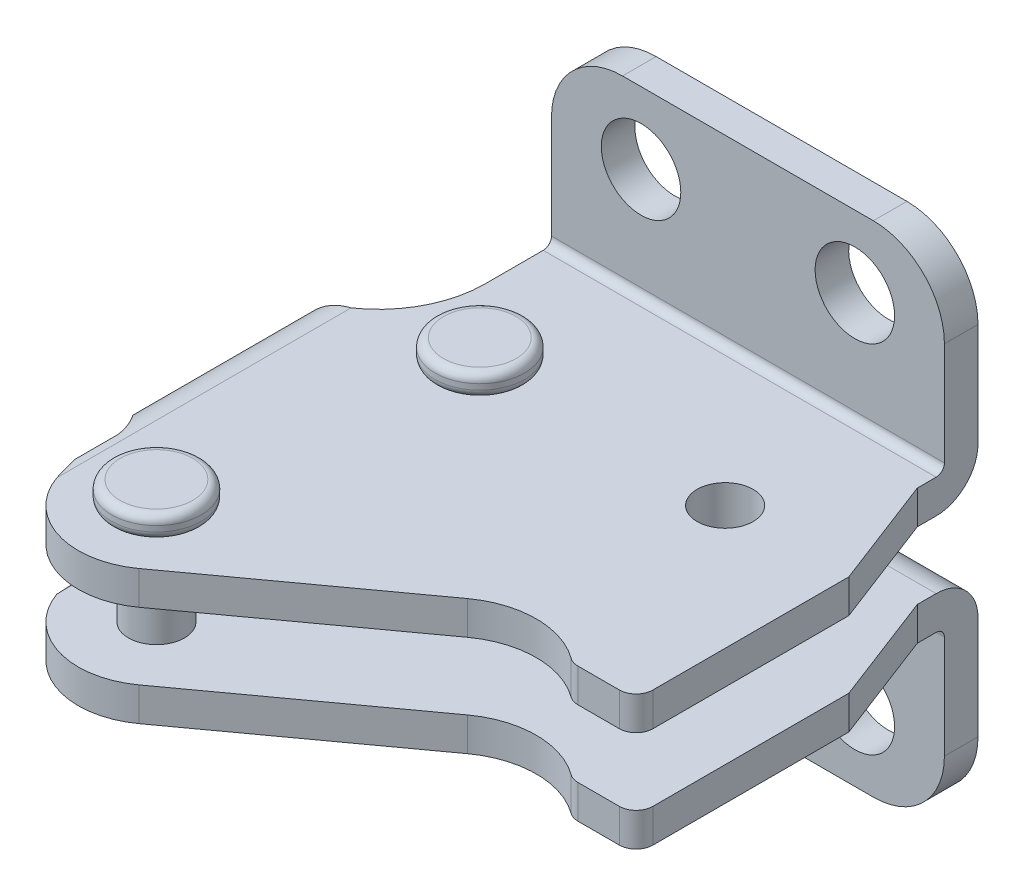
ISO-10303-21;
HEADER;
FILE_DESCRIPTION(('STEP AP214'),'2;1');
FILE_NAME('part.step','',(''),(''),'','','');
FILE_SCHEMA(('AUTOMOTIVE_DESIGN { 1 0 10303 214 1 1 1 1 }'));
ENDSEC;
DATA;
#1=APPLICATION_CONTEXT('core data for automotive mechanical design processes');
#2=APPLICATION_PROTOCOL_DEFINITION('international standard','automotive_design',2000,#1);
#3=PRODUCT_CONTEXT('',#1,'mechanical');
#4=PRODUCT('Part','Part','',(#3));
#5=PRODUCT_RELATED_PRODUCT_CATEGORY('part','',(#4));
#6=PRODUCT_DEFINITION_FORMATION('','',#4);
#7=PRODUCT_DEFINITION_CONTEXT('part definition',#1,'design');
#8=PRODUCT_DEFINITION('design','',#6,#7);
#9=PRODUCT_DEFINITION_SHAPE('','',#8);
#10=(LENGTH_UNIT() NAMED_UNIT(*) SI_UNIT(.MILLI.,.METRE.));
#11=(NAMED_UNIT(*) PLANE_ANGLE_UNIT() SI_UNIT($,.RADIAN.));
#12=(NAMED_UNIT(*) SI_UNIT($,.STERADIAN.) SOLID_ANGLE_UNIT());
#13=UNCERTAINTY_MEASURE_WITH_UNIT(LENGTH_MEASURE(1.E-05),#10,'distance_accuracy_value','');
#14=(GEOMETRIC_REPRESENTATION_CONTEXT(3) GLOBAL_UNCERTAINTY_ASSIGNED_CONTEXT((#13)) GLOBAL_UNIT_ASSIGNED_CONTEXT((#10,
#11,#12)) REPRESENTATION_CONTEXT('',''));
#15=CARTESIAN_POINT('',(0.,0.,0.));
#16=DIRECTION('',(0.,0.,1.));
#17=DIRECTION('',(1.,0.,0.));
#18=AXIS2_PLACEMENT_3D('',#15,#16,#17);
#19=CARTESIAN_POINT('',(19.8624000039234,21.8957081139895,15.3516081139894));
#20=DIRECTION('',(0.,-1.,0.));
#21=DIRECTION('',(0.900994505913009,0.,0.433830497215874));
#22=AXIS2_PLACEMENT_3D('',#19,#20,#21);
#23=CYLINDRICAL_SURFACE('',#22,2.5);
#24=CARTESIAN_POINT('',(19.8624000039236,9.89570811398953,15.3516081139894));
#25=DIRECTION('',(0.,1.,0.));
#26=DIRECTION('',(-0.900994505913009,0.,-0.433830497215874));
#27=AXIS2_PLACEMENT_3D('',#24,#25,#26);
#28=CIRCLE('',#27,2.5);
#29=CARTESIAN_POINT('',(17.6099137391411,9.8957081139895,14.2670318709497));
#30=VERTEX_POINT('',#29);
#31=EDGE_CURVE('E2000',#30,#30,#28,.T.);
#32=ORIENTED_EDGE('',*,*,#31,.F.);
#33=EDGE_LOOP('',(#32));
#34=FACE_BOUND('',#33,.T.);
#35=CARTESIAN_POINT('',(19.8624000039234,21.9001154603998,15.3516081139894));
#36=DIRECTION('',(0.,1.,0.));
#37=DIRECTION('',(-1.,0.,0.));
#38=AXIS2_PLACEMENT_3D('',#35,#36,#37);
#39=CIRCLE('',#38,2.5);
#40=CARTESIAN_POINT('',(17.3624000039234,21.9001154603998,15.3516081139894));
#41=VERTEX_POINT('',#40);
#42=EDGE_CURVE('E1958',#41,#41,#39,.T.);
#43=ORIENTED_EDGE('',*,*,#42,.T.);
#44=EDGE_LOOP('',(#43));
#45=FACE_BOUND('',#44,.T.);
#46=ADVANCED_FACE('F14',(#34,#45),#23,.F.);
#47=CARTESIAN_POINT('',(19.8624000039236,9.89570811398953,15.3516081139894));
#48=DIRECTION('',(0.,1.,0.));
#49=DIRECTION('',(-0.900994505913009,0.,-0.433830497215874));
#50=AXIS2_PLACEMENT_3D('',#47,#48,#49);
#51=PLANE('',#50);
#52=ORIENTED_EDGE('',*,*,#31,.T.);
#53=EDGE_LOOP('',(#52));
#54=FACE_BOUND('',#53,.T.);
#55=CARTESIAN_POINT('',(-5.53759999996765,9.89570811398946,40.7516486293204));
#56=DIRECTION('',(0.,1.,0.));
#57=DIRECTION('',(-1.,0.,0.));
#58=AXIS2_PLACEMENT_3D('',#55,#56,#57);
#59=CIRCLE('',#58,3.25);
#60=CARTESIAN_POINT('',(-8.78759999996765,9.89570811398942,40.7516486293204));
#61=VERTEX_POINT('',#60);
#62=EDGE_CURVE('E2004',#61,#61,#59,.T.);
#63=ORIENTED_EDGE('',*,*,#62,.T.);
#64=EDGE_LOOP('',(#63));
#65=FACE_BOUND('',#64,.T.);
#66=CARTESIAN_POINT('',(-2.04999999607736,9.89570811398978,15.3516486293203));
#67=DIRECTION('',(0.,1.,0.));
#68=DIRECTION('',(-1.,0.,0.));
#69=AXIS2_PLACEMENT_3D('',#66,#67,#68);
#70=CIRCLE('',#69,3.25);
#71=CARTESIAN_POINT('',(-5.29999999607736,9.89570811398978,15.3516486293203));
#72=VERTEX_POINT('',#71);
#73=EDGE_CURVE('E1973',#72,#72,#70,.T.);
#74=ORIENTED_EDGE('',*,*,#73,.T.);
#75=EDGE_LOOP('',(#74));
#76=FACE_BOUND('',#75,.T.);
#77=DIRECTION('',(0.,0.,1.));
#78=VECTOR('',#77,1.);
#79=CARTESIAN_POINT('',(-8.00060000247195,9.89570811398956,8.93584225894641));
#80=LINE('',#79,#78);
#81=CARTESIAN_POINT('',(-8.00060000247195,9.89570811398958,3.74));
#82=VERTEX_POINT('',#81);
#83=CARTESIAN_POINT('',(-8.00060000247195,9.89570811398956,8.93584225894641));
#84=VERTEX_POINT('',#83);
#85=EDGE_CURVE('E598',#82,#84,#80,.T.);
#86=ORIENTED_EDGE('',*,*,#85,.F.);
#87=DIRECTION('',(1.,0.,0.));
#88=VECTOR('',#87,1.);
#89=CARTESIAN_POINT('',(-56.2966156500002,9.89570811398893,3.74));
#90=LINE('',#89,#88);
#91=CARTESIAN_POINT('',(27.1014,9.89570811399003,3.74));
#92=VERTEX_POINT('',#91);
#93=EDGE_CURVE('E41',#82,#92,#90,.T.);
#94=ORIENTED_EDGE('',*,*,#93,.T.);
#95=DIRECTION('',(0.,0.,-1.));
#96=VECTOR('',#95,1.);
#97=CARTESIAN_POINT('',(27.1014,9.89570811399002,5.42625929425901));
#98=LINE('',#97,#96);
#99=CARTESIAN_POINT('',(27.1014,9.89570811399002,5.42625929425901));
#100=VERTEX_POINT('',#99);
#101=EDGE_CURVE('E464',#100,#92,#98,.T.);
#102=ORIENTED_EDGE('',*,*,#101,.F.);
#103=DIRECTION('',(-0.358367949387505,0.,-0.933580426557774));
#104=VECTOR('',#103,1.);
#105=CARTESIAN_POINT('',(30.9114000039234,9.89570811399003,15.3516486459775));
#106=LINE('',#105,#104);
#107=CARTESIAN_POINT('',(30.9114000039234,9.89570811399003,15.3516486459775));
#108=VERTEX_POINT('',#107);
#109=EDGE_CURVE('E589',#108,#100,#106,.T.);
#110=ORIENTED_EDGE('',*,*,#109,.F.);
#111=DIRECTION('',(0.,0.,-1.));
#112=VECTOR('',#111,1.);
#113=CARTESIAN_POINT('',(30.9114000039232,9.89570811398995,32.8496486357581));
#114=LINE('',#113,#112);
#115=CARTESIAN_POINT('',(30.9114000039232,9.89570811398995,32.8496486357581));
#116=VERTEX_POINT('',#115);
#117=EDGE_CURVE('E431',#116,#108,#114,.T.);
#118=ORIENTED_EDGE('',*,*,#117,.F.);
#119=CARTESIAN_POINT('',(29.4114000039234,9.89570811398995,32.8496486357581));
#120=DIRECTION('',(0.,1.,0.));
#121=DIRECTION('',(-1.,0.,0.));
#122=AXIS2_PLACEMENT_3D('',#119,#120,#121);
#123=CIRCLE('',#122,1.49999999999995);
#124=CARTESIAN_POINT('',(29.4114000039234,9.89570811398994,34.3496486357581));
#125=VERTEX_POINT('',#124);
#126=EDGE_CURVE('E428',#125,#116,#123,.T.);
#127=ORIENTED_EDGE('',*,*,#126,.F.);
#128=DIRECTION('',(1.,0.,0.));
#129=VECTOR('',#128,1.);
#130=CARTESIAN_POINT('',(29.4114000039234,9.89570811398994,34.3496486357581));
#131=LINE('',#130,#129);
#132=CARTESIAN_POINT('',(25.7083358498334,9.89570811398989,34.3496486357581));
#133=VERTEX_POINT('',#132);
#134=EDGE_CURVE('E523',#133,#125,#131,.T.);
#135=ORIENTED_EDGE('',*,*,#134,.F.);
#136=CARTESIAN_POINT('',(25.7083358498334,9.8957081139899,32.8496486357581));
#137=DIRECTION('',(0.,1.,0.));
#138=DIRECTION('',(-1.,0.,0.));
#139=AXIS2_PLACEMENT_3D('',#136,#137,#138);
#140=CIRCLE('',#139,1.49999999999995);
#141=CARTESIAN_POINT('',(24.8251924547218,9.89570811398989,34.0621080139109));
#142=VERTEX_POINT('',#141);
#143=EDGE_CURVE('E524',#142,#133,#140,.T.);
#144=ORIENTED_EDGE('',*,*,#143,.F.);
#145=CARTESIAN_POINT('',(20.1892783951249,9.89570811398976,40.4267114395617));
#146=DIRECTION('',(0.,-1.,0.));
#147=DIRECTION('',(-1.,0.,0.));
#148=AXIS2_PLACEMENT_3D('',#145,#146,#147);
#149=CIRCLE('',#148,7.8739999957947);
#150=CARTESIAN_POINT('',(15.5610573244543,9.89570811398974,34.056511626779));
#151=VERTEX_POINT('',#150);
#152=EDGE_CURVE('E480',#151,#142,#149,.T.);
#153=ORIENTED_EDGE('',*,*,#152,.F.);
#154=DIRECTION('',(0.809016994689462,0.,-0.587785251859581));
#155=VECTOR('',#154,1.);
#156=CARTESIAN_POINT('',(-1.4319200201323,9.89570811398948,46.4026323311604));
#157=LINE('',#156,#155);
#158=CARTESIAN_POINT('',(-1.4319200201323,9.89570811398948,46.4026323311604));
#159=VERTEX_POINT('',#158);
#160=EDGE_CURVE('E1410',#159,#151,#157,.T.);
#161=ORIENTED_EDGE('',*,*,#160,.F.);
#162=CARTESIAN_POINT('',(-5.53759999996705,9.89570811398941,40.7516486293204));
#163=DIRECTION('',(0.,1.,0.));
#164=DIRECTION('',(-1.,0.,0.));
#165=AXIS2_PLACEMENT_3D('',#162,#163,#164);
#166=CIRCLE('',#165,6.98499999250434);
#167=CARTESIAN_POINT('',(-12.1288114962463,9.89570811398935,43.0638242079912));
#168=VERTEX_POINT('',#167);
#169=EDGE_CURVE('E514',#168,#159,#166,.T.);
#170=ORIENTED_EDGE('',*,*,#169,.F.);
#171=DIRECTION('',(0.,0.,1.));
#172=VECTOR('',#171,1.);
#173=CARTESIAN_POINT('',(-12.1288114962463,9.89570811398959,-8.98429188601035));
#174=LINE('',#173,#172);
#175=CARTESIAN_POINT('',(-12.1288114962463,9.89570811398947,16.7712674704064));
#176=VERTEX_POINT('',#175);
#177=EDGE_CURVE('E618',#176,#168,#174,.T.);
#178=ORIENTED_EDGE('',*,*,#177,.F.);
#179=CARTESIAN_POINT('',(-17.500600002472,9.89570811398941,8.93584225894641));
#180=DIRECTION('',(0.,-1.,0.));
#181=DIRECTION('',(-1.,0.,0.));
#182=AXIS2_PLACEMENT_3D('',#179,#180,#181);
#183=CIRCLE('',#182,9.5);
#184=EDGE_CURVE('E515',#84,#176,#183,.T.);
#185=ORIENTED_EDGE('',*,*,#184,.F.);
#186=EDGE_LOOP('',(#86,#94,#102,#110,#118,#127,#135,#144,#153,#161,#170,#178,#185));
#187=FACE_BOUND('',#186,.T.);
#188=ADVANCED_FACE('F905',(#54,#65,#76,#187),#51,.F.);
#189=CARTESIAN_POINT('',(19.8624000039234,21.8957081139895,15.3516081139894));
#190=DIRECTION('',(0.,-1.,0.));
#191=DIRECTION('',(0.900994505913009,0.,0.433830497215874));
#192=AXIS2_PLACEMENT_3D('',#189,#190,#191);
#193=CYLINDRICAL_SURFACE('',#192,4.);
#194=CARTESIAN_POINT('',(19.8624000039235,12.8957081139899,15.3516081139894));
#195=DIRECTION('',(0.,1.,0.));
#196=DIRECTION('',(-1.,0.,0.));
#197=AXIS2_PLACEMENT_3D('',#194,#195,#196);
#198=CIRCLE('',#197,4.);
#199=CARTESIAN_POINT('',(15.8624000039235,12.8957081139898,15.3516081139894));
#200=VERTEX_POINT('',#199);
#201=EDGE_CURVE('E9',#200,#200,#198,.F.);
#202=ORIENTED_EDGE('',*,*,#201,.F.);
#203=EDGE_LOOP('',(#202));
#204=FACE_BOUND('',#203,.T.);
#205=CARTESIAN_POINT('',(19.8624000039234,18.9001154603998,15.3516081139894));
#206=DIRECTION('',(0.,-1.,0.));
#207=DIRECTION('',(1.,0.,0.));
#208=AXIS2_PLACEMENT_3D('',#205,#206,#207);
#209=CIRCLE('',#208,4.);
#210=CARTESIAN_POINT('',(23.8624000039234,18.9001154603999,15.3516081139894));
#211=VERTEX_POINT('',#210);
#212=EDGE_CURVE('E27',#211,#211,#209,.F.);
#213=ORIENTED_EDGE('',*,*,#212,.F.);
#214=EDGE_LOOP('',(#213));
#215=FACE_BOUND('',#214,.T.);
#216=ADVANCED_FACE('F893',(#204,#215),#193,.T.);
#217=CARTESIAN_POINT('',(-2.04999999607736,23.9357081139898,15.3516486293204));
#218=DIRECTION('',(0.,1.,0.));
#219=DIRECTION('',(-1.,0.,0.));
#220=AXIS2_PLACEMENT_3D('',#217,#218,#219);
#221=PLANE('',#220);
#222=CARTESIAN_POINT('',(-2.04999999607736,23.9357081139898,15.3516486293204));
#223=DIRECTION('',(0.,1.,0.));
#224=DIRECTION('',(-1.,0.,0.));
#225=AXIS2_PLACEMENT_3D('',#222,#223,#224);
#226=CIRCLE('',#225,3.25);
#227=CARTESIAN_POINT('',(-5.29999999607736,23.9357081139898,15.3516486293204));
#228=VERTEX_POINT('',#227);
#229=EDGE_CURVE('E467',#228,#228,#226,.T.);
#230=ORIENTED_EDGE('',*,*,#229,.T.);
#231=EDGE_LOOP('',(#230));
#232=FACE_BOUND('',#231,.T.);
#233=ADVANCED_FACE('F890',(#232),#221,.T.);
#234=CARTESIAN_POINT('',(-5.53759999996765,23.9179117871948,31.8102272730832));
#235=DIRECTION('',(0.,1.,0.));
#236=DIRECTION('',(-1.,0.,0.));
#237=AXIS2_PLACEMENT_3D('',#234,#235,#236);
#238=PLANE('',#237);
#239=CARTESIAN_POINT('',(-5.53759999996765,23.9179117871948,40.7516486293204));
#240=DIRECTION('',(0.,1.,0.));
#241=DIRECTION('',(-1.,0.,0.));
#242=AXIS2_PLACEMENT_3D('',#239,#240,#241);
#243=CIRCLE('',#242,3.25);
#244=CARTESIAN_POINT('',(-8.78759999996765,23.9179117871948,40.7516486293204));
#245=VERTEX_POINT('',#244);
#246=EDGE_CURVE('E1962',#245,#245,#243,.T.);
#247=ORIENTED_EDGE('',*,*,#246,.T.);
#248=EDGE_LOOP('',(#247));
#249=FACE_BOUND('',#248,.T.);
#250=ADVANCED_FACE('F892',(#249),#238,.T.);
#251=CARTESIAN_POINT('',(-2.04999999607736,23.1857081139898,15.3516486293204));
#252=DIRECTION('',(0.,1.,0.));
#253=DIRECTION('',(-1.,0.,0.));
#254=AXIS2_PLACEMENT_3D('',#251,#252,#253);
#255=TOROIDAL_SURFACE('',#254,3.25,0.75);
#256=ORIENTED_EDGE('',*,*,#229,.F.);
#257=EDGE_LOOP('',(#256));
#258=FACE_BOUND('',#257,.T.);
#259=CARTESIAN_POINT('',(-2.04999999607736,23.1857081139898,15.3516486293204));
#260=DIRECTION('',(0.,-1.,0.));
#261=DIRECTION('',(-1.,0.,0.));
#262=AXIS2_PLACEMENT_3D('',#259,#260,#261);
#263=CIRCLE('',#262,4.);
#264=CARTESIAN_POINT('',(-6.04999999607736,23.1857081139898,15.3516486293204));
#265=VERTEX_POINT('',#264);
#266=EDGE_CURVE('E1969',#265,#265,#263,.T.);
#267=ORIENTED_EDGE('',*,*,#266,.F.);
#268=EDGE_LOOP('',(#267));
#269=FACE_BOUND('',#268,.T.);
#270=ADVANCED_FACE('F901',(#258,#269),#255,.T.);
#271=CARTESIAN_POINT('',(-5.53759999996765,23.1679117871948,40.7516486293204));
#272=DIRECTION('',(0.,1.,0.));
#273=DIRECTION('',(-1.,0.,0.));
#274=AXIS2_PLACEMENT_3D('',#271,#272,#273);
#275=TOROIDAL_SURFACE('',#274,3.25,0.75);
#276=ORIENTED_EDGE('',*,*,#246,.F.);
#277=EDGE_LOOP('',(#276));
#278=FACE_BOUND('',#277,.T.);
#279=CARTESIAN_POINT('',(-5.53759999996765,23.1679117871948,40.7516486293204));
#280=DIRECTION('',(0.,-1.,0.));
#281=DIRECTION('',(-1.,0.,0.));
#282=AXIS2_PLACEMENT_3D('',#279,#280,#281);
#283=CIRCLE('',#282,4.);
#284=CARTESIAN_POINT('',(-9.53759999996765,23.1679117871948,40.7516486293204));
#285=VERTEX_POINT('',#284);
#286=EDGE_CURVE('E2030',#285,#285,#283,.T.);
#287=ORIENTED_EDGE('',*,*,#286,.F.);
#288=EDGE_LOOP('',(#287));
#289=FACE_BOUND('',#288,.T.);
#290=ADVANCED_FACE('F904',(#278,#289),#275,.T.);
#291=CARTESIAN_POINT('',(-5.53759999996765,7.8779117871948,31.8102272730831));
#292=DIRECTION('',(0.,1.,0.));
#293=DIRECTION('',(-1.,0.,0.));
#294=AXIS2_PLACEMENT_3D('',#291,#292,#293);
#295=PLANE('',#294);
#296=CARTESIAN_POINT('',(-5.53759999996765,7.87791178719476,40.7516486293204));
#297=DIRECTION('',(0.,-1.,0.));
#298=DIRECTION('',(-1.,0.,0.));
#299=AXIS2_PLACEMENT_3D('',#296,#297,#298);
#300=CIRCLE('',#299,3.25);
#301=CARTESIAN_POINT('',(-8.78759999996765,7.87791178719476,40.7516486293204));
#302=VERTEX_POINT('',#301);
#303=EDGE_CURVE('E2015',#302,#302,#300,.T.);
#304=ORIENTED_EDGE('',*,*,#303,.T.);
#305=EDGE_LOOP('',(#304));
#306=FACE_BOUND('',#305,.T.);
#307=ADVANCED_FACE('F922',(#306),#295,.F.);
#308=CARTESIAN_POINT('',(-2.04999999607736,23.9357081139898,15.3516486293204));
#309=DIRECTION('',(0.,-1.,0.));
#310=DIRECTION('',(1.,0.,0.));
#311=AXIS2_PLACEMENT_3D('',#308,#309,#310);
#312=CYLINDRICAL_SURFACE('',#311,4.);
#313=CARTESIAN_POINT('',(-2.04999999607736,22.6857081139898,15.3516486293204));
#314=DIRECTION('',(0.,1.,0.));
#315=DIRECTION('',(-1.,0.,0.));
#316=AXIS2_PLACEMENT_3D('',#313,#314,#315);
#317=CIRCLE('',#316,4.);
#318=CARTESIAN_POINT('',(-6.04999999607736,22.6857081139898,15.3516486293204));
#319=VERTEX_POINT('',#318);
#320=EDGE_CURVE('E1979',#319,#319,#317,.T.);
#321=ORIENTED_EDGE('',*,*,#320,.T.);
#322=EDGE_LOOP('',(#321));
#323=FACE_BOUND('',#322,.T.);
#324=ORIENTED_EDGE('',*,*,#266,.T.);
#325=EDGE_LOOP('',(#324));
#326=FACE_BOUND('',#325,.T.);
#327=ADVANCED_FACE('F923',(#323,#326),#312,.T.);
#328=CARTESIAN_POINT('',(-5.53759999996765,21.9179117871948,40.7516486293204));
#329=DIRECTION('',(0.,1.,0.));
#330=DIRECTION('',(-1.,0.,0.));
#331=AXIS2_PLACEMENT_3D('',#328,#329,#330);
#332=CYLINDRICAL_SURFACE('',#331,4.);
#333=ORIENTED_EDGE('',*,*,#286,.T.);
#334=EDGE_LOOP('',(#333));
#335=FACE_BOUND('',#334,.T.);
#336=CARTESIAN_POINT('',(-5.53759999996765,22.6679117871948,40.7516486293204));
#337=DIRECTION('',(0.,1.,0.));
#338=DIRECTION('',(1.,0.,0.));
#339=AXIS2_PLACEMENT_3D('',#336,#337,#338);
#340=CIRCLE('',#339,4.);
#341=CARTESIAN_POINT('',(-1.53759999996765,22.6679117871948,40.7516486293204));
#342=VERTEX_POINT('',#341);
#343=EDGE_CURVE('E2010',#342,#342,#340,.T.);
#344=ORIENTED_EDGE('',*,*,#343,.T.);
#345=EDGE_LOOP('',(#344));
#346=FACE_BOUND('',#345,.T.);
#347=ADVANCED_FACE('F913',(#335,#346),#332,.T.);
#348=CARTESIAN_POINT('',(-2.04999999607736,1.39570811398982,6.41022727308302));
#349=DIRECTION('',(0.,1.,0.));
#350=DIRECTION('',(-1.,0.,0.));
#351=AXIS2_PLACEMENT_3D('',#348,#349,#350);
#352=PLANE('',#351);
#353=CARTESIAN_POINT('',(-2.04999999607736,1.39570811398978,15.3516486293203));
#354=DIRECTION('',(0.,-1.,0.));
#355=DIRECTION('',(-1.,0.,0.));
#356=AXIS2_PLACEMENT_3D('',#353,#354,#355);
#357=CIRCLE('',#356,3.25);
#358=CARTESIAN_POINT('',(-5.29999999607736,1.39570811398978,15.3516486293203));
#359=VERTEX_POINT('',#358);
#360=EDGE_CURVE('E1970',#359,#359,#357,.T.);
#361=ORIENTED_EDGE('',*,*,#360,.T.);
#362=EDGE_LOOP('',(#361));
#363=FACE_BOUND('',#362,.T.);
#364=ADVANCED_FACE('F896',(#363),#352,.F.);
#365=CARTESIAN_POINT('',(-5.53759999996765,8.62791178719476,40.7516486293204));
#366=DIRECTION('',(0.,1.,0.));
#367=DIRECTION('',(-1.,0.,0.));
#368=AXIS2_PLACEMENT_3D('',#365,#366,#367);
#369=TOROIDAL_SURFACE('',#368,3.25,0.75);
#370=CARTESIAN_POINT('',(-5.53759999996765,8.62791178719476,40.7516486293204));
#371=DIRECTION('',(0.,1.,0.));
#372=DIRECTION('',(-1.,0.,0.));
#373=AXIS2_PLACEMENT_3D('',#370,#371,#372);
#374=CIRCLE('',#373,4.);
#375=CARTESIAN_POINT('',(-9.53759999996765,8.62791178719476,40.7516486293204));
#376=VERTEX_POINT('',#375);
#377=EDGE_CURVE('E2022',#376,#376,#374,.T.);
#378=ORIENTED_EDGE('',*,*,#377,.F.);
#379=EDGE_LOOP('',(#378));
#380=FACE_BOUND('',#379,.T.);
#381=ORIENTED_EDGE('',*,*,#303,.F.);
#382=EDGE_LOOP('',(#381));
#383=FACE_BOUND('',#382,.T.);
#384=ADVANCED_FACE('F912',(#380,#383),#369,.T.);
#385=CARTESIAN_POINT('',(19.0999999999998,31.7958235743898,-9.00440734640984));
#386=DIRECTION('',(0.,0.,-1.));
#387=DIRECTION('',(1.,0.,0.));
#388=AXIS2_PLACEMENT_3D('',#385,#386,#387);
#389=CYLINDRICAL_SURFACE('',#388,3.55);
#390=CARTESIAN_POINT('',(19.0999999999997,31.7958235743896,0.));
#391=DIRECTION('',(0.,0.,-1.));
#392=DIRECTION('',(0.,1.,0.));
#393=AXIS2_PLACEMENT_3D('',#390,#391,#392);
#394=CIRCLE('',#393,3.55);
#395=CARTESIAN_POINT('',(19.0999999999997,35.3458235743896,0.));
#396=VERTEX_POINT('',#395);
#397=EDGE_CURVE('E1947',#396,#396,#394,.F.);
#398=ORIENTED_EDGE('',*,*,#397,.F.);
#399=EDGE_LOOP('',(#398));
#400=FACE_BOUND('',#399,.T.);
#401=CARTESIAN_POINT('',(19.0999999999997,31.7958235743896,3.00000000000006));
#402=DIRECTION('',(0.,0.,1.));
#403=DIRECTION('',(0.,-1.,0.));
#404=AXIS2_PLACEMENT_3D('',#401,#402,#403);
#405=CIRCLE('',#404,3.55);
#406=CARTESIAN_POINT('',(19.0999999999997,28.2458235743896,3.00000000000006));
#407=VERTEX_POINT('',#406);
#408=EDGE_CURVE('E1950',#407,#407,#405,.T.);
#409=ORIENTED_EDGE('',*,*,#408,.T.);
#410=EDGE_LOOP('',(#409));
#411=FACE_BOUND('',#410,.T.);
#412=ADVANCED_FACE('F919',(#400,#411),#389,.F.);
#413=CARTESIAN_POINT('',(-2.60208521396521E-13,31.7958235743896,-9.00440734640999));
#414=DIRECTION('',(0.,0.,-1.));
#415=DIRECTION('',(1.,0.,0.));
#416=AXIS2_PLACEMENT_3D('',#413,#414,#415);
#417=CYLINDRICAL_SURFACE('',#416,3.55);
#418=CARTESIAN_POINT('',(-3.00107161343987E-13,31.7958235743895,0.));
#419=DIRECTION('',(0.,0.,-1.));
#420=DIRECTION('',(0.,1.,0.));
#421=AXIS2_PLACEMENT_3D('',#418,#419,#420);
#422=CIRCLE('',#421,3.55);
#423=CARTESIAN_POINT('',(-3.35607161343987E-13,35.3458235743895,0.));
#424=VERTEX_POINT('',#423);
#425=EDGE_CURVE('E1941',#424,#424,#422,.F.);
#426=ORIENTED_EDGE('',*,*,#425,.F.);
#427=EDGE_LOOP('',(#426));
#428=FACE_BOUND('',#427,.T.);
#429=CARTESIAN_POINT('',(-3.00107161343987E-13,31.7958235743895,3.00000000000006));
#430=DIRECTION('',(0.,0.,1.));
#431=DIRECTION('',(0.,-1.,0.));
#432=AXIS2_PLACEMENT_3D('',#429,#430,#431);
#433=CIRCLE('',#432,3.55);
#434=CARTESIAN_POINT('',(-2.64607161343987E-13,28.2458235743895,3.00000000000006));
#435=VERTEX_POINT('',#434);
#436=EDGE_CURVE('E1944',#435,#435,#433,.T.);
#437=ORIENTED_EDGE('',*,*,#436,.T.);
#438=EDGE_LOOP('',(#437));
#439=FACE_BOUND('',#438,.T.);
#440=ADVANCED_FACE('F961',(#428,#439),#417,.F.);
#441=CARTESIAN_POINT('',(20.7514000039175,31.8458235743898,1.26634813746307E-13));
#442=DIRECTION('',(0.,0.,1.));
#443=DIRECTION('',(-1.,0.,0.));
#444=AXIS2_PLACEMENT_3D('',#441,#442,#443);
#445=CYLINDRICAL_SURFACE('',#444,6.35);
#446=CARTESIAN_POINT('',(20.7514000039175,31.8458235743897,3.00000000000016));
#447=DIRECTION('',(0.,0.,-1.));
#448=DIRECTION('',(1.,0.,0.));
#449=AXIS2_PLACEMENT_3D('',#446,#447,#448);
#450=CIRCLE('',#449,6.35);
#451=CARTESIAN_POINT('',(20.7514000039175,38.1958235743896,3.00000000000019));
#452=VERTEX_POINT('',#451);
#453=CARTESIAN_POINT('',(27.1014000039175,31.8458235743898,3.00000000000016));
#454=VERTEX_POINT('',#453);
#455=EDGE_CURVE('E592',#452,#454,#450,.T.);
#456=ORIENTED_EDGE('',*,*,#455,.T.);
#457=DIRECTION('',(0.,0.,1.));
#458=VECTOR('',#457,1.);
#459=CARTESIAN_POINT('',(27.1014000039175,31.8458235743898,1.26634813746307E-13));
#460=LINE('',#459,#458);
#461=CARTESIAN_POINT('',(27.1014000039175,31.8458235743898,1.26634813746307E-13));
#462=VERTEX_POINT('',#461);
#463=EDGE_CURVE('E623',#462,#454,#460,.T.);
#464=ORIENTED_EDGE('',*,*,#463,.F.);
#465=CARTESIAN_POINT('',(20.7514000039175,31.8458235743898,1.26634813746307E-13));
#466=DIRECTION('',(0.,0.,-1.));
#467=DIRECTION('',(1.,0.,0.));
#468=AXIS2_PLACEMENT_3D('',#465,#466,#467);
#469=CIRCLE('',#468,6.35);
#470=CARTESIAN_POINT('',(20.7514000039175,38.1958235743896,1.76941794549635E-13));
#471=VERTEX_POINT('',#470);
#472=EDGE_CURVE('E1315',#471,#462,#469,.T.);
#473=ORIENTED_EDGE('',*,*,#472,.F.);
#474=DIRECTION('',(0.,0.,1.));
#475=VECTOR('',#474,1.);
#476=CARTESIAN_POINT('',(20.7514000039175,38.1958235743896,1.76941794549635E-13));
#477=LINE('',#476,#475);
#478=EDGE_CURVE('E1285',#471,#452,#477,.T.);
#479=ORIENTED_EDGE('',*,*,#478,.T.);
#480=EDGE_LOOP('',(#456,#464,#473,#479));
#481=FACE_BOUND('',#480,.T.);
#482=ADVANCED_FACE('F964',(#481),#445,.T.);
#483=CARTESIAN_POINT('',(-1.65060000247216,38.1958235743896,1.76941794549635E-13));
#484=DIRECTION('',(0.,-1.,0.));
#485=DIRECTION('',(0.,0.,1.));
#486=AXIS2_PLACEMENT_3D('',#483,#484,#485);
#487=PLANE('',#486);
#488=DIRECTION('',(1.,0.,0.));
#489=VECTOR('',#488,1.);
#490=CARTESIAN_POINT('',(-1.65060000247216,38.1958235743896,3.00000000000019));
#491=LINE('',#490,#489);
#492=CARTESIAN_POINT('',(-1.65060000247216,38.1958235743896,3.00000000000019));
#493=VERTEX_POINT('',#492);
#494=EDGE_CURVE('E610',#493,#452,#491,.T.);
#495=ORIENTED_EDGE('',*,*,#494,.T.);
#496=ORIENTED_EDGE('',*,*,#478,.F.);
#497=DIRECTION('',(1.,0.,0.));
#498=VECTOR('',#497,1.);
#499=CARTESIAN_POINT('',(-1.65060000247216,38.1958235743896,1.76941794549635E-13));
#500=LINE('',#499,#498);
#501=CARTESIAN_POINT('',(-1.65060000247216,38.1958235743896,1.76941794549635E-13));
#502=VERTEX_POINT('',#501);
#503=EDGE_CURVE('E1311',#502,#471,#500,.T.);
#504=ORIENTED_EDGE('',*,*,#503,.F.);
#505=DIRECTION('',(0.,0.,1.));
#506=VECTOR('',#505,1.);
#507=CARTESIAN_POINT('',(-1.65060000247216,38.1958235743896,1.76941794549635E-13));
#508=LINE('',#507,#506);
#509=EDGE_CURVE('E607',#502,#493,#508,.T.);
#510=ORIENTED_EDGE('',*,*,#509,.T.);
#511=EDGE_LOOP('',(#495,#496,#504,#510));
#512=FACE_BOUND('',#511,.T.);
#513=ADVANCED_FACE('F1583',(#512),#487,.F.);
#514=CARTESIAN_POINT('',(-1.65060000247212,31.8458235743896,1.26634813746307E-13));
#515=DIRECTION('',(0.,0.,1.));
#516=DIRECTION('',(-1.,0.,0.));
#517=AXIS2_PLACEMENT_3D('',#514,#515,#516);
#518=CYLINDRICAL_SURFACE('',#517,6.35);
#519=CARTESIAN_POINT('',(-1.65060000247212,31.8458235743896,3.00000000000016));
#520=DIRECTION('',(0.,0.,-1.));
#521=DIRECTION('',(1.,0.,0.));
#522=AXIS2_PLACEMENT_3D('',#519,#520,#521);
#523=CIRCLE('',#522,6.35);
#524=CARTESIAN_POINT('',(-8.00060000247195,31.8458235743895,3.00000000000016));
#525=VERTEX_POINT('',#524);
#526=EDGE_CURVE('E491',#525,#493,#523,.T.);
#527=ORIENTED_EDGE('',*,*,#526,.T.);
#528=ORIENTED_EDGE('',*,*,#509,.F.);
#529=CARTESIAN_POINT('',(-1.65060000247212,31.8458235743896,1.26634813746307E-13));
#530=DIRECTION('',(0.,0.,-1.));
#531=DIRECTION('',(1.,0.,0.));
#532=AXIS2_PLACEMENT_3D('',#529,#530,#531);
#533=CIRCLE('',#532,6.35);
#534=CARTESIAN_POINT('',(-8.00060000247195,31.8458235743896,1.26634813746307E-13));
#535=VERTEX_POINT('',#534);
#536=EDGE_CURVE('E446',#535,#502,#533,.T.);
#537=ORIENTED_EDGE('',*,*,#536,.F.);
#538=DIRECTION('',(0.,0.,1.));
#539=VECTOR('',#538,1.);
#540=CARTESIAN_POINT('',(-8.00060000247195,31.8458235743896,1.26634813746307E-13));
#541=LINE('',#540,#539);
#542=EDGE_CURVE('E488',#535,#525,#541,.T.);
#543=ORIENTED_EDGE('',*,*,#542,.T.);
#544=EDGE_LOOP('',(#527,#528,#537,#543));
#545=FACE_BOUND('',#544,.T.);
#546=ADVANCED_FACE('F668',(#545),#518,.T.);
#547=CARTESIAN_POINT('',(27.1014000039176,17.4352723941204,0.));
#548=DIRECTION('',(-1.,0.,0.));
#549=DIRECTION('',(0.,0.,-1.));
#550=AXIS2_PLACEMENT_3D('',#547,#548,#549);
#551=PLANE('',#550);
#552=DIRECTION('',(0.,-1.,0.));
#553=VECTOR('',#552,1.);
#554=CARTESIAN_POINT('',(27.1014000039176,17.4352723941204,3.00000000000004));
#555=LINE('',#554,#553);
#556=CARTESIAN_POINT('',(27.1014000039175,22.6401154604,3.00000000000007));
#557=VERTEX_POINT('',#556);
#558=EDGE_CURVE('E627',#454,#557,#555,.T.);
#559=ORIENTED_EDGE('',*,*,#558,.T.);
#560=CARTESIAN_POINT('',(27.1014000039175,22.6401154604,3.74000000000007));
#561=DIRECTION('',(-1.,0.,0.));
#562=DIRECTION('',(0.,1.,0.));
#563=AXIS2_PLACEMENT_3D('',#560,#561,#562);
#564=CIRCLE('',#563,0.74);
#565=CARTESIAN_POINT('',(27.1014000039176,21.9001154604,3.74000000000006));
#566=VERTEX_POINT('',#565);
#567=EDGE_CURVE('E505',#557,#566,#564,.T.);
#568=ORIENTED_EDGE('',*,*,#567,.T.);
#569=DIRECTION('',(0.,0.,1.));
#570=VECTOR('',#569,1.);
#571=CARTESIAN_POINT('',(27.1014000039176,21.9001154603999,5.42625929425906));
#572=LINE('',#571,#570);
#573=CARTESIAN_POINT('',(27.1014000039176,21.9001154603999,5.42625929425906));
#574=VERTEX_POINT('',#573);
#575=EDGE_CURVE('E1404',#566,#574,#572,.T.);
#576=ORIENTED_EDGE('',*,*,#575,.T.);
#577=DIRECTION('',(0.,1.,0.));
#578=VECTOR('',#577,1.);
#579=CARTESIAN_POINT('',(27.1014000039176,18.9001154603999,5.42625929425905));
#580=LINE('',#579,#578);
#581=CARTESIAN_POINT('',(27.1014000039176,18.9001154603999,5.42625929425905));
#582=VERTEX_POINT('',#581);
#583=EDGE_CURVE('E479',#582,#574,#580,.T.);
#584=ORIENTED_EDGE('',*,*,#583,.F.);
#585=DIRECTION('',(0.,0.,1.));
#586=VECTOR('',#585,1.);
#587=CARTESIAN_POINT('',(27.1014000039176,18.9001154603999,5.42625929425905));
#588=LINE('',#587,#586);
#589=CARTESIAN_POINT('',(27.1014000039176,18.9001154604,3.74000000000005));
#590=VERTEX_POINT('',#589);
#591=EDGE_CURVE('E622',#590,#582,#588,.T.);
#592=ORIENTED_EDGE('',*,*,#591,.F.);
#593=CARTESIAN_POINT('',(27.1014000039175,22.6401154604,3.74000000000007));
#594=DIRECTION('',(-1.,0.,0.));
#595=DIRECTION('',(0.,-1.,0.));
#596=AXIS2_PLACEMENT_3D('',#593,#594,#595);
#597=CIRCLE('',#596,3.74);
#598=CARTESIAN_POINT('',(27.1014000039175,22.6401154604,0.));
#599=VERTEX_POINT('',#598);
#600=EDGE_CURVE('E554',#599,#590,#597,.T.);
#601=ORIENTED_EDGE('',*,*,#600,.F.);
#602=DIRECTION('',(0.,-1.,0.));
#603=VECTOR('',#602,1.);
#604=CARTESIAN_POINT('',(27.1014000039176,17.4352723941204,0.));
#605=LINE('',#604,#603);
#606=EDGE_CURVE('E492',#462,#599,#605,.T.);
#607=ORIENTED_EDGE('',*,*,#606,.F.);
#608=ORIENTED_EDGE('',*,*,#463,.T.);
#609=EDGE_LOOP('',(#559,#568,#576,#584,#592,#601,#607,#608));
#610=FACE_BOUND('',#609,.T.);
#611=ADVANCED_FACE('F1603',(#610),#551,.F.);
#612=CARTESIAN_POINT('',(-8.00060000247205,13.9256894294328,0.));
#613=DIRECTION('',(1.,0.,0.));
#614=DIRECTION('',(0.,1.,0.));
#615=AXIS2_PLACEMENT_3D('',#612,#613,#614);
#616=PLANE('',#615);
#617=DIRECTION('',(0.,1.,0.));
#618=VECTOR('',#617,1.);
#619=CARTESIAN_POINT('',(-8.00060000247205,13.9256894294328,0.));
#620=LINE('',#619,#618);
#621=CARTESIAN_POINT('',(-8.0006000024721,22.6401154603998,0.));
#622=VERTEX_POINT('',#621);
#623=EDGE_CURVE('E531',#622,#535,#620,.T.);
#624=ORIENTED_EDGE('',*,*,#623,.F.);
#625=CARTESIAN_POINT('',(-8.0006000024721,22.6401154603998,3.74000000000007));
#626=DIRECTION('',(1.,0.,0.));
#627=DIRECTION('',(0.,1.,0.));
#628=AXIS2_PLACEMENT_3D('',#625,#626,#627);
#629=CIRCLE('',#628,3.74);
#630=CARTESIAN_POINT('',(-8.00060000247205,18.9001154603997,3.74000000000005));
#631=VERTEX_POINT('',#630);
#632=EDGE_CURVE('E558',#631,#622,#629,.T.);
#633=ORIENTED_EDGE('',*,*,#632,.F.);
#634=DIRECTION('',(0.,0.,-1.));
#635=VECTOR('',#634,1.);
#636=CARTESIAN_POINT('',(-8.00060000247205,18.9001154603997,8.93584225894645));
#637=LINE('',#636,#635);
#638=CARTESIAN_POINT('',(-8.00060000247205,18.9001154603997,8.93584225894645));
#639=VERTEX_POINT('',#638);
#640=EDGE_CURVE('E1248',#639,#631,#637,.T.);
#641=ORIENTED_EDGE('',*,*,#640,.F.);
#642=DIRECTION('',(0.,1.,0.));
#643=VECTOR('',#642,1.);
#644=CARTESIAN_POINT('',(-8.00060000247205,18.9001154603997,8.93584225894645));
#645=LINE('',#644,#643);
#646=CARTESIAN_POINT('',(-8.0006000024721,21.9001154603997,8.93584225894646));
#647=VERTEX_POINT('',#646);
#648=EDGE_CURVE('E549',#639,#647,#645,.T.);
#649=ORIENTED_EDGE('',*,*,#648,.T.);
#650=DIRECTION('',(0.,0.,-1.));
#651=VECTOR('',#650,1.);
#652=CARTESIAN_POINT('',(-8.0006000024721,21.9001154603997,8.93584225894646));
#653=LINE('',#652,#651);
#654=CARTESIAN_POINT('',(-8.0006000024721,21.9001154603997,3.74000000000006));
#655=VERTEX_POINT('',#654);
#656=EDGE_CURVE('E545',#647,#655,#653,.T.);
#657=ORIENTED_EDGE('',*,*,#656,.T.);
#658=CARTESIAN_POINT('',(-8.0006000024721,22.6401154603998,3.74000000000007));
#659=DIRECTION('',(1.,0.,0.));
#660=DIRECTION('',(0.,1.,0.));
#661=AXIS2_PLACEMENT_3D('',#658,#659,#660);
#662=CIRCLE('',#661,0.74);
#663=CARTESIAN_POINT('',(-8.0006000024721,22.6401154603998,3.00000000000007));
#664=VERTEX_POINT('',#663);
#665=EDGE_CURVE('E510',#655,#664,#662,.T.);
#666=ORIENTED_EDGE('',*,*,#665,.T.);
#667=DIRECTION('',(0.,1.,0.));
#668=VECTOR('',#667,1.);
#669=CARTESIAN_POINT('',(-8.00060000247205,13.9256894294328,3.));
#670=LINE('',#669,#668);
#671=EDGE_CURVE('E626',#664,#525,#670,.T.);
#672=ORIENTED_EDGE('',*,*,#671,.T.);
#673=ORIENTED_EDGE('',*,*,#542,.F.);
#674=EDGE_LOOP('',(#624,#633,#641,#649,#657,#666,#672,#673));
#675=FACE_BOUND('',#674,.T.);
#676=ADVANCED_FACE('F966',(#675),#616,.F.);
#677=CARTESIAN_POINT('',(20.7514000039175,31.8458235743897,3.00000000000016));
#678=DIRECTION('',(0.,0.,-1.));
#679=DIRECTION('',(-1.,0.,0.));
#680=AXIS2_PLACEMENT_3D('',#677,#678,#679);
#681=PLANE('',#680);
#682=DIRECTION('',(-1.,0.,0.));
#683=VECTOR('',#682,1.);
#684=CARTESIAN_POINT('',(20.7514000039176,22.6401154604,3.00000000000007));
#685=LINE('',#684,#683);
#686=EDGE_CURVE('E559',#557,#664,#685,.T.);
#687=ORIENTED_EDGE('',*,*,#686,.F.);
#688=ORIENTED_EDGE('',*,*,#558,.F.);
#689=ORIENTED_EDGE('',*,*,#455,.F.);
#690=ORIENTED_EDGE('',*,*,#494,.F.);
#691=ORIENTED_EDGE('',*,*,#526,.F.);
#692=ORIENTED_EDGE('',*,*,#671,.F.);
#693=EDGE_LOOP('',(#687,#688,#689,#690,#691,#692));
#694=FACE_BOUND('',#693,.T.);
#695=ORIENTED_EDGE('',*,*,#436,.F.);
#696=EDGE_LOOP('',(#695));
#697=FACE_BOUND('',#696,.T.);
#698=ORIENTED_EDGE('',*,*,#408,.F.);
#699=EDGE_LOOP('',(#698));
#700=FACE_BOUND('',#699,.T.);
#701=ADVANCED_FACE('F1595',(#694,#697,#700),#681,.F.);
#702=CARTESIAN_POINT('',(-2.04999999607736,22.6857081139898,15.3516486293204));
#703=DIRECTION('',(0.,1.,0.));
#704=DIRECTION('',(-1.,0.,0.));
#705=AXIS2_PLACEMENT_3D('',#702,#703,#704);
#706=TOROIDAL_SURFACE('',#705,3.25,0.75);
#707=ORIENTED_EDGE('',*,*,#320,.F.);
#708=EDGE_LOOP('',(#707));
#709=FACE_BOUND('',#708,.T.);
#710=CARTESIAN_POINT('',(-2.04999999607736,21.9357081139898,15.3516486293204));
#711=DIRECTION('',(0.,-1.,0.));
#712=DIRECTION('',(-1.,0.,0.));
#713=AXIS2_PLACEMENT_3D('',#710,#711,#712);
#714=CIRCLE('',#713,3.25);
#715=CARTESIAN_POINT('',(-5.29999999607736,21.9357081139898,15.3516486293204));
#716=VERTEX_POINT('',#715);
#717=EDGE_CURVE('E1974',#716,#716,#714,.T.);
#718=ORIENTED_EDGE('',*,*,#717,.F.);
#719=EDGE_LOOP('',(#718));
#720=FACE_BOUND('',#719,.T.);
#721=ADVANCED_FACE('F1783',(#709,#720),#706,.T.);
#722=CARTESIAN_POINT('',(-5.53759999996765,22.6679117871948,40.7516486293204));
#723=DIRECTION('',(0.,-1.,0.));
#724=DIRECTION('',(1.,0.,0.));
#725=AXIS2_PLACEMENT_3D('',#722,#723,#724);
#726=TOROIDAL_SURFACE('',#725,3.25,0.75);
#727=CARTESIAN_POINT('',(-5.53759999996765,21.9179117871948,40.7516486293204));
#728=DIRECTION('',(0.,-1.,0.));
#729=DIRECTION('',(1.,0.,0.));
#730=AXIS2_PLACEMENT_3D('',#727,#728,#729);
#731=CIRCLE('',#730,3.25);
#732=CARTESIAN_POINT('',(-2.28759999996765,21.9179117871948,40.7516486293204));
#733=VERTEX_POINT('',#732);
#734=EDGE_CURVE('E2011',#733,#733,#731,.T.);
#735=ORIENTED_EDGE('',*,*,#734,.F.);
#736=EDGE_LOOP('',(#735));
#737=FACE_BOUND('',#736,.T.);
#738=ORIENTED_EDGE('',*,*,#343,.F.);
#739=EDGE_LOOP('',(#738));
#740=FACE_BOUND('',#739,.T.);
#741=ADVANCED_FACE('F926',(#737,#740),#726,.T.);
#742=CARTESIAN_POINT('',(-12.6288114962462,15.6259039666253,8.93584225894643));
#743=DIRECTION('',(-1.,0.,0.));
#744=DIRECTION('',(0.,-1.,0.));
#745=AXIS2_PLACEMENT_3D('',#742,#743,#744);
#746=CYLINDRICAL_SURFACE('',#745,9.5);
#747=CARTESIAN_POINT('',(-12.6288114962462,15.6259039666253,8.93584225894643));
#748=DIRECTION('',(-1.,0.,0.));
#749=DIRECTION('',(0.,1.,0.));
#750=AXIS2_PLACEMENT_3D('',#747,#748,#749);
#751=CIRCLE('',#750,9.5);
#752=CARTESIAN_POINT('',(-12.6288114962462,13.3957081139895,18.1703550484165));
#753=VERTEX_POINT('',#752);
#754=CARTESIAN_POINT('',(-12.6288114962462,15.6259039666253,18.4358422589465));
#755=VERTEX_POINT('',#754);
#756=EDGE_CURVE('E563',#753,#755,#751,.T.);
#757=ORIENTED_EDGE('',*,*,#756,.F.);
#758=CARTESIAN_POINT('',(-12.6288114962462,13.3957081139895,18.1703550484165));
#759=CARTESIAN_POINT('',(-13.6288114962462,13.3957081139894,18.1703550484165));
#760=CARTESIAN_POINT('',(-14.6288114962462,13.3957081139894,18.1703550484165));
#761=CARTESIAN_POINT('',(-15.6288114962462,13.3957081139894,18.1703550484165));
#762=(BOUNDED_CURVE() B_SPLINE_CURVE(3,(#758,#759,#760,#761),.UNSPECIFIED.,.F.,
.F.) B_SPLINE_CURVE_WITH_KNOTS((4,4),(0.,1.),
.UNSPECIFIED.) CURVE() GEOMETRIC_REPRESENTATION_ITEM() RATIONAL_B_SPLINE_CURVE((1.,1.,1.,1.)) REPRESENTATION_ITEM(''));
#763=CARTESIAN_POINT('',(-15.6288114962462,13.3957081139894,18.1703550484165));
#764=VERTEX_POINT('',#763);
#765=EDGE_CURVE('E1484',#753,#764,#762,.T.);
#766=ORIENTED_EDGE('',*,*,#765,.T.);
#767=CARTESIAN_POINT('',(-15.6288114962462,15.6259039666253,8.93584225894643));
#768=DIRECTION('',(-1.,0.,0.));
#769=DIRECTION('',(0.,1.,0.));
#770=AXIS2_PLACEMENT_3D('',#767,#768,#769);
#771=CIRCLE('',#770,9.5);
#772=CARTESIAN_POINT('',(-15.6288114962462,15.6259039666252,18.4358422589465));
#773=VERTEX_POINT('',#772);
#774=EDGE_CURVE('E827',#764,#773,#771,.T.);
#775=ORIENTED_EDGE('',*,*,#774,.T.);
#776=DIRECTION('',(-1.,0.,0.));
#777=VECTOR('',#776,1.);
#778=CARTESIAN_POINT('',(-12.6288114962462,15.6259039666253,18.4358422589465));
#779=LINE('',#778,#777);
#780=EDGE_CURVE('E469',#755,#773,#779,.T.);
#781=ORIENTED_EDGE('',*,*,#780,.F.);
#782=EDGE_LOOP('',(#757,#766,#775,#781));
#783=FACE_BOUND('',#782,.T.);
#784=ADVANCED_FACE('F732',(#783),#746,.F.);
#785=CARTESIAN_POINT('',(-12.6288114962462,15.6259039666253,18.4358422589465));
#786=DIRECTION('',(0.,0.,1.));
#787=DIRECTION('',(0.,1.,0.));
#788=AXIS2_PLACEMENT_3D('',#785,#786,#787);
#789=PLANE('',#788);
#790=DIRECTION('',(0.,1.,0.));
#791=VECTOR('',#790,1.);
#792=CARTESIAN_POINT('',(-15.6288114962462,15.6259039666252,18.4358422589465));
#793=LINE('',#792,#791);
#794=CARTESIAN_POINT('',(-15.6288114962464,16.1699196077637,18.4358422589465));
#795=VERTEX_POINT('',#794);
#796=EDGE_CURVE('E473',#773,#795,#793,.T.);
#797=ORIENTED_EDGE('',*,*,#796,.T.);
#798=DIRECTION('',(-1.,0.,0.));
#799=VECTOR('',#798,1.);
#800=CARTESIAN_POINT('',(-12.6288114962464,16.1699196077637,18.4358422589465));
#801=LINE('',#800,#799);
#802=CARTESIAN_POINT('',(-12.6288114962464,16.1699196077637,18.4358422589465));
#803=VERTEX_POINT('',#802);
#804=EDGE_CURVE('E474',#803,#795,#801,.T.);
#805=ORIENTED_EDGE('',*,*,#804,.F.);
#806=DIRECTION('',(0.,1.,0.));
#807=VECTOR('',#806,1.);
#808=CARTESIAN_POINT('',(-12.6288114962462,15.6259039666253,18.4358422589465));
#809=LINE('',#808,#807);
#810=EDGE_CURVE('E560',#755,#803,#809,.T.);
#811=ORIENTED_EDGE('',*,*,#810,.F.);
#812=ORIENTED_EDGE('',*,*,#780,.T.);
#813=EDGE_LOOP('',(#797,#805,#811,#812));
#814=FACE_BOUND('',#813,.T.);
#815=ADVANCED_FACE('F666',(#814),#789,.F.);
#816=CARTESIAN_POINT('',(-12.6288114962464,16.1699196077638,8.93584225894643));
#817=DIRECTION('',(-1.,0.,0.));
#818=DIRECTION('',(0.,-1.,0.));
#819=AXIS2_PLACEMENT_3D('',#816,#817,#818);
#820=CYLINDRICAL_SURFACE('',#819,9.5);
#821=CARTESIAN_POINT('',(-12.6288114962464,18.4001154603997,18.1703550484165));
#822=CARTESIAN_POINT('',(-15.6288114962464,18.4001154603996,18.1703550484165));
#823=(BOUNDED_CURVE() B_SPLINE_CURVE(1,(#821,#822),.UNSPECIFIED.,.F.,
.F.) B_SPLINE_CURVE_WITH_KNOTS((2,2),(0.,1.),
.UNSPECIFIED.) CURVE() GEOMETRIC_REPRESENTATION_ITEM() RATIONAL_B_SPLINE_CURVE((1.,1.)) REPRESENTATION_ITEM(''));
#824=CARTESIAN_POINT('',(-12.6288114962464,18.4001154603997,18.1703550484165));
#825=VERTEX_POINT('',#824);
#826=CARTESIAN_POINT('',(-15.6288114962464,18.4001154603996,18.1703550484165));
#827=VERTEX_POINT('',#826);
#828=EDGE_CURVE('E1457',#825,#827,#823,.T.);
#829=ORIENTED_EDGE('',*,*,#828,.F.);
#830=CARTESIAN_POINT('',(-12.6288114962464,16.1699196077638,8.93584225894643));
#831=DIRECTION('',(-1.,0.,0.));
#832=DIRECTION('',(0.,1.,0.));
#833=AXIS2_PLACEMENT_3D('',#830,#831,#832);
#834=CIRCLE('',#833,9.5);
#835=EDGE_CURVE('E1088',#803,#825,#834,.T.);
#836=ORIENTED_EDGE('',*,*,#835,.F.);
#837=ORIENTED_EDGE('',*,*,#804,.T.);
#838=CARTESIAN_POINT('',(-15.6288114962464,16.1699196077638,8.93584225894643));
#839=DIRECTION('',(-1.,0.,0.));
#840=DIRECTION('',(0.,1.,0.));
#841=AXIS2_PLACEMENT_3D('',#838,#839,#840);
#842=CIRCLE('',#841,9.5);
#843=EDGE_CURVE('E1473',#795,#827,#842,.T.);
#844=ORIENTED_EDGE('',*,*,#843,.T.);
#845=EDGE_LOOP('',(#829,#836,#837,#844));
#846=FACE_BOUND('',#845,.T.);
#847=ADVANCED_FACE('F952',(#846),#820,.F.);
#848=CARTESIAN_POINT('',(-12.6288114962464,15.8979117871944,36.9585748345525));
#849=DIRECTION('',(-1.,0.,0.));
#850=DIRECTION('',(0.,-1.,0.));
#851=AXIS2_PLACEMENT_3D('',#848,#849,#850);
#852=CYLINDRICAL_SURFACE('',#851,5.25000783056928);
#853=CARTESIAN_POINT('',(-15.6288114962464,18.4001154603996,32.3432136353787));
#854=CARTESIAN_POINT('',(-12.6288114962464,18.4001154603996,32.3432136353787));
#855=(BOUNDED_CURVE() B_SPLINE_CURVE(1,(#853,#854),.UNSPECIFIED.,.F.,
.F.) B_SPLINE_CURVE_WITH_KNOTS((2,2),(0.,1.),
.UNSPECIFIED.) CURVE() GEOMETRIC_REPRESENTATION_ITEM() RATIONAL_B_SPLINE_CURVE((1.,1.)) REPRESENTATION_ITEM(''));
#856=CARTESIAN_POINT('',(-15.6288114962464,18.4001154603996,32.3432136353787));
#857=VERTEX_POINT('',#856);
#858=CARTESIAN_POINT('',(-12.6288114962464,18.4001154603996,32.3432136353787));
#859=VERTEX_POINT('',#858);
#860=EDGE_CURVE('E1080',#857,#859,#855,.T.);
#861=ORIENTED_EDGE('',*,*,#860,.F.);
#862=CARTESIAN_POINT('',(-15.6288114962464,15.8979117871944,36.9585748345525));
#863=DIRECTION('',(-1.,0.,0.));
#864=DIRECTION('',(0.,1.,0.));
#865=AXIS2_PLACEMENT_3D('',#862,#863,#864);
#866=CIRCLE('',#865,5.25000783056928);
#867=CARTESIAN_POINT('',(-15.6288114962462,13.3957081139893,32.3432136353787));
#868=VERTEX_POINT('',#867);
#869=EDGE_CURVE('E816',#857,#868,#866,.T.);
#870=ORIENTED_EDGE('',*,*,#869,.T.);
#871=CARTESIAN_POINT('',(-15.6288114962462,13.3957081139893,32.3432136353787));
#872=CARTESIAN_POINT('',(-14.6288114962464,13.3957081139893,32.3432136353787));
#873=CARTESIAN_POINT('',(-13.6288114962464,13.3957081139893,32.3432136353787));
#874=CARTESIAN_POINT('',(-12.6288114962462,13.3957081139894,32.3432136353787));
#875=(BOUNDED_CURVE() B_SPLINE_CURVE(3,(#871,#872,#873,#874),.UNSPECIFIED.,.F.,
.F.) B_SPLINE_CURVE_WITH_KNOTS((4,4),(0.,1.),
.UNSPECIFIED.) CURVE() GEOMETRIC_REPRESENTATION_ITEM() RATIONAL_B_SPLINE_CURVE((1.,1.,1.,1.)) REPRESENTATION_ITEM(''));
#876=CARTESIAN_POINT('',(-12.6288114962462,13.3957081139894,32.3432136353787));
#877=VERTEX_POINT('',#876);
#878=EDGE_CURVE('E631',#868,#877,#875,.T.);
#879=ORIENTED_EDGE('',*,*,#878,.T.);
#880=CARTESIAN_POINT('',(-12.6288114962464,15.8979117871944,36.9585748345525));
#881=DIRECTION('',(-1.,0.,0.));
#882=DIRECTION('',(0.,1.,0.));
#883=AXIS2_PLACEMENT_3D('',#880,#881,#882);
#884=CIRCLE('',#883,5.25000783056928);
#885=EDGE_CURVE('E707',#859,#877,#884,.T.);
#886=ORIENTED_EDGE('',*,*,#885,.F.);
#887=EDGE_LOOP('',(#861,#870,#879,#886));
#888=FACE_BOUND('',#887,.T.);
#889=ADVANCED_FACE('F885',(#888),#852,.F.);
#890=CARTESIAN_POINT('',(19.1,2.35922392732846E-13,3.));
#891=DIRECTION('',(0.,0.,1.));
#892=DIRECTION('',(1.,0.,0.));
#893=AXIS2_PLACEMENT_3D('',#890,#891,#892);
#894=CYLINDRICAL_SURFACE('',#893,3.55);
#895=CARTESIAN_POINT('',(19.1,2.35922392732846E-13,3.));
#896=DIRECTION('',(0.,0.,1.));
#897=DIRECTION('',(0.,-1.,0.));
#898=AXIS2_PLACEMENT_3D('',#895,#896,#897);
#899=CIRCLE('',#898,3.55);
#900=CARTESIAN_POINT('',(19.1,-3.54999999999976,3.));
#901=VERTEX_POINT('',#900);
#902=EDGE_CURVE('E1956',#901,#901,#899,.T.);
#903=ORIENTED_EDGE('',*,*,#902,.T.);
#904=EDGE_LOOP('',(#903));
#905=FACE_BOUND('',#904,.T.);
#906=CARTESIAN_POINT('',(19.1,2.4980018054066E-13,0.));
#907=DIRECTION('',(0.,0.,-1.));
#908=DIRECTION('',(0.,1.,0.));
#909=AXIS2_PLACEMENT_3D('',#906,#907,#908);
#910=CIRCLE('',#909,3.55);
#911=CARTESIAN_POINT('',(19.1,3.55000000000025,0.));
#912=VERTEX_POINT('',#911);
#913=EDGE_CURVE('E1953',#912,#912,#910,.F.);
#914=ORIENTED_EDGE('',*,*,#913,.F.);
#915=EDGE_LOOP('',(#914));
#916=FACE_BOUND('',#915,.T.);
#917=ADVANCED_FACE('F932',(#905,#916),#894,.F.);
#918=CARTESIAN_POINT('',(0.,0.,3.));
#919=DIRECTION('',(0.,0.,1.));
#920=DIRECTION('',(1.,0.,0.));
#921=AXIS2_PLACEMENT_3D('',#918,#919,#920);
#922=CYLINDRICAL_SURFACE('',#921,3.55);
#923=CARTESIAN_POINT('',(0.,0.,3.));
#924=DIRECTION('',(0.,0.,1.));
#925=DIRECTION('',(0.,-1.,0.));
#926=AXIS2_PLACEMENT_3D('',#923,#924,#925);
#927=CIRCLE('',#926,3.55);
#928=CARTESIAN_POINT('',(0.,-3.55000000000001,3.));
#929=VERTEX_POINT('',#928);
#930=EDGE_CURVE('E1398',#929,#929,#927,.T.);
#931=ORIENTED_EDGE('',*,*,#930,.T.);
#932=EDGE_LOOP('',(#931));
#933=FACE_BOUND('',#932,.T.);
#934=CARTESIAN_POINT('',(0.,0.,0.));
#935=DIRECTION('',(0.,0.,-1.));
#936=DIRECTION('',(0.,1.,0.));
#937=AXIS2_PLACEMENT_3D('',#934,#935,#936);
#938=CIRCLE('',#937,3.55);
#939=CARTESIAN_POINT('',(0.,3.55,0.));
#940=VERTEX_POINT('',#939);
#941=EDGE_CURVE('E1394',#940,#940,#938,.F.);
#942=ORIENTED_EDGE('',*,*,#941,.F.);
#943=EDGE_LOOP('',(#942));
#944=FACE_BOUND('',#943,.T.);
#945=ADVANCED_FACE('F942',(#933,#944),#922,.F.);
#946=CARTESIAN_POINT('',(27.1014,14.3605511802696,0.));
#947=DIRECTION('',(-1.,0.,0.));
#948=DIRECTION('',(0.,-1.,0.));
#949=AXIS2_PLACEMENT_3D('',#946,#947,#948);
#950=PLANE('',#949);
#951=DIRECTION('',(0.,-1.,0.));
#952=VECTOR('',#951,1.);
#953=CARTESIAN_POINT('',(27.1014,14.3605511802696,0.));
#954=LINE('',#953,#952);
#955=CARTESIAN_POINT('',(27.1014,9.15570811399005,0.));
#956=VERTEX_POINT('',#955);
#957=CARTESIAN_POINT('',(27.1014,-0.0499999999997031,0.));
#958=VERTEX_POINT('',#957);
#959=EDGE_CURVE('E493',#956,#958,#954,.T.);
#960=ORIENTED_EDGE('',*,*,#959,.F.);
#961=CARTESIAN_POINT('',(27.1014,9.15570811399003,3.74));
#962=DIRECTION('',(-1.,0.,0.));
#963=DIRECTION('',(0.,-1.,0.));
#964=AXIS2_PLACEMENT_3D('',#961,#962,#963);
#965=CIRCLE('',#964,3.74);
#966=CARTESIAN_POINT('',(27.1014,12.89570811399,3.74));
#967=VERTEX_POINT('',#966);
#968=EDGE_CURVE('E606',#967,#956,#965,.T.);
#969=ORIENTED_EDGE('',*,*,#968,.F.);
#970=DIRECTION('',(0.,0.,-1.));
#971=VECTOR('',#970,1.);
#972=CARTESIAN_POINT('',(27.1014,12.89570811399,5.42625929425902));
#973=LINE('',#972,#971);
#974=CARTESIAN_POINT('',(27.1014,12.89570811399,5.42625929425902));
#975=VERTEX_POINT('',#974);
#976=EDGE_CURVE('E487',#975,#967,#973,.T.);
#977=ORIENTED_EDGE('',*,*,#976,.F.);
#978=DIRECTION('',(0.,-1.,0.));
#979=VECTOR('',#978,1.);
#980=CARTESIAN_POINT('',(27.1014,12.89570811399,5.42625929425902));
#981=LINE('',#980,#979);
#982=EDGE_CURVE('E468',#975,#100,#981,.T.);
#983=ORIENTED_EDGE('',*,*,#982,.T.);
#984=ORIENTED_EDGE('',*,*,#101,.T.);
#985=CARTESIAN_POINT('',(27.1014,9.15570811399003,3.74));
#986=DIRECTION('',(-1.,0.,0.));
#987=DIRECTION('',(0.,-1.,0.));
#988=AXIS2_PLACEMENT_3D('',#985,#986,#987);
#989=CIRCLE('',#988,0.74);
#990=CARTESIAN_POINT('',(27.1014,9.15570811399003,3.));
#991=VERTEX_POINT('',#990);
#992=EDGE_CURVE('E605',#92,#991,#989,.T.);
#993=ORIENTED_EDGE('',*,*,#992,.T.);
#994=DIRECTION('',(0.,-1.,0.));
#995=VECTOR('',#994,1.);
#996=CARTESIAN_POINT('',(27.1014,14.3605511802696,3.));
#997=LINE('',#996,#995);
#998=CARTESIAN_POINT('',(27.1014,-0.0499999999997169,3.));
#999=VERTEX_POINT('',#998);
#1000=EDGE_CURVE('E499',#991,#999,#997,.T.);
#1001=ORIENTED_EDGE('',*,*,#1000,.T.);
#1002=DIRECTION('',(0.,0.,1.));
#1003=VECTOR('',#1002,1.);
#1004=CARTESIAN_POINT('',(27.1014,-0.0499999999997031,0.));
#1005=LINE('',#1004,#1003);
#1006=EDGE_CURVE('E459',#958,#999,#1005,.T.);
#1007=ORIENTED_EDGE('',*,*,#1006,.F.);
#1008=EDGE_LOOP('',(#960,#969,#977,#983,#984,#993,#1001,#1007));
#1009=FACE_BOUND('',#1008,.T.);
#1010=ADVANCED_FACE('F949',(#1009),#950,.F.);
#1011=CARTESIAN_POINT('',(20.7514,-0.0499999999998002,0.));
#1012=DIRECTION('',(0.,0.,1.));
#1013=DIRECTION('',(1.,0.,0.));
#1014=AXIS2_PLACEMENT_3D('',#1011,#1012,#1013);
#1015=CYLINDRICAL_SURFACE('',#1014,6.35);
#1016=CARTESIAN_POINT('',(20.7514,-0.0499999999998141,3.));
#1017=DIRECTION('',(0.,0.,-1.));
#1018=DIRECTION('',(-1.,0.,0.));
#1019=AXIS2_PLACEMENT_3D('',#1016,#1017,#1018);
#1020=CIRCLE('',#1019,6.35);
#1021=CARTESIAN_POINT('',(20.7514,-6.39999999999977,3.));
#1022=VERTEX_POINT('',#1021);
#1023=EDGE_CURVE('E462',#999,#1022,#1020,.T.);
#1024=ORIENTED_EDGE('',*,*,#1023,.T.);
#1025=DIRECTION('',(0.,0.,1.));
#1026=VECTOR('',#1025,1.);
#1027=CARTESIAN_POINT('',(20.7514,-6.39999999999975,0.));
#1028=LINE('',#1027,#1026);
#1029=CARTESIAN_POINT('',(20.7514,-6.39999999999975,0.));
#1030=VERTEX_POINT('',#1029);
#1031=EDGE_CURVE('E1361',#1030,#1022,#1028,.T.);
#1032=ORIENTED_EDGE('',*,*,#1031,.F.);
#1033=CARTESIAN_POINT('',(20.7514,-0.0499999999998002,0.));
#1034=DIRECTION('',(0.,0.,-1.));
#1035=DIRECTION('',(-1.,0.,0.));
#1036=AXIS2_PLACEMENT_3D('',#1033,#1034,#1035);
#1037=CIRCLE('',#1036,6.35);
#1038=EDGE_CURVE('E498',#958,#1030,#1037,.T.);
#1039=ORIENTED_EDGE('',*,*,#1038,.F.);
#1040=ORIENTED_EDGE('',*,*,#1006,.T.);
#1041=EDGE_LOOP('',(#1024,#1032,#1039,#1040));
#1042=FACE_BOUND('',#1041,.T.);
#1043=ADVANCED_FACE('F1057',(#1042),#1015,.T.);
#1044=CARTESIAN_POINT('',(-1.65060000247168,-6.4,0.));
#1045=DIRECTION('',(0.,1.,0.));
#1046=DIRECTION('',(1.,0.,0.));
#1047=AXIS2_PLACEMENT_3D('',#1044,#1045,#1046);
#1048=PLANE('',#1047);
#1049=DIRECTION('',(-1.,0.,0.));
#1050=VECTOR('',#1049,1.);
#1051=CARTESIAN_POINT('',(-1.65060000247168,-6.40000000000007,3.));
#1052=LINE('',#1051,#1050);
#1053=CARTESIAN_POINT('',(-1.65060000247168,-6.40000000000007,3.));
#1054=VERTEX_POINT('',#1053);
#1055=EDGE_CURVE('E1356',#1022,#1054,#1052,.T.);
#1056=ORIENTED_EDGE('',*,*,#1055,.T.);
#1057=DIRECTION('',(0.,0.,1.));
#1058=VECTOR('',#1057,1.);
#1059=CARTESIAN_POINT('',(-1.65060000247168,-6.4,0.));
#1060=LINE('',#1059,#1058);
#1061=CARTESIAN_POINT('',(-1.65060000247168,-6.4,0.));
#1062=VERTEX_POINT('',#1061);
#1063=EDGE_CURVE('E1352',#1062,#1054,#1060,.T.);
#1064=ORIENTED_EDGE('',*,*,#1063,.F.);
#1065=DIRECTION('',(-1.,0.,0.));
#1066=VECTOR('',#1065,1.);
#1067=CARTESIAN_POINT('',(-1.65060000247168,-6.4,0.));
#1068=LINE('',#1067,#1066);
#1069=EDGE_CURVE('E550',#1030,#1062,#1068,.T.);
#1070=ORIENTED_EDGE('',*,*,#1069,.F.);
#1071=ORIENTED_EDGE('',*,*,#1031,.T.);
#1072=EDGE_LOOP('',(#1056,#1064,#1070,#1071));
#1073=FACE_BOUND('',#1072,.T.);
#1074=ADVANCED_FACE('F886',(#1073),#1048,.F.);
#1075=CARTESIAN_POINT('',(-1.65060000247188,-0.0500000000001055,0.));
#1076=DIRECTION('',(0.,0.,1.));
#1077=DIRECTION('',(1.,0.,0.));
#1078=AXIS2_PLACEMENT_3D('',#1075,#1076,#1077);
#1079=CYLINDRICAL_SURFACE('',#1078,6.35);
#1080=CARTESIAN_POINT('',(-1.65060000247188,-0.0500000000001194,3.));
#1081=DIRECTION('',(0.,0.,-1.));
#1082=DIRECTION('',(-1.,0.,0.));
#1083=AXIS2_PLACEMENT_3D('',#1080,#1081,#1082);
#1084=CIRCLE('',#1083,6.35);
#1085=CARTESIAN_POINT('',(-8.0006000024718,-0.0500000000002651,3.));
#1086=VERTEX_POINT('',#1085);
#1087=EDGE_CURVE('E597',#1054,#1086,#1084,.T.);
#1088=ORIENTED_EDGE('',*,*,#1087,.T.);
#1089=DIRECTION('',(0.,0.,1.));
#1090=VECTOR('',#1089,1.);
#1091=CARTESIAN_POINT('',(-8.0006000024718,-0.0500000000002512,0.));
#1092=LINE('',#1091,#1090);
#1093=CARTESIAN_POINT('',(-8.0006000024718,-0.0500000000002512,0.));
#1094=VERTEX_POINT('',#1093);
#1095=EDGE_CURVE('E504',#1094,#1086,#1092,.T.);
#1096=ORIENTED_EDGE('',*,*,#1095,.F.);
#1097=CARTESIAN_POINT('',(-1.65060000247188,-0.0500000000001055,0.));
#1098=DIRECTION('',(0.,0.,-1.));
#1099=DIRECTION('',(-1.,0.,0.));
#1100=AXIS2_PLACEMENT_3D('',#1097,#1098,#1099);
#1101=CIRCLE('',#1100,6.35);
#1102=EDGE_CURVE('E503',#1062,#1094,#1101,.T.);
#1103=ORIENTED_EDGE('',*,*,#1102,.F.);
#1104=ORIENTED_EDGE('',*,*,#1063,.T.);
#1105=EDGE_LOOP('',(#1088,#1096,#1103,#1104));
#1106=FACE_BOUND('',#1105,.T.);
#1107=ADVANCED_FACE('F875',(#1106),#1079,.T.);
#1108=CARTESIAN_POINT('',(-8.00060000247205,17.8701341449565,0.));
#1109=DIRECTION('',(1.,0.,0.));
#1110=DIRECTION('',(0.,1.,0.));
#1111=AXIS2_PLACEMENT_3D('',#1108,#1109,#1110);
#1112=PLANE('',#1111);
#1113=DIRECTION('',(0.,1.,0.));
#1114=VECTOR('',#1113,1.);
#1115=CARTESIAN_POINT('',(-8.00060000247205,17.8701341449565,3.00000000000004));
#1116=LINE('',#1115,#1114);
#1117=CARTESIAN_POINT('',(-8.00060000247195,9.15570811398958,3.));
#1118=VERTEX_POINT('',#1117);
#1119=EDGE_CURVE('E1391',#1086,#1118,#1116,.T.);
#1120=ORIENTED_EDGE('',*,*,#1119,.T.);
#1121=CARTESIAN_POINT('',(-8.00060000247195,9.15570811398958,3.74));
#1122=DIRECTION('',(1.,0.,0.));
#1123=DIRECTION('',(0.,-1.,0.));
#1124=AXIS2_PLACEMENT_3D('',#1121,#1122,#1123);
#1125=CIRCLE('',#1124,0.74);
#1126=EDGE_CURVE('E1329',#1118,#82,#1125,.T.);
#1127=ORIENTED_EDGE('',*,*,#1126,.T.);
#1128=ORIENTED_EDGE('',*,*,#85,.T.);
#1129=DIRECTION('',(0.,-1.,0.));
#1130=VECTOR('',#1129,1.);
#1131=CARTESIAN_POINT('',(-8.000600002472,12.8957081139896,8.93584225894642));
#1132=LINE('',#1131,#1130);
#1133=CARTESIAN_POINT('',(-8.000600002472,12.8957081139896,8.93584225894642));
#1134=VERTEX_POINT('',#1133);
#1135=EDGE_CURVE('E511',#1134,#84,#1132,.T.);
#1136=ORIENTED_EDGE('',*,*,#1135,.F.);
#1137=DIRECTION('',(0.,0.,1.));
#1138=VECTOR('',#1137,1.);
#1139=CARTESIAN_POINT('',(-8.000600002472,12.8957081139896,8.93584225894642));
#1140=LINE('',#1139,#1138);
#1141=CARTESIAN_POINT('',(-8.000600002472,12.8957081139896,3.74));
#1142=VERTEX_POINT('',#1141);
#1143=EDGE_CURVE('E632',#1142,#1134,#1140,.T.);
#1144=ORIENTED_EDGE('',*,*,#1143,.F.);
#1145=CARTESIAN_POINT('',(-8.00060000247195,9.15570811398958,3.74));
#1146=DIRECTION('',(1.,0.,0.));
#1147=DIRECTION('',(0.,1.,0.));
#1148=AXIS2_PLACEMENT_3D('',#1145,#1146,#1147);
#1149=CIRCLE('',#1148,3.74);
#1150=CARTESIAN_POINT('',(-8.00060000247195,9.15570811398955,0.));
#1151=VERTEX_POINT('',#1150);
#1152=EDGE_CURVE('E596',#1151,#1142,#1149,.T.);
#1153=ORIENTED_EDGE('',*,*,#1152,.F.);
#1154=DIRECTION('',(0.,1.,0.));
#1155=VECTOR('',#1154,1.);
#1156=CARTESIAN_POINT('',(-8.00060000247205,17.8701341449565,0.));
#1157=LINE('',#1156,#1155);
#1158=EDGE_CURVE('E463',#1094,#1151,#1157,.T.);
#1159=ORIENTED_EDGE('',*,*,#1158,.F.);
#1160=ORIENTED_EDGE('',*,*,#1095,.T.);
#1161=EDGE_LOOP('',(#1120,#1127,#1128,#1136,#1144,#1153,#1159,#1160));
#1162=FACE_BOUND('',#1161,.T.);
#1163=ADVANCED_FACE('F867',(#1162),#1112,.F.);
#1164=CARTESIAN_POINT('',(-2.04999999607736,2.14570811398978,15.3516486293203));
#1165=DIRECTION('',(0.,1.,0.));
#1166=DIRECTION('',(-1.,0.,0.));
#1167=AXIS2_PLACEMENT_3D('',#1164,#1165,#1166);
#1168=TOROIDAL_SURFACE('',#1167,3.25,0.75);
#1169=CARTESIAN_POINT('',(-2.04999999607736,2.14570811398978,15.3516486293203));
#1170=DIRECTION('',(0.,1.,0.));
#1171=DIRECTION('',(-1.,0.,0.));
#1172=AXIS2_PLACEMENT_3D('',#1169,#1170,#1171);
#1173=CIRCLE('',#1172,4.);
#1174=CARTESIAN_POINT('',(-6.04999999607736,2.14570811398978,15.3516486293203));
#1175=VERTEX_POINT('',#1174);
#1176=EDGE_CURVE('E1978',#1175,#1175,#1173,.T.);
#1177=ORIENTED_EDGE('',*,*,#1176,.F.);
#1178=EDGE_LOOP('',(#1177));
#1179=FACE_BOUND('',#1178,.T.);
#1180=ORIENTED_EDGE('',*,*,#360,.F.);
#1181=EDGE_LOOP('',(#1180));
#1182=FACE_BOUND('',#1181,.T.);
#1183=ADVANCED_FACE('F874',(#1179,#1182),#1168,.T.);
#1184=CARTESIAN_POINT('',(-5.53759999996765,9.87791178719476,40.7516486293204));
#1185=DIRECTION('',(0.,-1.,0.));
#1186=DIRECTION('',(1.,0.,0.));
#1187=AXIS2_PLACEMENT_3D('',#1184,#1185,#1186);
#1188=CYLINDRICAL_SURFACE('',#1187,4.);
#1189=ORIENTED_EDGE('',*,*,#377,.T.);
#1190=EDGE_LOOP('',(#1189));
#1191=FACE_BOUND('',#1190,.T.);
#1192=CARTESIAN_POINT('',(-5.53759999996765,9.12791178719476,40.7516486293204));
#1193=DIRECTION('',(0.,-1.,0.));
#1194=DIRECTION('',(-1.,0.,0.));
#1195=AXIS2_PLACEMENT_3D('',#1192,#1193,#1194);
#1196=CIRCLE('',#1195,4.);
#1197=CARTESIAN_POINT('',(-9.53759999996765,9.12791178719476,40.7516486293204));
#1198=VERTEX_POINT('',#1197);
#1199=EDGE_CURVE('E2026',#1198,#1198,#1196,.T.);
#1200=ORIENTED_EDGE('',*,*,#1199,.T.);
#1201=EDGE_LOOP('',(#1200));
#1202=FACE_BOUND('',#1201,.T.);
#1203=ADVANCED_FACE('F882',(#1191,#1202),#1188,.T.);
#1204=CARTESIAN_POINT('',(-56.29661565,-0.0500000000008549,0.));
#1205=DIRECTION('',(0.,0.,-1.));
#1206=DIRECTION('',(0.,-1.,0.));
#1207=AXIS2_PLACEMENT_3D('',#1204,#1205,#1206);
#1208=PLANE('',#1207);
#1209=ORIENTED_EDGE('',*,*,#1158,.T.);
#1210=DIRECTION('',(1.,0.,0.));
#1211=VECTOR('',#1210,1.);
#1212=CARTESIAN_POINT('',(-56.2966156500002,9.15570811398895,0.));
#1213=LINE('',#1212,#1211);
#1214=EDGE_CURVE('E497',#1151,#956,#1213,.T.);
#1215=ORIENTED_EDGE('',*,*,#1214,.T.);
#1216=ORIENTED_EDGE('',*,*,#959,.T.);
#1217=ORIENTED_EDGE('',*,*,#1038,.T.);
#1218=ORIENTED_EDGE('',*,*,#1069,.T.);
#1219=ORIENTED_EDGE('',*,*,#1102,.T.);
#1220=EDGE_LOOP('',(#1209,#1215,#1216,#1217,#1218,#1219));
#1221=FACE_BOUND('',#1220,.T.);
#1222=ORIENTED_EDGE('',*,*,#941,.T.);
#1223=EDGE_LOOP('',(#1222));
#1224=FACE_BOUND('',#1223,.T.);
#1225=ORIENTED_EDGE('',*,*,#913,.T.);
#1226=EDGE_LOOP('',(#1225));
#1227=FACE_BOUND('',#1226,.T.);
#1228=ADVANCED_FACE('F665',(#1221,#1224,#1227),#1208,.T.);
#1229=CARTESIAN_POINT('',(-15.6288114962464,18.4001154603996,18.1703550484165));
#1230=CARTESIAN_POINT('',(-15.6288114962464,18.912451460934,18.0722334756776));
#1231=CARTESIAN_POINT('',(-15.5152173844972,19.4088025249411,17.9696782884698));
#1232=CARTESIAN_POINT('',(-15.113365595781,20.2915781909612,17.7550710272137));
#1233=CARTESIAN_POINT('',(-14.8258314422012,20.6773909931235,17.6431238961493));
#1234=CARTESIAN_POINT('',(-14.1488171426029,21.2948481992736,17.4099426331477));
#1235=CARTESIAN_POINT('',(-13.7598783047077,21.5267216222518,17.2887085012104));
#1236=CARTESIAN_POINT('',(-12.9519781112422,21.8291738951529,17.036953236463));
#1237=CARTESIAN_POINT('',(-12.5330787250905,21.9001154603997,16.9063510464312));
#1238=CARTESIAN_POINT('',(-12.1288114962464,21.9001154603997,16.7712674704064));
#1239=CARTESIAN_POINT('',(-12.6288114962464,18.4001154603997,18.1703550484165));
#1240=CARTESIAN_POINT('',(-12.6288114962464,18.4732570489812,18.0722995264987));
#1241=CARTESIAN_POINT('',(-12.6125837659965,18.544213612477,17.9696782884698));
#1242=CARTESIAN_POINT('',(-12.5551763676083,18.6703244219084,17.7550710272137));
#1243=CARTESIAN_POINT('',(-12.5141000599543,18.7254405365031,17.6431238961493));
#1244=CARTESIAN_POINT('',(-12.4173837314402,18.8136487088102,17.4099426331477));
#1245=CARTESIAN_POINT('',(-12.3618210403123,18.8467734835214,17.2887085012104));
#1246=CARTESIAN_POINT('',(-12.2464067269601,18.8899809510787,17.036953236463));
#1247=CARTESIAN_POINT('',(-12.1865926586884,18.9001154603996,16.9064181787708));
#1248=CARTESIAN_POINT('',(-12.1288114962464,18.9001154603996,16.7712674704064));
#1249=(BOUNDED_SURFACE() B_SPLINE_SURFACE(1,3,((#1229,#1230,#1231,#1232,#1233,#1234,#1235,#1236,
#1237,#1238),(#1239,#1240,#1241,#1242,#1243,#1244,#1245,#1246,#1247,#1248)),.UNSPECIFIED.,.F.,
.F.,.F.) B_SPLINE_SURFACE_WITH_KNOTS((2,2),(4,2,2,2,4),(0.,1.),(0.,0.25,0.5,0.75,1.),
.UNSPECIFIED.) GEOMETRIC_REPRESENTATION_ITEM() RATIONAL_B_SPLINE_SURFACE(((1.,1.,1.,1.,1.,1.,1.,
1.,1.,1.),(1.,1.,1.,1.,1.,1.,1.,1.,1.,1.))) REPRESENTATION_ITEM('') SURFACE());
#1250=CARTESIAN_POINT('',(-15.6288114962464,18.4001154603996,18.1703550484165));
#1251=CARTESIAN_POINT('',(-15.6288114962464,18.912451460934,18.0722334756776));
#1252=CARTESIAN_POINT('',(-15.5152173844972,19.4088025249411,17.9696782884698));
#1253=CARTESIAN_POINT('',(-15.113365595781,20.2915781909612,17.7550710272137));
#1254=CARTESIAN_POINT('',(-14.8258314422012,20.6773909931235,17.6431238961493));
#1255=CARTESIAN_POINT('',(-14.1488171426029,21.2948481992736,17.4099426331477));
#1256=CARTESIAN_POINT('',(-13.7598783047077,21.5267216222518,17.2887085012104));
#1257=CARTESIAN_POINT('',(-12.9519781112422,21.8291738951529,17.036953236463));
#1258=CARTESIAN_POINT('',(-12.5330787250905,21.9001154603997,16.9063510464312));
#1259=CARTESIAN_POINT('',(-12.1288114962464,21.9001154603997,16.7712674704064));
#1260=(BOUNDED_CURVE() B_SPLINE_CURVE(3,(#1250,#1251,#1252,#1253,#1254,#1255,#1256,#1257,#1258,
#1259),.UNSPECIFIED.,.F.,.F.) B_SPLINE_CURVE_WITH_KNOTS((4,2,2,2,4),(0.,0.25,0.5,0.75,1.),
.UNSPECIFIED.) CURVE() GEOMETRIC_REPRESENTATION_ITEM() RATIONAL_B_SPLINE_CURVE((1.,1.,1.,1.,1.,
1.,1.,1.,1.,1.)) REPRESENTATION_ITEM(''));
#1261=CARTESIAN_POINT('',(-12.1288114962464,21.9001154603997,16.7712674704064));
#1262=VERTEX_POINT('',#1261);
#1263=EDGE_CURVE('E1461',#827,#1262,#1260,.T.);
#1264=CARTESIAN_POINT('',(-12.1288114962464,18.9001154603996,16.7712674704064));
#1265=CARTESIAN_POINT('',(-12.1288114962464,19.9001154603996,16.7712674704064));
#1266=CARTESIAN_POINT('',(-12.1288114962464,20.9001154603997,16.7712674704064));
#1267=CARTESIAN_POINT('',(-12.1288114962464,21.9001154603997,16.7712674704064));
#1268=(BOUNDED_CURVE() B_SPLINE_CURVE(3,(#1264,#1265,#1266,#1267),.UNSPECIFIED.,.F.,
.F.) B_SPLINE_CURVE_WITH_KNOTS((4,4),(0.,1.),
.UNSPECIFIED.) CURVE() GEOMETRIC_REPRESENTATION_ITEM() RATIONAL_B_SPLINE_CURVE((1.,1.,1.,1.)) REPRESENTATION_ITEM(''));
#1269=CARTESIAN_POINT('',(-12.1288114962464,18.9001154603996,16.7712674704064));
#1270=VERTEX_POINT('',#1269);
#1271=EDGE_CURVE('E1252',#1270,#1262,#1268,.T.);
#1272=CARTESIAN_POINT('',(-12.1288114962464,18.9001154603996,16.7712674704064));
#1273=CARTESIAN_POINT('',(-12.1865926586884,18.9001154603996,16.9064181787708));
#1274=CARTESIAN_POINT('',(-12.2464067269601,18.8899809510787,17.036953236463));
#1275=CARTESIAN_POINT('',(-12.3618210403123,18.8467734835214,17.2887085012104));
#1276=CARTESIAN_POINT('',(-12.4173837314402,18.8136487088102,17.4099426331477));
#1277=CARTESIAN_POINT('',(-12.5141000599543,18.7254405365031,17.6431238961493));
#1278=CARTESIAN_POINT('',(-12.5551763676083,18.6703244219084,17.7550710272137));
#1279=CARTESIAN_POINT('',(-12.6125837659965,18.544213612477,17.9696782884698));
#1280=CARTESIAN_POINT('',(-12.6288114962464,18.4732570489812,18.0722995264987));
#1281=CARTESIAN_POINT('',(-12.6288114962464,18.4001154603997,18.1703550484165));
#1282=(BOUNDED_CURVE() B_SPLINE_CURVE(3,(#1272,#1273,#1274,#1275,#1276,#1277,#1278,#1279,#1280,
#1281),.UNSPECIFIED.,.F.,.F.) B_SPLINE_CURVE_WITH_KNOTS((4,2,2,2,4),(0.,0.25,0.5,0.75,1.),
.UNSPECIFIED.) CURVE() GEOMETRIC_REPRESENTATION_ITEM() RATIONAL_B_SPLINE_CURVE((1.,1.,1.,1.,1.,
1.,1.,1.,1.,1.)) REPRESENTATION_ITEM(''));
#1283=EDGE_CURVE('E1097',#825,#1270,#1282,.F.);
#1284=ORIENTED_EDGE('',*,*,#828,.T.);
#1285=ORIENTED_EDGE('',*,*,#1263,.T.);
#1286=ORIENTED_EDGE('',*,*,#1271,.F.);
#1287=ORIENTED_EDGE('',*,*,#1283,.F.);
#1288=EDGE_LOOP('',(#1284,#1285,#1286,#1287));
#1289=FACE_BOUND('',#1288,.T.);
#1290=ADVANCED_FACE('F1518',(#1289),#1249,.F.);
#1291=CARTESIAN_POINT('',(-12.6288114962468,54.4219196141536,-8.98429188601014));
#1292=DIRECTION('',(1.,0.,0.));
#1293=DIRECTION('',(0.,1.,0.));
#1294=AXIS2_PLACEMENT_3D('',#1291,#1292,#1293);
#1295=PLANE('',#1294);
#1296=ORIENTED_EDGE('',*,*,#835,.T.);
#1297=DIRECTION('',(0.,0.,1.));
#1298=VECTOR('',#1297,1.);
#1299=CARTESIAN_POINT('',(-12.6288114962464,18.4001154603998,-8.98429188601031));
#1300=LINE('',#1299,#1298);
#1301=EDGE_CURVE('E1084',#825,#859,#1300,.T.);
#1302=ORIENTED_EDGE('',*,*,#1301,.T.);
#1303=ORIENTED_EDGE('',*,*,#885,.T.);
#1304=DIRECTION('',(0.,0.,1.));
#1305=VECTOR('',#1304,1.);
#1306=CARTESIAN_POINT('',(-12.6288114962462,13.3957081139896,-8.98429188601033));
#1307=LINE('',#1306,#1305);
#1308=EDGE_CURVE('E698',#753,#877,#1307,.T.);
#1309=ORIENTED_EDGE('',*,*,#1308,.F.);
#1310=ORIENTED_EDGE('',*,*,#756,.T.);
#1311=ORIENTED_EDGE('',*,*,#810,.T.);
#1312=EDGE_LOOP('',(#1296,#1302,#1303,#1309,#1310,#1311));
#1313=FACE_BOUND('',#1312,.T.);
#1314=ADVANCED_FACE('F1054',(#1313),#1295,.T.);
#1315=CARTESIAN_POINT('',(-12.813497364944,21.8324914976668,36.9585748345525));
#1316=CARTESIAN_POINT('',(-12.8803033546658,21.8191651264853,36.4708884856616));
#1317=CARTESIAN_POINT('',(-13.0295288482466,21.7903460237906,36.0088937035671));
#1318=CARTESIAN_POINT('',(-13.4736005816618,21.639945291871,35.1365501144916));
#1319=CARTESIAN_POINT('',(-13.7704837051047,21.517083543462,34.7261575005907));
#1320=CARTESIAN_POINT('',(-14.4325012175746,21.0653717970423,33.9569306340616));
#1321=CARTESIAN_POINT('',(-14.7993534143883,20.7324351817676,33.5980963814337));
#1322=CARTESIAN_POINT('',(-15.3991272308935,19.7699856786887,32.9319862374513));
#1323=CARTESIAN_POINT('',(-15.6288114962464,19.1376448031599,32.6263282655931));
#1324=CARTESIAN_POINT('',(-15.6288114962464,18.4001154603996,32.3432136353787));
#1325=CARTESIAN_POINT('',(-12.2266237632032,18.8904548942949,36.9585748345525));
#1326=CARTESIAN_POINT('',(-12.2361683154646,18.888550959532,36.4708455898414));
#1327=CARTESIAN_POINT('',(-12.257485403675,18.8844341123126,36.0088937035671));
#1328=CARTESIAN_POINT('',(-12.3209242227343,18.8629482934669,35.1365501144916));
#1329=CARTESIAN_POINT('',(-12.3633360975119,18.8453966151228,34.7261575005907));
#1330=CARTESIAN_POINT('',(-12.4579100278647,18.7808663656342,33.9569306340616));
#1331=CARTESIAN_POINT('',(-12.5103174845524,18.7333039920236,33.5980963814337));
#1332=CARTESIAN_POINT('',(-12.5959994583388,18.5958112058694,32.9319862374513));
#1333=CARTESIAN_POINT('',(-12.6288114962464,18.5049587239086,32.6249361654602));
#1334=CARTESIAN_POINT('',(-12.6288114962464,18.4001154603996,32.3432136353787));
#1335=(BOUNDED_SURFACE() B_SPLINE_SURFACE(1,3,((#1315,#1316,#1317,#1318,#1319,#1320,#1321,#1322,
#1323,#1324),(#1325,#1326,#1327,#1328,#1329,#1330,#1331,#1332,#1333,#1334)),.UNSPECIFIED.,.F.,
.F.,.F.) B_SPLINE_SURFACE_WITH_KNOTS((2,2),(4,2,2,2,4),(0.,1.),(0.,0.25,0.5,0.75,1.),
.UNSPECIFIED.) GEOMETRIC_REPRESENTATION_ITEM() RATIONAL_B_SPLINE_SURFACE(((1.,1.,1.,1.,1.,1.,1.,
1.,1.,1.),(1.,1.,1.,1.,1.,1.,1.,1.,1.,1.))) REPRESENTATION_ITEM('') SURFACE());
#1336=CARTESIAN_POINT('',(-12.813497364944,21.8324914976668,36.9585748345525));
#1337=CARTESIAN_POINT('',(-12.8803033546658,21.8191651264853,36.4708884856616));
#1338=CARTESIAN_POINT('',(-13.0295288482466,21.7903460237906,36.0088937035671));
#1339=CARTESIAN_POINT('',(-13.4736005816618,21.639945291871,35.1365501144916));
#1340=CARTESIAN_POINT('',(-13.7704837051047,21.517083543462,34.7261575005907));
#1341=CARTESIAN_POINT('',(-14.4325012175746,21.0653717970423,33.9569306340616));
#1342=CARTESIAN_POINT('',(-14.7993534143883,20.7324351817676,33.5980963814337));
#1343=CARTESIAN_POINT('',(-15.3991272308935,19.7699856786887,32.9319862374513));
#1344=CARTESIAN_POINT('',(-15.6288114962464,19.1376448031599,32.6263282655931));
#1345=CARTESIAN_POINT('',(-15.6288114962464,18.4001154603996,32.3432136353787));
#1346=(BOUNDED_CURVE() B_SPLINE_CURVE(3,(#1336,#1337,#1338,#1339,#1340,#1341,#1342,#1343,#1344,
#1345),.UNSPECIFIED.,.F.,.F.) B_SPLINE_CURVE_WITH_KNOTS((4,2,2,2,4),(0.,0.25,0.5,0.75,1.),
.UNSPECIFIED.) CURVE() GEOMETRIC_REPRESENTATION_ITEM() RATIONAL_B_SPLINE_CURVE((1.,1.,1.,1.,1.,
1.,1.,1.,1.,1.)) REPRESENTATION_ITEM(''));
#1347=CARTESIAN_POINT('',(-12.813497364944,21.8324914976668,36.9585748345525));
#1348=VERTEX_POINT('',#1347);
#1349=EDGE_CURVE('E1037',#1348,#857,#1346,.T.);
#1350=CARTESIAN_POINT('',(-12.6288114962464,18.4001154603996,32.3432136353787));
#1351=CARTESIAN_POINT('',(-12.6288114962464,18.5049587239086,32.6249361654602));
#1352=CARTESIAN_POINT('',(-12.5959994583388,18.5958112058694,32.9319862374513));
#1353=CARTESIAN_POINT('',(-12.5103174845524,18.7333039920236,33.5980963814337));
#1354=CARTESIAN_POINT('',(-12.4579100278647,18.7808663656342,33.9569306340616));
#1355=CARTESIAN_POINT('',(-12.3633360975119,18.8453966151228,34.7261575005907));
#1356=CARTESIAN_POINT('',(-12.3209242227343,18.8629482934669,35.1365501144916));
#1357=CARTESIAN_POINT('',(-12.257485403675,18.8844341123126,36.0088937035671));
#1358=CARTESIAN_POINT('',(-12.2361683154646,18.888550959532,36.4708455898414));
#1359=CARTESIAN_POINT('',(-12.2266237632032,18.8904548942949,36.9585748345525));
#1360=(BOUNDED_CURVE() B_SPLINE_CURVE(3,(#1350,#1351,#1352,#1353,#1354,#1355,#1356,#1357,#1358,
#1359),.UNSPECIFIED.,.F.,.F.) B_SPLINE_CURVE_WITH_KNOTS((4,2,2,2,4),(0.,0.25,0.5,0.75,1.),
.UNSPECIFIED.) CURVE() GEOMETRIC_REPRESENTATION_ITEM() RATIONAL_B_SPLINE_CURVE((1.,1.,1.,1.,1.,
1.,1.,1.,1.,1.)) REPRESENTATION_ITEM(''));
#1361=CARTESIAN_POINT('',(-12.2266237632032,18.8904548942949,36.9585748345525));
#1362=VERTEX_POINT('',#1361);
#1363=EDGE_CURVE('E1081',#1362,#859,#1360,.F.);
#1364=CARTESIAN_POINT('',(-12.813497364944,21.8324914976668,36.9585748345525));
#1365=CARTESIAN_POINT('',(-12.6178728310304,20.8518126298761,36.9585748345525));
#1366=CARTESIAN_POINT('',(-12.4222482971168,19.8711337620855,36.9585748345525));
#1367=CARTESIAN_POINT('',(-12.2266237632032,18.8904548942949,36.9585748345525));
#1368=(BOUNDED_CURVE() B_SPLINE_CURVE(3,(#1364,#1365,#1366,#1367),.UNSPECIFIED.,.F.,
.F.) B_SPLINE_CURVE_WITH_KNOTS((4,4),(0.,1.),
.UNSPECIFIED.) CURVE() GEOMETRIC_REPRESENTATION_ITEM() RATIONAL_B_SPLINE_CURVE((1.,1.,1.,1.)) REPRESENTATION_ITEM(''));
#1369=EDGE_CURVE('E1030',#1348,#1362,#1368,.T.);
#1370=ORIENTED_EDGE('',*,*,#1349,.T.);
#1371=ORIENTED_EDGE('',*,*,#860,.T.);
#1372=ORIENTED_EDGE('',*,*,#1363,.F.);
#1373=ORIENTED_EDGE('',*,*,#1369,.F.);
#1374=EDGE_LOOP('',(#1370,#1371,#1372,#1373));
#1375=FACE_BOUND('',#1374,.T.);
#1376=ADVANCED_FACE('F1042',(#1375),#1335,.F.);
#1377=CARTESIAN_POINT('',(-12.2266237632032,18.8904548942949,38.8551117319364));
#1378=DIRECTION('',(0.980678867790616,0.195624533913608,0.));
#1379=DIRECTION('',(0.,0.,-1.));
#1380=AXIS2_PLACEMENT_3D('',#1377,#1378,#1379);
#1381=PLANE('',#1380);
#1382=CARTESIAN_POINT('',(-12.813497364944,21.8324914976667,40.7516486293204));
#1383=CARTESIAN_POINT('',(-12.2266237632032,18.8904548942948,40.7516486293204));
#1384=(BOUNDED_CURVE() B_SPLINE_CURVE(1,(#1382,#1383),.UNSPECIFIED.,.F.,
.F.) B_SPLINE_CURVE_WITH_KNOTS((2,2),(0.,1.),
.UNSPECIFIED.) CURVE() GEOMETRIC_REPRESENTATION_ITEM() RATIONAL_B_SPLINE_CURVE((1.,1.)) REPRESENTATION_ITEM(''));
#1385=CARTESIAN_POINT('',(-12.813497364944,21.8324914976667,40.7516486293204));
#1386=VERTEX_POINT('',#1385);
#1387=CARTESIAN_POINT('',(-12.2266237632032,18.8904548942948,40.7516486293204));
#1388=VERTEX_POINT('',#1387);
#1389=EDGE_CURVE('E1014',#1386,#1388,#1384,.T.);
#1390=ORIENTED_EDGE('',*,*,#1389,.F.);
#1391=DIRECTION('',(0.,0.,-1.));
#1392=VECTOR('',#1391,1.);
#1393=CARTESIAN_POINT('',(-12.813497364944,21.8324914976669,-1.39219582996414));
#1394=LINE('',#1393,#1392);
#1395=EDGE_CURVE('E1019',#1386,#1348,#1394,.T.);
#1396=ORIENTED_EDGE('',*,*,#1395,.T.);
#1397=ORIENTED_EDGE('',*,*,#1369,.T.);
#1398=DIRECTION('',(0.,0.,-1.));
#1399=VECTOR('',#1398,1.);
#1400=CARTESIAN_POINT('',(-12.2266237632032,18.8904548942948,40.7516486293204));
#1401=LINE('',#1400,#1399);
#1402=EDGE_CURVE('E1072',#1388,#1362,#1401,.T.);
#1403=ORIENTED_EDGE('',*,*,#1402,.F.);
#1404=EDGE_LOOP('',(#1390,#1396,#1397,#1403));
#1405=FACE_BOUND('',#1404,.T.);
#1406=ADVANCED_FACE('F794',(#1405),#1381,.F.);
#1407=CARTESIAN_POINT('',(-12.1288114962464,21.9001154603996,43.0638242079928));
#1408=CARTESIAN_POINT('',(-12.3585223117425,21.9001154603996,42.2930961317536));
#1409=CARTESIAN_POINT('',(-12.5882248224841,21.877428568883,41.5223767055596));
#1410=CARTESIAN_POINT('',(-12.813497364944,21.8324914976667,40.7516486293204));
#1411=CARTESIAN_POINT('',(-12.1288114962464,18.9001154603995,43.0638242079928));
#1412=CARTESIAN_POINT('',(-12.1616272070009,18.9001154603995,42.2930989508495));
#1413=CARTESIAN_POINT('',(-12.1944420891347,18.8968744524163,41.5223738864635));
#1414=CARTESIAN_POINT('',(-12.2266237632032,18.8904548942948,40.7516486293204));
#1415=(BOUNDED_SURFACE() B_SPLINE_SURFACE(1,3,((#1407,#1408,#1409,#1410),(#1411,#1412,#1413,
#1414)),.UNSPECIFIED.,.F.,.F.,.F.) B_SPLINE_SURFACE_WITH_KNOTS((2,2),(4,4),(0.,1.),(0.,1.),
.UNSPECIFIED.) GEOMETRIC_REPRESENTATION_ITEM() RATIONAL_B_SPLINE_SURFACE(((1.,1.,1.,1.),(1.,1.,
1.,1.))) REPRESENTATION_ITEM('') SURFACE());
#1416=CARTESIAN_POINT('',(-12.1288114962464,21.9001154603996,43.0638242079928));
#1417=CARTESIAN_POINT('',(-12.1288114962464,20.9001154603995,43.0638242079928));
#1418=CARTESIAN_POINT('',(-12.1288114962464,19.9001154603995,43.0638242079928));
#1419=CARTESIAN_POINT('',(-12.1288114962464,18.9001154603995,43.0638242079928));
#1420=(BOUNDED_CURVE() B_SPLINE_CURVE(3,(#1416,#1417,#1418,#1419),.UNSPECIFIED.,.F.,
.F.) B_SPLINE_CURVE_WITH_KNOTS((4,4),(0.,1.),
.UNSPECIFIED.) CURVE() GEOMETRIC_REPRESENTATION_ITEM() RATIONAL_B_SPLINE_CURVE((1.,1.,1.,1.)) REPRESENTATION_ITEM(''));
#1421=CARTESIAN_POINT('',(-12.1288114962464,21.9001154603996,43.0638242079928));
#1422=VERTEX_POINT('',#1421);
#1423=CARTESIAN_POINT('',(-12.1288114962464,18.9001154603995,43.0638242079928));
#1424=VERTEX_POINT('',#1423);
#1425=EDGE_CURVE('E991',#1422,#1424,#1420,.T.);
#1426=CARTESIAN_POINT('',(-12.1288114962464,21.9001154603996,43.0638242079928));
#1427=CARTESIAN_POINT('',(-12.3585223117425,21.9001154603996,42.2930961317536));
#1428=CARTESIAN_POINT('',(-12.5882248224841,21.877428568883,41.5223767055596));
#1429=CARTESIAN_POINT('',(-12.813497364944,21.8324914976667,40.7516486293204));
#1430=(BOUNDED_CURVE() B_SPLINE_CURVE(3,(#1426,#1427,#1428,#1429),.UNSPECIFIED.,.F.,
.F.) B_SPLINE_CURVE_WITH_KNOTS((4,4),(0.,1.),
.UNSPECIFIED.) CURVE() GEOMETRIC_REPRESENTATION_ITEM() RATIONAL_B_SPLINE_CURVE((1.,1.,1.,1.)) REPRESENTATION_ITEM(''));
#1431=EDGE_CURVE('E1018',#1422,#1386,#1430,.T.);
#1432=CARTESIAN_POINT('',(-12.1288114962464,18.9001154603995,43.0638242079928));
#1433=CARTESIAN_POINT('',(-12.1616272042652,18.9001154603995,42.293099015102));
#1434=CARTESIAN_POINT('',(-12.1944420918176,18.8968744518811,41.5223738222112));
#1435=CARTESIAN_POINT('',(-12.2266237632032,18.8904548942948,40.7516486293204));
#1436=(BOUNDED_CURVE() B_SPLINE_CURVE(3,(#1432,#1433,#1434,#1435),.UNSPECIFIED.,.F.,
.F.) B_SPLINE_CURVE_WITH_KNOTS((4,4),(0.,1.),
.UNSPECIFIED.) CURVE() GEOMETRIC_REPRESENTATION_ITEM() RATIONAL_B_SPLINE_CURVE((1.,1.,1.,1.)) REPRESENTATION_ITEM(''));
#1437=EDGE_CURVE('E1167',#1424,#1388,#1436,.T.);
#1438=ORIENTED_EDGE('',*,*,#1425,.F.);
#1439=ORIENTED_EDGE('',*,*,#1431,.T.);
#1440=ORIENTED_EDGE('',*,*,#1389,.T.);
#1441=ORIENTED_EDGE('',*,*,#1437,.F.);
#1442=EDGE_LOOP('',(#1438,#1439,#1440,#1441));
#1443=FACE_BOUND('',#1442,.T.);
#1444=ADVANCED_FACE('F16',(#1443),#1415,.F.);
#1445=CARTESIAN_POINT('',(20.7514000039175,31.8458235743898,1.26634813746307E-13));
#1446=DIRECTION('',(0.,0.,-1.));
#1447=DIRECTION('',(-1.,0.,0.));
#1448=AXIS2_PLACEMENT_3D('',#1445,#1446,#1447);
#1449=PLANE('',#1448);
#1450=ORIENTED_EDGE('',*,*,#606,.T.);
#1451=DIRECTION('',(-1.,0.,0.));
#1452=VECTOR('',#1451,1.);
#1453=CARTESIAN_POINT('',(20.7514000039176,22.6401154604,0.));
#1454=LINE('',#1453,#1452);
#1455=EDGE_CURVE('E535',#599,#622,#1454,.T.);
#1456=ORIENTED_EDGE('',*,*,#1455,.T.);
#1457=ORIENTED_EDGE('',*,*,#623,.T.);
#1458=ORIENTED_EDGE('',*,*,#536,.T.);
#1459=ORIENTED_EDGE('',*,*,#503,.T.);
#1460=ORIENTED_EDGE('',*,*,#472,.T.);
#1461=EDGE_LOOP('',(#1450,#1456,#1457,#1458,#1459,#1460));
#1462=FACE_BOUND('',#1461,.T.);
#1463=ORIENTED_EDGE('',*,*,#425,.T.);
#1464=EDGE_LOOP('',(#1463));
#1465=FACE_BOUND('',#1464,.T.);
#1466=ORIENTED_EDGE('',*,*,#397,.T.);
#1467=EDGE_LOOP('',(#1466));
#1468=FACE_BOUND('',#1467,.T.);
#1469=ADVANCED_FACE('F971',(#1462,#1465,#1468),#1449,.T.);
#1470=CARTESIAN_POINT('',(-12.1288114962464,18.4001154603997,-1.39219582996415));
#1471=DIRECTION('',(0.,0.,1.));
#1472=DIRECTION('',(0.,-1.,0.));
#1473=AXIS2_PLACEMENT_3D('',#1470,#1471,#1472);
#1474=CYLINDRICAL_SURFACE('',#1473,3.5);
#1475=ORIENTED_EDGE('',*,*,#1395,.F.);
#1476=ORIENTED_EDGE('',*,*,#1431,.F.);
#1477=DIRECTION('',(0.,0.,1.));
#1478=VECTOR('',#1477,1.);
#1479=CARTESIAN_POINT('',(-12.1288114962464,21.9001154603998,-8.98429188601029));
#1480=LINE('',#1479,#1478);
#1481=EDGE_CURVE('E548',#1262,#1422,#1480,.T.);
#1482=ORIENTED_EDGE('',*,*,#1481,.F.);
#1483=ORIENTED_EDGE('',*,*,#1263,.F.);
#1484=DIRECTION('',(0.,0.,1.));
#1485=VECTOR('',#1484,1.);
#1486=CARTESIAN_POINT('',(-15.6288114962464,18.4001154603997,-8.98429188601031));
#1487=LINE('',#1486,#1485);
#1488=EDGE_CURVE('E452',#827,#857,#1487,.T.);
#1489=ORIENTED_EDGE('',*,*,#1488,.T.);
#1490=ORIENTED_EDGE('',*,*,#1349,.F.);
#1491=EDGE_LOOP('',(#1475,#1476,#1482,#1483,#1489,#1490));
#1492=FACE_BOUND('',#1491,.T.);
#1493=ADVANCED_FACE('F967',(#1492),#1474,.T.);
#1494=CARTESIAN_POINT('',(-25.8548374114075,22.6401154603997,3.74000000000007));
#1495=DIRECTION('',(1.,0.,0.));
#1496=DIRECTION('',(0.,1.,0.));
#1497=AXIS2_PLACEMENT_3D('',#1494,#1495,#1496);
#1498=CYLINDRICAL_SURFACE('',#1497,0.74);
#1499=DIRECTION('',(-1.,0.,0.));
#1500=VECTOR('',#1499,1.);
#1501=CARTESIAN_POINT('',(20.7514000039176,21.9001154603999,3.74000000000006));
#1502=LINE('',#1501,#1500);
#1503=EDGE_CURVE('E1626',#566,#655,#1502,.T.);
#1504=ORIENTED_EDGE('',*,*,#1503,.F.);
#1505=ORIENTED_EDGE('',*,*,#567,.F.);
#1506=ORIENTED_EDGE('',*,*,#686,.T.);
#1507=ORIENTED_EDGE('',*,*,#665,.F.);
#1508=EDGE_LOOP('',(#1504,#1505,#1506,#1507));
#1509=FACE_BOUND('',#1508,.T.);
#1510=ADVANCED_FACE('F663',(#1509),#1498,.F.);
#1511=CARTESIAN_POINT('',(-12.1288114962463,9.89570811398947,16.7712674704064));
#1512=CARTESIAN_POINT('',(-12.6215681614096,9.89570811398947,16.9298270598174));
#1513=CARTESIAN_POINT('',(-13.1041132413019,10.0009062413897,17.0777023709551));
#1514=CARTESIAN_POINT('',(-13.974094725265,10.383927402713,17.3527428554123));
#1515=CARTESIAN_POINT('',(-14.3609913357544,10.6612477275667,17.479798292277));
#1516=CARTESIAN_POINT('',(-14.9896046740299,11.327916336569,17.7129795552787));
#1517=CARTESIAN_POINT('',(-15.2313541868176,11.7168026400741,17.8191053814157));
#1518=CARTESIAN_POINT('',(-15.5508615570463,12.5389303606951,18.0104274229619));
#1519=CARTESIAN_POINT('',(-15.6288114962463,12.9719779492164,18.0956504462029));
#1520=CARTESIAN_POINT('',(-15.6288114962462,13.3957081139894,18.1703550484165));
#1521=CARTESIAN_POINT('',(-12.1288114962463,12.8957081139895,16.7712674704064));
#1522=CARTESIAN_POINT('',(-12.1991654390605,12.8957081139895,16.9297372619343));
#1523=CARTESIAN_POINT('',(-12.2681403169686,12.9107364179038,17.0777023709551));
#1524=CARTESIAN_POINT('',(-12.3924233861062,12.9654537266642,17.3527428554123));
#1525=CARTESIAN_POINT('',(-12.4476943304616,13.0050709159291,17.479798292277));
#1526=CARTESIAN_POINT('',(-12.5374962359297,13.1003092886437,17.7129795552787));
#1527=CARTESIAN_POINT('',(-12.5720318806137,13.1558644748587,17.8191053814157));
#1528=CARTESIAN_POINT('',(-12.6176757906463,13.2733112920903,18.0104274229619));
#1529=CARTESIAN_POINT('',(-12.6288114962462,13.3351623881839,18.095634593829));
#1530=CARTESIAN_POINT('',(-12.6288114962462,13.3957081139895,18.1703550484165));
#1531=(BOUNDED_SURFACE() B_SPLINE_SURFACE(1,3,((#1511,#1512,#1513,#1514,#1515,#1516,#1517,#1518,
#1519,#1520),(#1521,#1522,#1523,#1524,#1525,#1526,#1527,#1528,#1529,#1530)),.UNSPECIFIED.,.F.,
.F.,.F.) B_SPLINE_SURFACE_WITH_KNOTS((2,2),(4,2,2,2,4),(0.,1.),(0.,0.25,0.5,0.75,1.),
.UNSPECIFIED.) GEOMETRIC_REPRESENTATION_ITEM() RATIONAL_B_SPLINE_SURFACE(((1.,1.,1.,1.,1.,1.,1.,
1.,1.,1.),(1.,1.,1.,1.,1.,1.,1.,1.,1.,1.))) REPRESENTATION_ITEM('') SURFACE());
#1532=CARTESIAN_POINT('',(-12.1288114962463,12.8957081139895,16.7712674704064));
#1533=CARTESIAN_POINT('',(-12.1288114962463,9.89570811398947,16.7712674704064));
#1534=(BOUNDED_CURVE() B_SPLINE_CURVE(1,(#1532,#1533),.UNSPECIFIED.,.F.,
.F.) B_SPLINE_CURVE_WITH_KNOTS((2,2),(0.,1.),
.UNSPECIFIED.) CURVE() GEOMETRIC_REPRESENTATION_ITEM() RATIONAL_B_SPLINE_CURVE((1.,1.)) REPRESENTATION_ITEM(''));
#1535=CARTESIAN_POINT('',(-12.1288114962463,12.8957081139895,16.7712674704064));
#1536=VERTEX_POINT('',#1535);
#1537=EDGE_CURVE('E1470',#1536,#176,#1534,.T.);
#1538=CARTESIAN_POINT('',(-12.1288114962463,9.89570811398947,16.7712674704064));
#1539=CARTESIAN_POINT('',(-12.6215681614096,9.89570811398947,16.9298270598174));
#1540=CARTESIAN_POINT('',(-13.1041132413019,10.0009062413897,17.0777023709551));
#1541=CARTESIAN_POINT('',(-13.974094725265,10.383927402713,17.3527428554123));
#1542=CARTESIAN_POINT('',(-14.3609913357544,10.6612477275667,17.479798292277));
#1543=CARTESIAN_POINT('',(-14.9896046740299,11.327916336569,17.7129795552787));
#1544=CARTESIAN_POINT('',(-15.2313541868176,11.7168026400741,17.8191053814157));
#1545=CARTESIAN_POINT('',(-15.5508615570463,12.5389303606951,18.0104274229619));
#1546=CARTESIAN_POINT('',(-15.6288114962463,12.9719779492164,18.0956504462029));
#1547=CARTESIAN_POINT('',(-15.6288114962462,13.3957081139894,18.1703550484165));
#1548=(BOUNDED_CURVE() B_SPLINE_CURVE(3,(#1538,#1539,#1540,#1541,#1542,#1543,#1544,#1545,#1546,
#1547),.UNSPECIFIED.,.F.,.F.) B_SPLINE_CURVE_WITH_KNOTS((4,2,2,2,4),(0.,0.25,0.5,0.75,1.),
.UNSPECIFIED.) CURVE() GEOMETRIC_REPRESENTATION_ITEM() RATIONAL_B_SPLINE_CURVE((1.,1.,1.,1.,1.,
1.,1.,1.,1.,1.)) REPRESENTATION_ITEM(''));
#1549=EDGE_CURVE('E644',#176,#764,#1548,.T.);
#1550=CARTESIAN_POINT('',(-12.6288114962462,13.3957081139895,18.1703550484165));
#1551=CARTESIAN_POINT('',(-12.6288114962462,13.3351623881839,18.095634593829));
#1552=CARTESIAN_POINT('',(-12.6176757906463,13.2733112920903,18.0104274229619));
#1553=CARTESIAN_POINT('',(-12.5720318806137,13.1558644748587,17.8191053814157));
#1554=CARTESIAN_POINT('',(-12.5374962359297,13.1003092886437,17.7129795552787));
#1555=CARTESIAN_POINT('',(-12.4476943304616,13.0050709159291,17.479798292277));
#1556=CARTESIAN_POINT('',(-12.3924233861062,12.9654537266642,17.3527428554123));
#1557=CARTESIAN_POINT('',(-12.2681403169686,12.9107364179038,17.0777023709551));
#1558=CARTESIAN_POINT('',(-12.1991654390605,12.8957081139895,16.9297372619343));
#1559=CARTESIAN_POINT('',(-12.1288114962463,12.8957081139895,16.7712674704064));
#1560=(BOUNDED_CURVE() B_SPLINE_CURVE(3,(#1550,#1551,#1552,#1553,#1554,#1555,#1556,#1557,#1558,
#1559),.UNSPECIFIED.,.F.,.F.) B_SPLINE_CURVE_WITH_KNOTS((4,2,2,2,4),(0.,0.25,0.5,0.75,1.),
.UNSPECIFIED.) CURVE() GEOMETRIC_REPRESENTATION_ITEM() RATIONAL_B_SPLINE_CURVE((1.,1.,1.,1.,1.,
1.,1.,1.,1.,1.)) REPRESENTATION_ITEM(''));
#1561=EDGE_CURVE('E578',#1536,#753,#1560,.F.);
#1562=ORIENTED_EDGE('',*,*,#1537,.T.);
#1563=ORIENTED_EDGE('',*,*,#1549,.T.);
#1564=ORIENTED_EDGE('',*,*,#765,.F.);
#1565=ORIENTED_EDGE('',*,*,#1561,.F.);
#1566=EDGE_LOOP('',(#1562,#1563,#1564,#1565));
#1567=FACE_BOUND('',#1566,.T.);
#1568=ADVANCED_FACE('F650',(#1567),#1531,.F.);
#1569=CARTESIAN_POINT('',(-15.6288114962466,54.4219196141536,-8.98429188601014));
#1570=DIRECTION('',(1.,0.,0.));
#1571=DIRECTION('',(0.,1.,0.));
#1572=AXIS2_PLACEMENT_3D('',#1569,#1570,#1571);
#1573=PLANE('',#1572);
#1574=ORIENTED_EDGE('',*,*,#1488,.F.);
#1575=ORIENTED_EDGE('',*,*,#843,.F.);
#1576=ORIENTED_EDGE('',*,*,#796,.F.);
#1577=ORIENTED_EDGE('',*,*,#774,.F.);
#1578=DIRECTION('',(0.,0.,1.));
#1579=VECTOR('',#1578,1.);
#1580=CARTESIAN_POINT('',(-15.6288114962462,13.3957081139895,-8.98429188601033));
#1581=LINE('',#1580,#1579);
#1582=EDGE_CURVE('E564',#764,#868,#1581,.T.);
#1583=ORIENTED_EDGE('',*,*,#1582,.T.);
#1584=ORIENTED_EDGE('',*,*,#869,.F.);
#1585=EDGE_LOOP('',(#1574,#1575,#1576,#1577,#1583,#1584));
#1586=FACE_BOUND('',#1585,.T.);
#1587=ADVANCED_FACE('F662',(#1586),#1573,.F.);
#1588=CARTESIAN_POINT('',(-15.6288114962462,13.3957081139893,32.3432136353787));
#1589=CARTESIAN_POINT('',(-15.6288114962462,12.649874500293,32.6383082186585));
#1590=CARTESIAN_POINT('',(-15.3940723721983,12.0121531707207,32.9527642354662));
#1591=CARTESIAN_POINT('',(-14.7849062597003,11.0459605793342,33.6307475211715));
#1592=CARTESIAN_POINT('',(-14.413803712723,10.714404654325,33.99255005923));
#1593=CARTESIAN_POINT('',(-13.7486430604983,10.2673341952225,34.761776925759));
#1594=CARTESIAN_POINT('',(-13.4527160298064,10.1475801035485,35.1692012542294));
#1595=CARTESIAN_POINT('',(-13.0156037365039,10.002087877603,36.029671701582));
#1596=CARTESIAN_POINT('',(-12.8723024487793,9.97506243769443,36.48275565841));
#1597=CARTESIAN_POINT('',(-12.8134973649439,9.96333207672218,36.9585748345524));
#1598=CARTESIAN_POINT('',(-12.6288114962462,13.3957081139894,32.3432136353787));
#1599=CARTESIAN_POINT('',(-12.6288114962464,13.2897001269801,32.6368135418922));
#1600=CARTESIAN_POINT('',(-12.5952773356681,13.1980574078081,32.9527642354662));
#1601=CARTESIAN_POINT('',(-12.508253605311,13.0600298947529,33.6307475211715));
#1602=CARTESIAN_POINT('',(-12.4552389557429,13.0126647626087,33.99255005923));
#1603=CARTESIAN_POINT('',(-12.3602160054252,12.9487975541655,34.761776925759));
#1604=CARTESIAN_POINT('',(-12.3179407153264,12.9316898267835,35.1692012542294));
#1605=CARTESIAN_POINT('',(-12.2554961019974,12.910905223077,36.029671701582));
#1606=CARTESIAN_POINT('',(-12.2350251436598,12.9070445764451,36.4827186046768));
#1607=CARTESIAN_POINT('',(-12.2266237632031,12.9053686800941,36.9585748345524));
#1608=(BOUNDED_SURFACE() B_SPLINE_SURFACE(1,3,((#1588,#1589,#1590,#1591,#1592,#1593,#1594,#1595,
#1596,#1597),(#1598,#1599,#1600,#1601,#1602,#1603,#1604,#1605,#1606,#1607)),.UNSPECIFIED.,.F.,
.F.,.F.) B_SPLINE_SURFACE_WITH_KNOTS((2,2),(4,2,2,2,4),(0.,1.),(0.,0.25,0.5,0.75,1.),
.UNSPECIFIED.) GEOMETRIC_REPRESENTATION_ITEM() RATIONAL_B_SPLINE_SURFACE(((1.,1.,1.,1.,1.,1.,1.,
1.,1.,1.),(1.,1.,1.,1.,1.,1.,1.,1.,1.,1.))) REPRESENTATION_ITEM('') SURFACE());
#1609=CARTESIAN_POINT('',(-15.6288114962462,13.3957081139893,32.3432136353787));
#1610=CARTESIAN_POINT('',(-15.6288114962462,12.649874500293,32.6383082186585));
#1611=CARTESIAN_POINT('',(-15.3940723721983,12.0121531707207,32.9527642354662));
#1612=CARTESIAN_POINT('',(-14.7849062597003,11.0459605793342,33.6307475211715));
#1613=CARTESIAN_POINT('',(-14.413803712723,10.714404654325,33.99255005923));
#1614=CARTESIAN_POINT('',(-13.7486430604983,10.2673341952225,34.761776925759));
#1615=CARTESIAN_POINT('',(-13.4527160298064,10.1475801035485,35.1692012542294));
#1616=CARTESIAN_POINT('',(-13.0156037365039,10.002087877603,36.029671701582));
#1617=CARTESIAN_POINT('',(-12.8723024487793,9.97506243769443,36.48275565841));
#1618=CARTESIAN_POINT('',(-12.8134973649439,9.96333207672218,36.9585748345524));
#1619=(BOUNDED_CURVE() B_SPLINE_CURVE(3,(#1609,#1610,#1611,#1612,#1613,#1614,#1615,#1616,#1617,
#1618),.UNSPECIFIED.,.F.,.F.) B_SPLINE_CURVE_WITH_KNOTS((4,2,2,2,4),(0.,0.25,0.5,0.75,1.),
.UNSPECIFIED.) CURVE() GEOMETRIC_REPRESENTATION_ITEM() RATIONAL_B_SPLINE_CURVE((1.,1.,1.,1.,1.,
1.,1.,1.,1.,1.)) REPRESENTATION_ITEM(''));
#1620=CARTESIAN_POINT('',(-12.8134973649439,9.96333207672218,36.9585748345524));
#1621=VERTEX_POINT('',#1620);
#1622=EDGE_CURVE('E833',#868,#1621,#1619,.T.);
#1623=CARTESIAN_POINT('',(-12.8134973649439,9.96333207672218,36.9585748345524));
#1624=CARTESIAN_POINT('',(-12.2266237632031,12.9053686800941,36.9585748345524));
#1625=(BOUNDED_CURVE() B_SPLINE_CURVE(1,(#1623,#1624),.UNSPECIFIED.,.F.,
.F.) B_SPLINE_CURVE_WITH_KNOTS((2,2),(0.,1.),
.UNSPECIFIED.) CURVE() GEOMETRIC_REPRESENTATION_ITEM() RATIONAL_B_SPLINE_CURVE((1.,1.)) REPRESENTATION_ITEM(''));
#1626=CARTESIAN_POINT('',(-12.2266237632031,12.9053686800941,36.9585748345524));
#1627=VERTEX_POINT('',#1626);
#1628=EDGE_CURVE('E830',#1621,#1627,#1625,.T.);
#1629=CARTESIAN_POINT('',(-12.2266237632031,12.9053686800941,36.9585748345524));
#1630=CARTESIAN_POINT('',(-12.2350251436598,12.9070445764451,36.4827186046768));
#1631=CARTESIAN_POINT('',(-12.2554961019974,12.910905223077,36.029671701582));
#1632=CARTESIAN_POINT('',(-12.3179407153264,12.9316898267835,35.1692012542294));
#1633=CARTESIAN_POINT('',(-12.3602160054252,12.9487975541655,34.761776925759));
#1634=CARTESIAN_POINT('',(-12.4552389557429,13.0126647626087,33.99255005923));
#1635=CARTESIAN_POINT('',(-12.508253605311,13.0600298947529,33.6307475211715));
#1636=CARTESIAN_POINT('',(-12.5952773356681,13.1980574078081,32.9527642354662));
#1637=CARTESIAN_POINT('',(-12.6288114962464,13.2897001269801,32.6368135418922));
#1638=CARTESIAN_POINT('',(-12.6288114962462,13.3957081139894,32.3432136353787));
#1639=(BOUNDED_CURVE() B_SPLINE_CURVE(3,(#1629,#1630,#1631,#1632,#1633,#1634,#1635,#1636,#1637,
#1638),.UNSPECIFIED.,.F.,.F.) B_SPLINE_CURVE_WITH_KNOTS((4,2,2,2,4),(0.,0.25,0.5,0.75,1.),
.UNSPECIFIED.) CURVE() GEOMETRIC_REPRESENTATION_ITEM() RATIONAL_B_SPLINE_CURVE((1.,1.,1.,1.,1.,
1.,1.,1.,1.,1.)) REPRESENTATION_ITEM(''));
#1640=EDGE_CURVE('E701',#877,#1627,#1639,.F.);
#1641=ORIENTED_EDGE('',*,*,#878,.F.);
#1642=ORIENTED_EDGE('',*,*,#1622,.T.);
#1643=ORIENTED_EDGE('',*,*,#1628,.T.);
#1644=ORIENTED_EDGE('',*,*,#1640,.F.);
#1645=EDGE_LOOP('',(#1641,#1642,#1643,#1644));
#1646=FACE_BOUND('',#1645,.T.);
#1647=ADVANCED_FACE('F664',(#1646),#1608,.F.);
#1648=CARTESIAN_POINT('',(-12.2266237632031,12.905368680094,38.8551117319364));
#1649=DIRECTION('',(0.980678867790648,-0.195624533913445,0.));
#1650=DIRECTION('',(0.,-1.91230834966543E-13,1.));
#1651=AXIS2_PLACEMENT_3D('',#1648,#1649,#1650);
#1652=PLANE('',#1651);
#1653=ORIENTED_EDGE('',*,*,#1628,.F.);
#1654=DIRECTION('',(0.,0.,1.));
#1655=VECTOR('',#1654,1.);
#1656=CARTESIAN_POINT('',(-12.8134973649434,9.96333207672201,51.905764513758));
#1657=LINE('',#1656,#1655);
#1658=CARTESIAN_POINT('',(-12.8134973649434,9.96333207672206,40.7516486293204));
#1659=VERTEX_POINT('',#1658);
#1660=EDGE_CURVE('E773',#1621,#1659,#1657,.T.);
#1661=ORIENTED_EDGE('',*,*,#1660,.T.);
#1662=CARTESIAN_POINT('',(-12.8134973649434,9.96333207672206,40.7516486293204));
#1663=CARTESIAN_POINT('',(-12.6178728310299,10.9440109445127,40.7516486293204));
#1664=CARTESIAN_POINT('',(-12.4222482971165,11.9246898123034,40.7516486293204));
#1665=CARTESIAN_POINT('',(-12.226623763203,12.905368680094,40.7516486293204));
#1666=(BOUNDED_CURVE() B_SPLINE_CURVE(3,(#1662,#1663,#1664,#1665),.UNSPECIFIED.,.F.,
.F.) B_SPLINE_CURVE_WITH_KNOTS((4,4),(0.,1.),
.UNSPECIFIED.) CURVE() GEOMETRIC_REPRESENTATION_ITEM() RATIONAL_B_SPLINE_CURVE((1.,1.,1.,1.)) REPRESENTATION_ITEM(''));
#1667=CARTESIAN_POINT('',(-12.226623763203,12.905368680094,40.7516486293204));
#1668=VERTEX_POINT('',#1667);
#1669=EDGE_CURVE('E766',#1659,#1668,#1666,.T.);
#1670=ORIENTED_EDGE('',*,*,#1669,.T.);
#1671=DIRECTION('',(0.,0.,1.));
#1672=VECTOR('',#1671,1.);
#1673=CARTESIAN_POINT('',(-12.2266237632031,12.9053686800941,36.9585748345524));
#1674=LINE('',#1673,#1672);
#1675=EDGE_CURVE('E577',#1627,#1668,#1674,.T.);
#1676=ORIENTED_EDGE('',*,*,#1675,.F.);
#1677=EDGE_LOOP('',(#1653,#1661,#1670,#1676));
#1678=FACE_BOUND('',#1677,.T.);
#1679=ADVANCED_FACE('F864',(#1678),#1652,.F.);
#1680=CARTESIAN_POINT('',(-12.8134973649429,9.96333207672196,40.7516486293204));
#1681=CARTESIAN_POINT('',(-12.5882248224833,9.91839500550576,41.522376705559));
#1682=CARTESIAN_POINT('',(-12.358522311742,9.89570811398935,42.2930961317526));
#1683=CARTESIAN_POINT('',(-12.1288114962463,9.89570811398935,43.0638242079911));
#1684=CARTESIAN_POINT('',(-12.226623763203,12.905368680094,40.7516486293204));
#1685=CARTESIAN_POINT('',(-12.1944420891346,12.8989491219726,41.522373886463));
#1686=CARTESIAN_POINT('',(-12.1616272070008,12.8957081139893,42.2930989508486));
#1687=CARTESIAN_POINT('',(-12.1288114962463,12.8957081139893,43.0638242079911));
#1688=(BOUNDED_SURFACE() B_SPLINE_SURFACE(1,3,((#1680,#1681,#1682,#1683),(#1684,#1685,#1686,
#1687)),.UNSPECIFIED.,.F.,.F.,.F.) B_SPLINE_SURFACE_WITH_KNOTS((2,2),(4,4),(0.,1.),(0.,1.),
.UNSPECIFIED.) GEOMETRIC_REPRESENTATION_ITEM() RATIONAL_B_SPLINE_SURFACE(((1.,1.,1.,1.),(1.,1.,
1.,1.))) REPRESENTATION_ITEM('') SURFACE());
#1689=CARTESIAN_POINT('',(-12.8134973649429,9.96333207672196,40.7516486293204));
#1690=CARTESIAN_POINT('',(-12.5882248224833,9.91839500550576,41.522376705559));
#1691=CARTESIAN_POINT('',(-12.358522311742,9.89570811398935,42.2930961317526));
#1692=CARTESIAN_POINT('',(-12.1288114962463,9.89570811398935,43.0638242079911));
#1693=(BOUNDED_CURVE() B_SPLINE_CURVE(3,(#1689,#1690,#1691,#1692),.UNSPECIFIED.,.F.,
.F.) B_SPLINE_CURVE_WITH_KNOTS((4,4),(0.,1.),
.UNSPECIFIED.) CURVE() GEOMETRIC_REPRESENTATION_ITEM() RATIONAL_B_SPLINE_CURVE((1.,1.,1.,1.)) REPRESENTATION_ITEM(''));
#1694=EDGE_CURVE('E757',#1659,#168,#1693,.T.);
#1695=CARTESIAN_POINT('',(-12.1288114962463,9.89570811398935,43.0638242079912));
#1696=CARTESIAN_POINT('',(-12.1288114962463,12.8957081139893,43.0638242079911));
#1697=(BOUNDED_CURVE() B_SPLINE_CURVE(1,(#1695,#1696),.UNSPECIFIED.,.F.,
.F.) B_SPLINE_CURVE_WITH_KNOTS((2,2),(0.,1.),
.UNSPECIFIED.) CURVE() GEOMETRIC_REPRESENTATION_ITEM() RATIONAL_B_SPLINE_CURVE((1.,1.)) REPRESENTATION_ITEM(''));
#1698=CARTESIAN_POINT('',(-12.1288114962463,12.8957081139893,43.0638242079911));
#1699=VERTEX_POINT('',#1698);
#1700=EDGE_CURVE('E750',#168,#1699,#1697,.T.);
#1701=CARTESIAN_POINT('',(-12.226623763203,12.905368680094,40.7516486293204));
#1702=CARTESIAN_POINT('',(-12.1944420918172,12.8989491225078,41.5223738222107));
#1703=CARTESIAN_POINT('',(-12.1616272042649,12.8957081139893,42.2930990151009));
#1704=CARTESIAN_POINT('',(-12.1288114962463,12.8957081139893,43.0638242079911));
#1705=(BOUNDED_CURVE() B_SPLINE_CURVE(3,(#1701,#1702,#1703,#1704),.UNSPECIFIED.,.F.,
.F.) B_SPLINE_CURVE_WITH_KNOTS((4,4),(0.,1.),
.UNSPECIFIED.) CURVE() GEOMETRIC_REPRESENTATION_ITEM() RATIONAL_B_SPLINE_CURVE((1.,1.,1.,1.)) REPRESENTATION_ITEM(''));
#1706=EDGE_CURVE('E571',#1668,#1699,#1705,.T.);
#1707=ORIENTED_EDGE('',*,*,#1694,.T.);
#1708=ORIENTED_EDGE('',*,*,#1700,.T.);
#1709=ORIENTED_EDGE('',*,*,#1706,.F.);
#1710=ORIENTED_EDGE('',*,*,#1669,.F.);
#1711=EDGE_LOOP('',(#1707,#1708,#1709,#1710));
#1712=FACE_BOUND('',#1711,.T.);
#1713=ADVANCED_FACE('F852',(#1712),#1688,.F.);
#1714=CARTESIAN_POINT('',(-56.29661565,-0.0500000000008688,3.));
#1715=DIRECTION('',(0.,0.,-1.));
#1716=DIRECTION('',(0.,-1.,0.));
#1717=AXIS2_PLACEMENT_3D('',#1714,#1715,#1716);
#1718=PLANE('',#1717);
#1719=DIRECTION('',(1.,0.,0.));
#1720=VECTOR('',#1719,1.);
#1721=CARTESIAN_POINT('',(-56.2966156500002,9.15570811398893,3.));
#1722=LINE('',#1721,#1720);
#1723=EDGE_CURVE('E593',#1118,#991,#1722,.T.);
#1724=ORIENTED_EDGE('',*,*,#1723,.F.);
#1725=ORIENTED_EDGE('',*,*,#1119,.F.);
#1726=ORIENTED_EDGE('',*,*,#1087,.F.);
#1727=ORIENTED_EDGE('',*,*,#1055,.F.);
#1728=ORIENTED_EDGE('',*,*,#1023,.F.);
#1729=ORIENTED_EDGE('',*,*,#1000,.F.);
#1730=EDGE_LOOP('',(#1724,#1725,#1726,#1727,#1728,#1729));
#1731=FACE_BOUND('',#1730,.T.);
#1732=ORIENTED_EDGE('',*,*,#930,.F.);
#1733=EDGE_LOOP('',(#1732));
#1734=FACE_BOUND('',#1733,.T.);
#1735=ORIENTED_EDGE('',*,*,#902,.F.);
#1736=EDGE_LOOP('',(#1735));
#1737=FACE_BOUND('',#1736,.T.);
#1738=ADVANCED_FACE('F863',(#1731,#1734,#1737),#1718,.F.);
#1739=CARTESIAN_POINT('',(-2.04999999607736,9.89570811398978,15.3516486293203));
#1740=DIRECTION('',(0.,-1.,0.));
#1741=DIRECTION('',(1.,0.,0.));
#1742=AXIS2_PLACEMENT_3D('',#1739,#1740,#1741);
#1743=CYLINDRICAL_SURFACE('',#1742,4.);
#1744=ORIENTED_EDGE('',*,*,#1176,.T.);
#1745=EDGE_LOOP('',(#1744));
#1746=FACE_BOUND('',#1745,.T.);
#1747=CARTESIAN_POINT('',(-2.04999999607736,9.14570811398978,15.3516486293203));
#1748=DIRECTION('',(0.,-1.,0.));
#1749=DIRECTION('',(-1.,0.,0.));
#1750=AXIS2_PLACEMENT_3D('',#1747,#1748,#1749);
#1751=CIRCLE('',#1750,4.);
#1752=CARTESIAN_POINT('',(-6.04999999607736,9.14570811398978,15.3516486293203));
#1753=VERTEX_POINT('',#1752);
#1754=EDGE_CURVE('E1982',#1753,#1753,#1751,.T.);
#1755=ORIENTED_EDGE('',*,*,#1754,.T.);
#1756=EDGE_LOOP('',(#1755));
#1757=FACE_BOUND('',#1756,.T.);
#1758=ADVANCED_FACE('F1055',(#1746,#1757),#1743,.T.);
#1759=CARTESIAN_POINT('',(-5.53759999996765,9.12791178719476,40.7516486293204));
#1760=DIRECTION('',(0.,1.,0.));
#1761=DIRECTION('',(-1.,0.,0.));
#1762=AXIS2_PLACEMENT_3D('',#1759,#1760,#1761);
#1763=TOROIDAL_SURFACE('',#1762,3.25,0.75);
#1764=CARTESIAN_POINT('',(-5.53759999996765,9.87791178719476,40.7516486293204));
#1765=DIRECTION('',(0.,1.,0.));
#1766=DIRECTION('',(-1.,0.,0.));
#1767=AXIS2_PLACEMENT_3D('',#1764,#1765,#1766);
#1768=CIRCLE('',#1767,3.25);
#1769=CARTESIAN_POINT('',(-8.78759999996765,9.87791178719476,40.7516486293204));
#1770=VERTEX_POINT('',#1769);
#1771=EDGE_CURVE('E2019',#1770,#1770,#1768,.T.);
#1772=ORIENTED_EDGE('',*,*,#1771,.F.);
#1773=EDGE_LOOP('',(#1772));
#1774=FACE_BOUND('',#1773,.T.);
#1775=ORIENTED_EDGE('',*,*,#1199,.F.);
#1776=EDGE_LOOP('',(#1775));
#1777=FACE_BOUND('',#1776,.T.);
#1778=ADVANCED_FACE('F1781',(#1774,#1777),#1763,.T.);
#1779=CARTESIAN_POINT('',(-2.04999999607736,21.9357081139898,15.3516486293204));
#1780=DIRECTION('',(0.,-1.,0.));
#1781=DIRECTION('',(1.,0.,0.));
#1782=AXIS2_PLACEMENT_3D('',#1779,#1780,#1781);
#1783=CYLINDRICAL_SURFACE('',#1782,2.5);
#1784=CARTESIAN_POINT('',(-2.04999999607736,12.8957081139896,15.3516486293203));
#1785=DIRECTION('',(0.,1.,0.));
#1786=DIRECTION('',(-1.,0.,0.));
#1787=AXIS2_PLACEMENT_3D('',#1784,#1785,#1786);
#1788=CIRCLE('',#1787,2.5);
#1789=CARTESIAN_POINT('',(-4.54999999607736,12.8957081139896,15.3516486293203));
#1790=VERTEX_POINT('',#1789);
#1791=EDGE_CURVE('E1959',#1790,#1790,#1788,.F.);
#1792=ORIENTED_EDGE('',*,*,#1791,.F.);
#1793=EDGE_LOOP('',(#1792));
#1794=FACE_BOUND('',#1793,.T.);
#1795=CARTESIAN_POINT('',(-2.04999999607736,18.9001154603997,15.3516486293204));
#1796=DIRECTION('',(0.,-1.,0.));
#1797=DIRECTION('',(1.,0.,0.));
#1798=AXIS2_PLACEMENT_3D('',#1795,#1796,#1797);
#1799=CIRCLE('',#1798,2.5);
#1800=CARTESIAN_POINT('',(0.45000000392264,18.9001154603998,15.3516486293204));
#1801=VERTEX_POINT('',#1800);
#1802=EDGE_CURVE('E1963',#1801,#1801,#1799,.F.);
#1803=ORIENTED_EDGE('',*,*,#1802,.F.);
#1804=EDGE_LOOP('',(#1803));
#1805=FACE_BOUND('',#1804,.T.);
#1806=ADVANCED_FACE('F731',(#1794,#1805),#1783,.T.);
#1807=CARTESIAN_POINT('',(-5.53759999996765,23.9179117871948,40.7516486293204));
#1808=DIRECTION('',(0.,-1.,0.));
#1809=DIRECTION('',(1.,0.,0.));
#1810=AXIS2_PLACEMENT_3D('',#1807,#1808,#1809);
#1811=CYLINDRICAL_SURFACE('',#1810,2.5);
#1812=CARTESIAN_POINT('',(-5.53759999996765,12.8957081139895,40.7516486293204));
#1813=DIRECTION('',(0.,1.,0.));
#1814=DIRECTION('',(-1.,0.,0.));
#1815=AXIS2_PLACEMENT_3D('',#1812,#1813,#1814);
#1816=CIRCLE('',#1815,2.5);
#1817=CARTESIAN_POINT('',(-8.03759999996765,12.8957081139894,40.7516486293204));
#1818=VERTEX_POINT('',#1817);
#1819=EDGE_CURVE('E2001',#1818,#1818,#1816,.F.);
#1820=ORIENTED_EDGE('',*,*,#1819,.F.);
#1821=EDGE_LOOP('',(#1820));
#1822=FACE_BOUND('',#1821,.T.);
#1823=CARTESIAN_POINT('',(-5.53759999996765,18.9001154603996,40.7516486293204));
#1824=DIRECTION('',(0.,-1.,0.));
#1825=DIRECTION('',(1.,0.,0.));
#1826=AXIS2_PLACEMENT_3D('',#1823,#1824,#1825);
#1827=CIRCLE('',#1826,2.5);
#1828=CARTESIAN_POINT('',(-3.03759999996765,18.9001154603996,40.7516486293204));
#1829=VERTEX_POINT('',#1828);
#1830=EDGE_CURVE('E1997',#1829,#1829,#1827,.F.);
#1831=ORIENTED_EDGE('',*,*,#1830,.F.);
#1832=EDGE_LOOP('',(#1831));
#1833=FACE_BOUND('',#1832,.T.);
#1834=ADVANCED_FACE('F1771',(#1822,#1833),#1811,.T.);
#1835=CARTESIAN_POINT('',(-17.5006000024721,18.9001154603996,8.93584225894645));
#1836=DIRECTION('',(0.,1.,0.));
#1837=DIRECTION('',(-1.,0.,0.));
#1838=AXIS2_PLACEMENT_3D('',#1835,#1836,#1837);
#1839=CYLINDRICAL_SURFACE('',#1838,9.5);
#1840=CARTESIAN_POINT('',(-17.5006000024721,18.9001154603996,8.93584225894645));
#1841=DIRECTION('',(0.,1.,0.));
#1842=DIRECTION('',(1.,0.,0.));
#1843=AXIS2_PLACEMENT_3D('',#1840,#1841,#1842);
#1844=CIRCLE('',#1843,9.5);
#1845=EDGE_CURVE('E530',#1270,#639,#1844,.T.);
#1846=ORIENTED_EDGE('',*,*,#1845,.F.);
#1847=ORIENTED_EDGE('',*,*,#1271,.T.);
#1848=CARTESIAN_POINT('',(-17.5006000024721,21.9001154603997,8.93584225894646));
#1849=DIRECTION('',(0.,1.,0.));
#1850=DIRECTION('',(1.,0.,0.));
#1851=AXIS2_PLACEMENT_3D('',#1848,#1849,#1850);
#1852=CIRCLE('',#1851,9.5);
#1853=EDGE_CURVE('E1011',#1262,#647,#1852,.T.);
#1854=ORIENTED_EDGE('',*,*,#1853,.T.);
#1855=ORIENTED_EDGE('',*,*,#648,.F.);
#1856=EDGE_LOOP('',(#1846,#1847,#1854,#1855));
#1857=FACE_BOUND('',#1856,.T.);
#1858=ADVANCED_FACE('F959',(#1857),#1839,.F.);
#1859=CARTESIAN_POINT('',(-12.1288114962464,18.4001154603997,-1.39219582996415));
#1860=DIRECTION('',(0.,0.,1.));
#1861=DIRECTION('',(0.,-1.,0.));
#1862=AXIS2_PLACEMENT_3D('',#1859,#1860,#1861);
#1863=CYLINDRICAL_SURFACE('',#1862,0.5);
#1864=ORIENTED_EDGE('',*,*,#1402,.T.);
#1865=ORIENTED_EDGE('',*,*,#1363,.T.);
#1866=ORIENTED_EDGE('',*,*,#1301,.F.);
#1867=ORIENTED_EDGE('',*,*,#1283,.T.);
#1868=DIRECTION('',(0.,0.,1.));
#1869=VECTOR('',#1868,1.);
#1870=CARTESIAN_POINT('',(-12.1288114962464,18.9001154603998,-8.9842918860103));
#1871=LINE('',#1870,#1869);
#1872=EDGE_CURVE('E1164',#1270,#1424,#1871,.T.);
#1873=ORIENTED_EDGE('',*,*,#1872,.T.);
#1874=ORIENTED_EDGE('',*,*,#1437,.T.);
#1875=EDGE_LOOP('',(#1864,#1865,#1866,#1867,#1873,#1874));
#1876=FACE_BOUND('',#1875,.T.);
#1877=ADVANCED_FACE('F1103',(#1876),#1863,.F.);
#1878=CARTESIAN_POINT('',(-5.53759999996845,18.9001154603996,40.7516486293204));
#1879=DIRECTION('',(0.,1.,0.));
#1880=DIRECTION('',(-1.,0.,0.));
#1881=AXIS2_PLACEMENT_3D('',#1878,#1879,#1880);
#1882=CYLINDRICAL_SURFACE('',#1881,6.98499999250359);
#1883=CARTESIAN_POINT('',(-5.5375999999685,21.9001154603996,40.7516486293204));
#1884=DIRECTION('',(0.,-1.,0.));
#1885=DIRECTION('',(1.,0.,0.));
#1886=AXIS2_PLACEMENT_3D('',#1883,#1884,#1885);
#1887=CIRCLE('',#1886,6.98499999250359);
#1888=CARTESIAN_POINT('',(-1.43192002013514,21.9001154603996,46.4026323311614));
#1889=VERTEX_POINT('',#1888);
#1890=EDGE_CURVE('E1000',#1889,#1422,#1887,.T.);
#1891=ORIENTED_EDGE('',*,*,#1890,.T.);
#1892=ORIENTED_EDGE('',*,*,#1425,.T.);
#1893=CARTESIAN_POINT('',(-5.53759999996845,18.9001154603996,40.7516486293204));
#1894=DIRECTION('',(0.,-1.,0.));
#1895=DIRECTION('',(1.,0.,0.));
#1896=AXIS2_PLACEMENT_3D('',#1893,#1894,#1895);
#1897=CIRCLE('',#1896,6.98499999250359);
#1898=CARTESIAN_POINT('',(-1.4319200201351,18.9001154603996,46.4026323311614));
#1899=VERTEX_POINT('',#1898);
#1900=EDGE_CURVE('E525',#1899,#1424,#1897,.T.);
#1901=ORIENTED_EDGE('',*,*,#1900,.F.);
#1902=DIRECTION('',(0.,1.,0.));
#1903=VECTOR('',#1902,1.);
#1904=CARTESIAN_POINT('',(-1.4319200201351,18.9001154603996,46.4026323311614));
#1905=LINE('',#1904,#1903);
#1906=EDGE_CURVE('E509',#1899,#1889,#1905,.T.);
#1907=ORIENTED_EDGE('',*,*,#1906,.T.);
#1908=EDGE_LOOP('',(#1891,#1892,#1901,#1907));
#1909=FACE_BOUND('',#1908,.T.);
#1910=ADVANCED_FACE('F973',(#1909),#1882,.T.);
#1911=CARTESIAN_POINT('',(-1.4319200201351,18.9001154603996,46.4026323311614));
#1912=DIRECTION('',(-0.587785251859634,0.,-0.809016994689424));
#1913=DIRECTION('',(-0.809016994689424,0.,0.587785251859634));
#1914=AXIS2_PLACEMENT_3D('',#1911,#1912,#1913);
#1915=PLANE('',#1914);
#1916=DIRECTION('',(-0.809016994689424,0.,0.587785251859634));
#1917=VECTOR('',#1916,1.);
#1918=CARTESIAN_POINT('',(-1.43192002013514,21.9001154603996,46.4026323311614));
#1919=LINE('',#1918,#1917);
#1920=CARTESIAN_POINT('',(15.5610573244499,21.9001154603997,34.0565116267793));
#1921=VERTEX_POINT('',#1920);
#1922=EDGE_CURVE('E448',#1921,#1889,#1919,.T.);
#1923=ORIENTED_EDGE('',*,*,#1922,.T.);
#1924=ORIENTED_EDGE('',*,*,#1906,.F.);
#1925=DIRECTION('',(-0.809016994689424,0.,0.587785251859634));
#1926=VECTOR('',#1925,1.);
#1927=CARTESIAN_POINT('',(-1.4319200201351,18.9001154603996,46.4026323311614));
#1928=LINE('',#1927,#1926);
#1929=CARTESIAN_POINT('',(15.5610573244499,18.9001154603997,34.0565116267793));
#1930=VERTEX_POINT('',#1929);
#1931=EDGE_CURVE('E529',#1930,#1899,#1928,.T.);
#1932=ORIENTED_EDGE('',*,*,#1931,.F.);
#1933=DIRECTION('',(0.,1.,0.));
#1934=VECTOR('',#1933,1.);
#1935=CARTESIAN_POINT('',(15.5610573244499,18.9001154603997,34.0565116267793));
#1936=LINE('',#1935,#1934);
#1937=EDGE_CURVE('E453',#1930,#1921,#1936,.T.);
#1938=ORIENTED_EDGE('',*,*,#1937,.T.);
#1939=EDGE_LOOP('',(#1923,#1924,#1932,#1938));
#1940=FACE_BOUND('',#1939,.T.);
#1941=ADVANCED_FACE('F1699',(#1940),#1915,.F.);
#1942=CARTESIAN_POINT('',(20.1892783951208,18.9001154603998,40.4267114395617));
#1943=DIRECTION('',(0.,1.,0.));
#1944=DIRECTION('',(-1.,0.,0.));
#1945=AXIS2_PLACEMENT_3D('',#1942,#1943,#1944);
#1946=CYLINDRICAL_SURFACE('',#1945,7.8739999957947);
#1947=CARTESIAN_POINT('',(20.1892783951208,21.9001154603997,40.4267114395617));
#1948=DIRECTION('',(0.,1.,0.));
#1949=DIRECTION('',(1.,0.,0.));
#1950=AXIS2_PLACEMENT_3D('',#1947,#1948,#1949);
#1951=CIRCLE('',#1950,7.8739999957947);
#1952=CARTESIAN_POINT('',(24.8251924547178,21.9001154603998,34.062108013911));
#1953=VERTEX_POINT('',#1952);
#1954=EDGE_CURVE('E1178',#1953,#1921,#1951,.T.);
#1955=ORIENTED_EDGE('',*,*,#1954,.T.);
#1956=ORIENTED_EDGE('',*,*,#1937,.F.);
#1957=CARTESIAN_POINT('',(20.1892783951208,18.9001154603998,40.4267114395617));
#1958=DIRECTION('',(0.,1.,0.));
#1959=DIRECTION('',(1.,0.,0.));
#1960=AXIS2_PLACEMENT_3D('',#1957,#1958,#1959);
#1961=CIRCLE('',#1960,7.8739999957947);
#1962=CARTESIAN_POINT('',(24.8251924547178,18.9001154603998,34.062108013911));
#1963=VERTEX_POINT('',#1962);
#1964=EDGE_CURVE('E614',#1963,#1930,#1961,.T.);
#1965=ORIENTED_EDGE('',*,*,#1964,.F.);
#1966=DIRECTION('',(0.,1.,0.));
#1967=VECTOR('',#1966,1.);
#1968=CARTESIAN_POINT('',(24.8251924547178,18.9001154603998,34.062108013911));
#1969=LINE('',#1968,#1967);
#1970=EDGE_CURVE('E1183',#1963,#1953,#1969,.T.);
#1971=ORIENTED_EDGE('',*,*,#1970,.T.);
#1972=EDGE_LOOP('',(#1955,#1956,#1965,#1971));
#1973=FACE_BOUND('',#1972,.T.);
#1974=ADVANCED_FACE('F1696',(#1973),#1946,.F.);
#1975=CARTESIAN_POINT('',(25.7083358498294,18.9001154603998,32.8496486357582));
#1976=DIRECTION('',(0.,1.,0.));
#1977=DIRECTION('',(-1.,0.,0.));
#1978=AXIS2_PLACEMENT_3D('',#1975,#1976,#1977);
#1979=CYLINDRICAL_SURFACE('',#1978,1.49999999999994);
#1980=CARTESIAN_POINT('',(25.7083358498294,21.9001154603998,32.8496486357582));
#1981=DIRECTION('',(0.,-1.,0.));
#1982=DIRECTION('',(1.,0.,0.));
#1983=AXIS2_PLACEMENT_3D('',#1980,#1981,#1982);
#1984=CIRCLE('',#1983,1.49999999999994);
#1985=CARTESIAN_POINT('',(25.7083358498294,21.9001154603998,34.3496486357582));
#1986=VERTEX_POINT('',#1985);
#1987=EDGE_CURVE('E1188',#1986,#1953,#1984,.T.);
#1988=ORIENTED_EDGE('',*,*,#1987,.T.);
#1989=ORIENTED_EDGE('',*,*,#1970,.F.);
#1990=CARTESIAN_POINT('',(25.7083358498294,18.9001154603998,32.8496486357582));
#1991=DIRECTION('',(0.,-1.,0.));
#1992=DIRECTION('',(1.,0.,0.));
#1993=AXIS2_PLACEMENT_3D('',#1990,#1991,#1992);
#1994=CIRCLE('',#1993,1.49999999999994);
#1995=CARTESIAN_POINT('',(25.7083358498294,18.9001154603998,34.3496486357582));
#1996=VERTEX_POINT('',#1995);
#1997=EDGE_CURVE('E1233',#1996,#1963,#1994,.T.);
#1998=ORIENTED_EDGE('',*,*,#1997,.F.);
#1999=DIRECTION('',(0.,1.,0.));
#2000=VECTOR('',#1999,1.);
#2001=CARTESIAN_POINT('',(25.7083358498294,18.9001154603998,34.3496486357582));
#2002=LINE('',#2001,#2000);
#2003=EDGE_CURVE('E1192',#1996,#1986,#2002,.T.);
#2004=ORIENTED_EDGE('',*,*,#2003,.T.);
#2005=EDGE_LOOP('',(#1988,#1989,#1998,#2004));
#2006=FACE_BOUND('',#2005,.T.);
#2007=ADVANCED_FACE('F1693',(#2006),#1979,.T.);
#2008=CARTESIAN_POINT('',(29.4114000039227,18.9001154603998,34.3496486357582));
#2009=DIRECTION('',(0.,0.,-1.));
#2010=DIRECTION('',(-1.,0.,0.));
#2011=AXIS2_PLACEMENT_3D('',#2008,#2009,#2010);
#2012=PLANE('',#2011);
#2013=DIRECTION('',(-1.,0.,0.));
#2014=VECTOR('',#2013,1.);
#2015=CARTESIAN_POINT('',(29.4114000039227,21.9001154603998,34.3496486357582));
#2016=LINE('',#2015,#2014);
#2017=CARTESIAN_POINT('',(29.4114000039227,21.9001154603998,34.3496486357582));
#2018=VERTEX_POINT('',#2017);
#2019=EDGE_CURVE('E1197',#2018,#1986,#2016,.T.);
#2020=ORIENTED_EDGE('',*,*,#2019,.T.);
#2021=ORIENTED_EDGE('',*,*,#2003,.F.);
#2022=DIRECTION('',(-1.,0.,0.));
#2023=VECTOR('',#2022,1.);
#2024=CARTESIAN_POINT('',(29.4114000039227,18.9001154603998,34.3496486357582));
#2025=LINE('',#2024,#2023);
#2026=CARTESIAN_POINT('',(29.4114000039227,18.9001154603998,34.3496486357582));
#2027=VERTEX_POINT('',#2026);
#2028=EDGE_CURVE('E1228',#2027,#1996,#2025,.T.);
#2029=ORIENTED_EDGE('',*,*,#2028,.F.);
#2030=DIRECTION('',(0.,1.,0.));
#2031=VECTOR('',#2030,1.);
#2032=CARTESIAN_POINT('',(29.4114000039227,18.9001154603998,34.3496486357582));
#2033=LINE('',#2032,#2031);
#2034=EDGE_CURVE('E457',#2027,#2018,#2033,.T.);
#2035=ORIENTED_EDGE('',*,*,#2034,.T.);
#2036=EDGE_LOOP('',(#2020,#2021,#2029,#2035));
#2037=FACE_BOUND('',#2036,.T.);
#2038=ADVANCED_FACE('F1112',(#2037),#2012,.F.);
#2039=CARTESIAN_POINT('',(29.4114000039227,18.9001154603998,32.8496486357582));
#2040=DIRECTION('',(0.,1.,0.));
#2041=DIRECTION('',(-1.,0.,0.));
#2042=AXIS2_PLACEMENT_3D('',#2039,#2040,#2041);
#2043=CYLINDRICAL_SURFACE('',#2042,1.49999999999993);
#2044=CARTESIAN_POINT('',(29.4114000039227,21.9001154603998,32.8496486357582));
#2045=DIRECTION('',(0.,-1.,0.));
#2046=DIRECTION('',(1.,0.,0.));
#2047=AXIS2_PLACEMENT_3D('',#2044,#2045,#2046);
#2048=CIRCLE('',#2047,1.49999999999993);
#2049=CARTESIAN_POINT('',(30.9114000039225,21.9001154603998,32.8496486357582));
#2050=VERTEX_POINT('',#2049);
#2051=EDGE_CURVE('E454',#2050,#2018,#2048,.T.);
#2052=ORIENTED_EDGE('',*,*,#2051,.T.);
#2053=ORIENTED_EDGE('',*,*,#2034,.F.);
#2054=CARTESIAN_POINT('',(29.4114000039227,18.9001154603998,32.8496486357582));
#2055=DIRECTION('',(0.,-1.,0.));
#2056=DIRECTION('',(1.,0.,0.));
#2057=AXIS2_PLACEMENT_3D('',#2054,#2055,#2056);
#2058=CIRCLE('',#2057,1.49999999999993);
#2059=CARTESIAN_POINT('',(30.9114000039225,18.9001154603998,32.8496486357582));
#2060=VERTEX_POINT('',#2059);
#2061=EDGE_CURVE('E570',#2060,#2027,#2058,.T.);
#2062=ORIENTED_EDGE('',*,*,#2061,.F.);
#2063=DIRECTION('',(0.,1.,0.));
#2064=VECTOR('',#2063,1.);
#2065=CARTESIAN_POINT('',(30.9114000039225,18.9001154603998,32.8496486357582));
#2066=LINE('',#2065,#2064);
#2067=EDGE_CURVE('E458',#2060,#2050,#2066,.T.);
#2068=ORIENTED_EDGE('',*,*,#2067,.T.);
#2069=EDGE_LOOP('',(#2052,#2053,#2062,#2068));
#2070=FACE_BOUND('',#2069,.T.);
#2071=ADVANCED_FACE('F1685',(#2070),#2043,.T.);
#2072=CARTESIAN_POINT('',(30.9114000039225,18.9001154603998,32.8496486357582));
#2073=DIRECTION('',(-1.,0.,0.));
#2074=DIRECTION('',(0.,0.,-1.));
#2075=AXIS2_PLACEMENT_3D('',#2072,#2073,#2074);
#2076=PLANE('',#2075);
#2077=DIRECTION('',(0.,0.,1.));
#2078=VECTOR('',#2077,1.);
#2079=CARTESIAN_POINT('',(30.9114000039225,21.9001154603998,32.8496486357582));
#2080=LINE('',#2079,#2078);
#2081=CARTESIAN_POINT('',(30.9114000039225,21.9001154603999,15.3516486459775));
#2082=VERTEX_POINT('',#2081);
#2083=EDGE_CURVE('E543',#2082,#2050,#2080,.T.);
#2084=ORIENTED_EDGE('',*,*,#2083,.T.);
#2085=ORIENTED_EDGE('',*,*,#2067,.F.);
#2086=DIRECTION('',(0.,0.,1.));
#2087=VECTOR('',#2086,1.);
#2088=CARTESIAN_POINT('',(30.9114000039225,18.9001154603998,32.8496486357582));
#2089=LINE('',#2088,#2087);
#2090=CARTESIAN_POINT('',(30.9114000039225,18.9001154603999,15.3516486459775));
#2091=VERTEX_POINT('',#2090);
#2092=EDGE_CURVE('E565',#2091,#2060,#2089,.T.);
#2093=ORIENTED_EDGE('',*,*,#2092,.F.);
#2094=DIRECTION('',(0.,1.,0.));
#2095=VECTOR('',#2094,1.);
#2096=CARTESIAN_POINT('',(30.9114000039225,18.9001154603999,15.3516486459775));
#2097=LINE('',#2096,#2095);
#2098=EDGE_CURVE('E478',#2091,#2082,#2097,.T.);
#2099=ORIENTED_EDGE('',*,*,#2098,.T.);
#2100=EDGE_LOOP('',(#2084,#2085,#2093,#2099));
#2101=FACE_BOUND('',#2100,.T.);
#2102=ADVANCED_FACE('F1682',(#2101),#2076,.F.);
#2103=CARTESIAN_POINT('',(30.9114000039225,18.9001154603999,15.3516486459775));
#2104=DIRECTION('',(-0.933580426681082,0.,0.358367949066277));
#2105=DIRECTION('',(0.,-1.,0.));
#2106=AXIS2_PLACEMENT_3D('',#2103,#2104,#2105);
#2107=PLANE('',#2106);
#2108=DIRECTION('',(0.358367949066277,0.,0.933580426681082));
#2109=VECTOR('',#2108,1.);
#2110=CARTESIAN_POINT('',(30.9114000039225,21.9001154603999,15.3516486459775));
#2111=LINE('',#2110,#2109);
#2112=EDGE_CURVE('E475',#574,#2082,#2111,.T.);
#2113=ORIENTED_EDGE('',*,*,#2112,.T.);
#2114=ORIENTED_EDGE('',*,*,#2098,.F.);
#2115=DIRECTION('',(0.358367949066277,0.,0.933580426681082));
#2116=VECTOR('',#2115,1.);
#2117=CARTESIAN_POINT('',(30.9114000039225,18.9001154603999,15.3516486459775));
#2118=LINE('',#2117,#2116);
#2119=EDGE_CURVE('E569',#582,#2091,#2118,.T.);
#2120=ORIENTED_EDGE('',*,*,#2119,.F.);
#2121=ORIENTED_EDGE('',*,*,#583,.T.);
#2122=EDGE_LOOP('',(#2113,#2114,#2120,#2121));
#2123=FACE_BOUND('',#2122,.T.);
#2124=ADVANCED_FACE('F792',(#2123),#2107,.F.);
#2125=CARTESIAN_POINT('',(-25.8548374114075,22.6401154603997,3.74000000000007));
#2126=DIRECTION('',(1.,0.,0.));
#2127=DIRECTION('',(0.,1.,0.));
#2128=AXIS2_PLACEMENT_3D('',#2125,#2126,#2127);
#2129=CYLINDRICAL_SURFACE('',#2128,3.74);
#2130=DIRECTION('',(-1.,0.,0.));
#2131=VECTOR('',#2130,1.);
#2132=CARTESIAN_POINT('',(20.7514000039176,18.9001154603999,3.74000000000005));
#2133=LINE('',#2132,#2131);
#2134=EDGE_CURVE('E1271',#590,#631,#2133,.T.);
#2135=ORIENTED_EDGE('',*,*,#2134,.T.);
#2136=ORIENTED_EDGE('',*,*,#632,.T.);
#2137=ORIENTED_EDGE('',*,*,#1455,.F.);
#2138=ORIENTED_EDGE('',*,*,#600,.T.);
#2139=EDGE_LOOP('',(#2135,#2136,#2137,#2138));
#2140=FACE_BOUND('',#2139,.T.);
#2141=ADVANCED_FACE('F1607',(#2140),#2129,.T.);
#2142=CARTESIAN_POINT('',(20.7514000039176,18.9001154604,-8.9842918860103));
#2143=DIRECTION('',(0.,-1.,0.));
#2144=DIRECTION('',(1.,0.,0.));
#2145=AXIS2_PLACEMENT_3D('',#2142,#2143,#2144);
#2146=PLANE('',#2145);
#2147=ORIENTED_EDGE('',*,*,#2134,.F.);
#2148=ORIENTED_EDGE('',*,*,#591,.T.);
#2149=ORIENTED_EDGE('',*,*,#2119,.T.);
#2150=ORIENTED_EDGE('',*,*,#2092,.T.);
#2151=ORIENTED_EDGE('',*,*,#2061,.T.);
#2152=ORIENTED_EDGE('',*,*,#2028,.T.);
#2153=ORIENTED_EDGE('',*,*,#1997,.T.);
#2154=ORIENTED_EDGE('',*,*,#1964,.T.);
#2155=ORIENTED_EDGE('',*,*,#1931,.T.);
#2156=ORIENTED_EDGE('',*,*,#1900,.T.);
#2157=ORIENTED_EDGE('',*,*,#1872,.F.);
#2158=ORIENTED_EDGE('',*,*,#1845,.T.);
#2159=ORIENTED_EDGE('',*,*,#640,.T.);
#2160=EDGE_LOOP('',(#2147,#2148,#2149,#2150,#2151,#2152,#2153,#2154,#2155,#2156,#2157,#2158,#2159));
#2161=FACE_BOUND('',#2160,.T.);
#2162=ORIENTED_EDGE('',*,*,#1830,.T.);
#2163=EDGE_LOOP('',(#2162));
#2164=FACE_BOUND('',#2163,.T.);
#2165=ORIENTED_EDGE('',*,*,#1802,.T.);
#2166=EDGE_LOOP('',(#2165));
#2167=FACE_BOUND('',#2166,.T.);
#2168=ORIENTED_EDGE('',*,*,#212,.T.);
#2169=EDGE_LOOP('',(#2168));
#2170=FACE_BOUND('',#2169,.T.);
#2171=ADVANCED_FACE('F730',(#2161,#2164,#2167,#2170),#2146,.T.);
#2172=CARTESIAN_POINT('',(-12.1288114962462,13.3957081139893,51.905764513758));
#2173=DIRECTION('',(0.,0.,-1.));
#2174=DIRECTION('',(0.,1.,0.));
#2175=AXIS2_PLACEMENT_3D('',#2172,#2173,#2174);
#2176=CYLINDRICAL_SURFACE('',#2175,0.5);
#2177=ORIENTED_EDGE('',*,*,#1675,.T.);
#2178=ORIENTED_EDGE('',*,*,#1706,.T.);
#2179=DIRECTION('',(0.,0.,1.));
#2180=VECTOR('',#2179,1.);
#2181=CARTESIAN_POINT('',(-12.1288114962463,12.8957081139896,-8.98429188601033));
#2182=LINE('',#2181,#2180);
#2183=EDGE_CURVE('E683',#1536,#1699,#2182,.T.);
#2184=ORIENTED_EDGE('',*,*,#2183,.F.);
#2185=ORIENTED_EDGE('',*,*,#1561,.T.);
#2186=ORIENTED_EDGE('',*,*,#1308,.T.);
#2187=ORIENTED_EDGE('',*,*,#1640,.T.);
#2188=EDGE_LOOP('',(#2177,#2178,#2184,#2185,#2186,#2187));
#2189=FACE_BOUND('',#2188,.T.);
#2190=ADVANCED_FACE('F719',(#2189),#2176,.F.);
#2191=CARTESIAN_POINT('',(-17.5006000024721,12.8957081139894,8.93584225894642));
#2192=DIRECTION('',(0.,-1.,0.));
#2193=DIRECTION('',(1.,0.,0.));
#2194=AXIS2_PLACEMENT_3D('',#2191,#2192,#2193);
#2195=CYLINDRICAL_SURFACE('',#2194,9.5);
#2196=ORIENTED_EDGE('',*,*,#1537,.F.);
#2197=CARTESIAN_POINT('',(-17.5006000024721,12.8957081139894,8.93584225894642));
#2198=DIRECTION('',(0.,-1.,0.));
#2199=DIRECTION('',(-1.,0.,0.));
#2200=AXIS2_PLACEMENT_3D('',#2197,#2198,#2199);
#2201=CIRCLE('',#2200,9.5);
#2202=EDGE_CURVE('E637',#1134,#1536,#2201,.T.);
#2203=ORIENTED_EDGE('',*,*,#2202,.F.);
#2204=ORIENTED_EDGE('',*,*,#1135,.T.);
#2205=ORIENTED_EDGE('',*,*,#184,.T.);
#2206=EDGE_LOOP('',(#2196,#2203,#2204,#2205));
#2207=FACE_BOUND('',#2206,.T.);
#2208=ADVANCED_FACE('F729',(#2207),#2195,.F.);
#2209=CARTESIAN_POINT('',(-12.1288114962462,13.3957081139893,51.905764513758));
#2210=DIRECTION('',(0.,0.,-1.));
#2211=DIRECTION('',(0.,1.,0.));
#2212=AXIS2_PLACEMENT_3D('',#2209,#2210,#2211);
#2213=CYLINDRICAL_SURFACE('',#2212,3.5);
#2214=ORIENTED_EDGE('',*,*,#1660,.F.);
#2215=ORIENTED_EDGE('',*,*,#1622,.F.);
#2216=ORIENTED_EDGE('',*,*,#1582,.F.);
#2217=ORIENTED_EDGE('',*,*,#1549,.F.);
#2218=ORIENTED_EDGE('',*,*,#177,.T.);
#2219=ORIENTED_EDGE('',*,*,#1694,.F.);
#2220=EDGE_LOOP('',(#2214,#2215,#2216,#2217,#2218,#2219));
#2221=FACE_BOUND('',#2220,.T.);
#2222=ADVANCED_FACE('F780',(#2221),#2213,.T.);
#2223=CARTESIAN_POINT('',(-5.5375999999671,12.8957081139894,40.7516486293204));
#2224=DIRECTION('',(0.,-1.,0.));
#2225=DIRECTION('',(1.,0.,0.));
#2226=AXIS2_PLACEMENT_3D('',#2223,#2224,#2225);
#2227=CYLINDRICAL_SURFACE('',#2226,6.98499999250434);
#2228=ORIENTED_EDGE('',*,*,#1700,.F.);
#2229=ORIENTED_EDGE('',*,*,#169,.T.);
#2230=DIRECTION('',(0.,-1.,0.));
#2231=VECTOR('',#2230,1.);
#2232=CARTESIAN_POINT('',(-1.43192002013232,12.8957081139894,46.4026323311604));
#2233=LINE('',#2232,#2231);
#2234=CARTESIAN_POINT('',(-1.43192002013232,12.8957081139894,46.4026323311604));
#2235=VERTEX_POINT('',#2234);
#2236=EDGE_CURVE('E636',#2235,#159,#2233,.T.);
#2237=ORIENTED_EDGE('',*,*,#2236,.F.);
#2238=CARTESIAN_POINT('',(-5.5375999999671,12.8957081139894,40.7516486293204));
#2239=DIRECTION('',(0.,1.,0.));
#2240=DIRECTION('',(-1.,0.,0.));
#2241=AXIS2_PLACEMENT_3D('',#2238,#2239,#2240);
#2242=CIRCLE('',#2241,6.98499999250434);
#2243=EDGE_CURVE('E586',#1699,#2235,#2242,.T.);
#2244=ORIENTED_EDGE('',*,*,#2243,.F.);
#2245=EDGE_LOOP('',(#2228,#2229,#2237,#2244));
#2246=FACE_BOUND('',#2245,.T.);
#2247=ADVANCED_FACE('F790',(#2246),#2227,.T.);
#2248=CARTESIAN_POINT('',(-1.43192002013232,12.8957081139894,46.4026323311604));
#2249=DIRECTION('',(-0.587785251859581,0.,-0.809016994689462));
#2250=DIRECTION('',(-0.809016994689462,0.,0.587785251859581));
#2251=AXIS2_PLACEMENT_3D('',#2248,#2249,#2250);
#2252=PLANE('',#2251);
#2253=ORIENTED_EDGE('',*,*,#160,.T.);
#2254=DIRECTION('',(0.,-1.,0.));
#2255=VECTOR('',#2254,1.);
#2256=CARTESIAN_POINT('',(15.5610573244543,12.8957081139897,34.056511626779));
#2257=LINE('',#2256,#2255);
#2258=CARTESIAN_POINT('',(15.5610573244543,12.8957081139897,34.056511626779));
#2259=VERTEX_POINT('',#2258);
#2260=EDGE_CURVE('E484',#2259,#151,#2257,.T.);
#2261=ORIENTED_EDGE('',*,*,#2260,.F.);
#2262=DIRECTION('',(0.809016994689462,0.,-0.587785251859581));
#2263=VECTOR('',#2262,1.);
#2264=CARTESIAN_POINT('',(-1.43192002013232,12.8957081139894,46.4026323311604));
#2265=LINE('',#2264,#2263);
#2266=EDGE_CURVE('E579',#2235,#2259,#2265,.T.);
#2267=ORIENTED_EDGE('',*,*,#2266,.F.);
#2268=ORIENTED_EDGE('',*,*,#2236,.T.);
#2269=EDGE_LOOP('',(#2253,#2261,#2267,#2268));
#2270=FACE_BOUND('',#2269,.T.);
#2271=ADVANCED_FACE('F865',(#2270),#2252,.F.);
#2272=CARTESIAN_POINT('',(20.1892783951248,12.8957081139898,40.4267114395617));
#2273=DIRECTION('',(0.,-1.,0.));
#2274=DIRECTION('',(1.,0.,0.));
#2275=AXIS2_PLACEMENT_3D('',#2272,#2273,#2274);
#2276=CYLINDRICAL_SURFACE('',#2275,7.8739999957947);
#2277=ORIENTED_EDGE('',*,*,#152,.T.);
#2278=DIRECTION('',(0.,-1.,0.));
#2279=VECTOR('',#2278,1.);
#2280=CARTESIAN_POINT('',(24.8251924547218,12.8957081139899,34.0621080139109));
#2281=LINE('',#2280,#2279);
#2282=CARTESIAN_POINT('',(24.8251924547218,12.8957081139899,34.0621080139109));
#2283=VERTEX_POINT('',#2282);
#2284=EDGE_CURVE('E483',#2283,#142,#2281,.T.);
#2285=ORIENTED_EDGE('',*,*,#2284,.F.);
#2286=CARTESIAN_POINT('',(20.1892783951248,12.8957081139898,40.4267114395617));
#2287=DIRECTION('',(0.,-1.,0.));
#2288=DIRECTION('',(-1.,0.,0.));
#2289=AXIS2_PLACEMENT_3D('',#2286,#2287,#2288);
#2290=CIRCLE('',#2289,7.8739999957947);
#2291=EDGE_CURVE('E518',#2259,#2283,#2290,.T.);
#2292=ORIENTED_EDGE('',*,*,#2291,.F.);
#2293=ORIENTED_EDGE('',*,*,#2260,.T.);
#2294=EDGE_LOOP('',(#2277,#2285,#2292,#2293));
#2295=FACE_BOUND('',#2294,.T.);
#2296=ADVANCED_FACE('F974',(#2295),#2276,.F.);
#2297=CARTESIAN_POINT('',(25.7083358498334,12.8957081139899,32.8496486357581));
#2298=DIRECTION('',(0.,-1.,0.));
#2299=DIRECTION('',(1.,0.,0.));
#2300=AXIS2_PLACEMENT_3D('',#2297,#2298,#2299);
#2301=CYLINDRICAL_SURFACE('',#2300,1.49999999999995);
#2302=ORIENTED_EDGE('',*,*,#143,.T.);
#2303=DIRECTION('',(0.,-1.,0.));
#2304=VECTOR('',#2303,1.);
#2305=CARTESIAN_POINT('',(25.7083358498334,12.8957081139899,34.3496486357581));
#2306=LINE('',#2305,#2304);
#2307=CARTESIAN_POINT('',(25.7083358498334,12.8957081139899,34.3496486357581));
#2308=VERTEX_POINT('',#2307);
#2309=EDGE_CURVE('E519',#2308,#133,#2306,.T.);
#2310=ORIENTED_EDGE('',*,*,#2309,.F.);
#2311=CARTESIAN_POINT('',(25.7083358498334,12.8957081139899,32.8496486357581));
#2312=DIRECTION('',(0.,1.,0.));
#2313=DIRECTION('',(-1.,0.,0.));
#2314=AXIS2_PLACEMENT_3D('',#2311,#2312,#2313);
#2315=CIRCLE('',#2314,1.49999999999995);
#2316=EDGE_CURVE('E442',#2283,#2308,#2315,.T.);
#2317=ORIENTED_EDGE('',*,*,#2316,.F.);
#2318=ORIENTED_EDGE('',*,*,#2284,.T.);
#2319=EDGE_LOOP('',(#2302,#2310,#2317,#2318));
#2320=FACE_BOUND('',#2319,.T.);
#2321=ADVANCED_FACE('F1882',(#2320),#2301,.T.);
#2322=CARTESIAN_POINT('',(29.4114000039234,12.8957081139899,34.3496486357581));
#2323=DIRECTION('',(0.,0.,-1.));
#2324=DIRECTION('',(-1.,0.,0.));
#2325=AXIS2_PLACEMENT_3D('',#2322,#2323,#2324);
#2326=PLANE('',#2325);
#2327=ORIENTED_EDGE('',*,*,#134,.T.);
#2328=DIRECTION('',(0.,-1.,0.));
#2329=VECTOR('',#2328,1.);
#2330=CARTESIAN_POINT('',(29.4114000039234,12.8957081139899,34.3496486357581));
#2331=LINE('',#2330,#2329);
#2332=CARTESIAN_POINT('',(29.4114000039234,12.8957081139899,34.3496486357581));
#2333=VERTEX_POINT('',#2332);
#2334=EDGE_CURVE('E1416',#2333,#125,#2331,.T.);
#2335=ORIENTED_EDGE('',*,*,#2334,.F.);
#2336=DIRECTION('',(1.,0.,0.));
#2337=VECTOR('',#2336,1.);
#2338=CARTESIAN_POINT('',(29.4114000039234,12.8957081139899,34.3496486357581));
#2339=LINE('',#2338,#2337);
#2340=EDGE_CURVE('E437',#2308,#2333,#2339,.T.);
#2341=ORIENTED_EDGE('',*,*,#2340,.F.);
#2342=ORIENTED_EDGE('',*,*,#2309,.T.);
#2343=EDGE_LOOP('',(#2327,#2335,#2341,#2342));
#2344=FACE_BOUND('',#2343,.T.);
#2345=ADVANCED_FACE('F1859',(#2344),#2326,.F.);
#2346=CARTESIAN_POINT('',(29.4114000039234,12.8957081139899,32.8496486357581));
#2347=DIRECTION('',(0.,-1.,0.));
#2348=DIRECTION('',(1.,0.,0.));
#2349=AXIS2_PLACEMENT_3D('',#2346,#2347,#2348);
#2350=CYLINDRICAL_SURFACE('',#2349,1.49999999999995);
#2351=ORIENTED_EDGE('',*,*,#126,.T.);
#2352=DIRECTION('',(0.,-1.,0.));
#2353=VECTOR('',#2352,1.);
#2354=CARTESIAN_POINT('',(30.9114000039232,12.8957081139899,32.8496486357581));
#2355=LINE('',#2354,#2353);
#2356=CARTESIAN_POINT('',(30.9114000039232,12.8957081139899,32.8496486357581));
#2357=VERTEX_POINT('',#2356);
#2358=EDGE_CURVE('E413',#2357,#116,#2355,.T.);
#2359=ORIENTED_EDGE('',*,*,#2358,.F.);
#2360=CARTESIAN_POINT('',(29.4114000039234,12.8957081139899,32.8496486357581));
#2361=DIRECTION('',(0.,1.,0.));
#2362=DIRECTION('',(-1.,0.,0.));
#2363=AXIS2_PLACEMENT_3D('',#2360,#2361,#2362);
#2364=CIRCLE('',#2363,1.49999999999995);
#2365=EDGE_CURVE('E420',#2333,#2357,#2364,.T.);
#2366=ORIENTED_EDGE('',*,*,#2365,.F.);
#2367=ORIENTED_EDGE('',*,*,#2334,.T.);
#2368=EDGE_LOOP('',(#2351,#2359,#2366,#2367));
#2369=FACE_BOUND('',#2368,.T.);
#2370=ADVANCED_FACE('F424',(#2369),#2350,.T.);
#2371=CARTESIAN_POINT('',(30.9114000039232,12.8957081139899,32.8496486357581));
#2372=DIRECTION('',(-1.,0.,0.));
#2373=DIRECTION('',(0.,-1.,0.));
#2374=AXIS2_PLACEMENT_3D('',#2371,#2372,#2373);
#2375=PLANE('',#2374);
#2376=ORIENTED_EDGE('',*,*,#117,.T.);
#2377=DIRECTION('',(0.,-1.,0.));
#2378=VECTOR('',#2377,1.);
#2379=CARTESIAN_POINT('',(30.9114000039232,12.89570811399,15.3516486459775));
#2380=LINE('',#2379,#2378);
#2381=CARTESIAN_POINT('',(30.9114000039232,12.89570811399,15.3516486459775));
#2382=VERTEX_POINT('',#2381);
#2383=EDGE_CURVE('E415',#2382,#108,#2380,.T.);
#2384=ORIENTED_EDGE('',*,*,#2383,.F.);
#2385=DIRECTION('',(0.,0.,-1.));
#2386=VECTOR('',#2385,1.);
#2387=CARTESIAN_POINT('',(30.9114000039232,12.8957081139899,32.8496486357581));
#2388=LINE('',#2387,#2386);
#2389=EDGE_CURVE('E410',#2357,#2382,#2388,.T.);
#2390=ORIENTED_EDGE('',*,*,#2389,.F.);
#2391=ORIENTED_EDGE('',*,*,#2358,.T.);
#2392=EDGE_LOOP('',(#2376,#2384,#2390,#2391));
#2393=FACE_BOUND('',#2392,.T.);
#2394=ADVANCED_FACE('F412',(#2393),#2375,.F.);
#2395=CARTESIAN_POINT('',(30.9114000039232,12.89570811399,15.3516486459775));
#2396=DIRECTION('',(-0.933580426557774,0.,0.358367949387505));
#2397=DIRECTION('',(0.,-1.,0.));
#2398=AXIS2_PLACEMENT_3D('',#2395,#2396,#2397);
#2399=PLANE('',#2398);
#2400=ORIENTED_EDGE('',*,*,#109,.T.);
#2401=ORIENTED_EDGE('',*,*,#982,.F.);
#2402=DIRECTION('',(-0.358367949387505,0.,-0.933580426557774));
#2403=VECTOR('',#2402,1.);
#2404=CARTESIAN_POINT('',(30.9114000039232,12.89570811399,15.3516486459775));
#2405=LINE('',#2404,#2403);
#2406=EDGE_CURVE('E421',#2382,#975,#2405,.T.);
#2407=ORIENTED_EDGE('',*,*,#2406,.F.);
#2408=ORIENTED_EDGE('',*,*,#2383,.T.);
#2409=EDGE_LOOP('',(#2400,#2401,#2407,#2408));
#2410=FACE_BOUND('',#2409,.T.);
#2411=ADVANCED_FACE('F1422',(#2410),#2399,.F.);
#2412=CARTESIAN_POINT('',(44.9556374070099,9.15570811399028,3.74));
#2413=DIRECTION('',(-1.,0.,0.));
#2414=DIRECTION('',(0.,-1.,0.));
#2415=AXIS2_PLACEMENT_3D('',#2412,#2413,#2414);
#2416=CYLINDRICAL_SURFACE('',#2415,0.74);
#2417=ORIENTED_EDGE('',*,*,#93,.F.);
#2418=ORIENTED_EDGE('',*,*,#1126,.F.);
#2419=ORIENTED_EDGE('',*,*,#1723,.T.);
#2420=ORIENTED_EDGE('',*,*,#992,.F.);
#2421=EDGE_LOOP('',(#2417,#2418,#2419,#2420));
#2422=FACE_BOUND('',#2421,.T.);
#2423=ADVANCED_FACE('F734',(#2422),#2416,.F.);
#2424=CARTESIAN_POINT('',(-2.04999999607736,9.14570811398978,15.3516486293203));
#2425=DIRECTION('',(0.,1.,0.));
#2426=DIRECTION('',(-1.,0.,0.));
#2427=AXIS2_PLACEMENT_3D('',#2424,#2425,#2426);
#2428=TOROIDAL_SURFACE('',#2427,3.25,0.75);
#2429=ORIENTED_EDGE('',*,*,#73,.F.);
#2430=EDGE_LOOP('',(#2429));
#2431=FACE_BOUND('',#2430,.T.);
#2432=ORIENTED_EDGE('',*,*,#1754,.F.);
#2433=EDGE_LOOP('',(#2432));
#2434=FACE_BOUND('',#2433,.T.);
#2435=ADVANCED_FACE('F1791',(#2431,#2434),#2428,.T.);
#2436=CARTESIAN_POINT('',(-5.53759999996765,9.89791178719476,40.7516486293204));
#2437=DIRECTION('',(0.,-1.,0.));
#2438=DIRECTION('',(1.,0.,0.));
#2439=AXIS2_PLACEMENT_3D('',#2436,#2437,#2438);
#2440=CYLINDRICAL_SURFACE('',#2439,3.25);
#2441=ORIENTED_EDGE('',*,*,#1771,.T.);
#2442=EDGE_LOOP('',(#2441));
#2443=FACE_BOUND('',#2442,.T.);
#2444=ORIENTED_EDGE('',*,*,#62,.F.);
#2445=EDGE_LOOP('',(#2444));
#2446=FACE_BOUND('',#2445,.T.);
#2447=ADVANCED_FACE('F1777',(#2443,#2446),#2440,.T.);
#2448=CARTESIAN_POINT('',(44.9556374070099,9.15570811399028,3.74));
#2449=DIRECTION('',(-1.,0.,0.));
#2450=DIRECTION('',(0.,-1.,0.));
#2451=AXIS2_PLACEMENT_3D('',#2448,#2449,#2450);
#2452=CYLINDRICAL_SURFACE('',#2451,3.74);
#2453=DIRECTION('',(1.,0.,0.));
#2454=VECTOR('',#2453,1.);
#2455=CARTESIAN_POINT('',(-56.2966156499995,12.8957081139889,3.74));
#2456=LINE('',#2455,#2454);
#2457=EDGE_CURVE('E602',#1142,#967,#2456,.T.);
#2458=ORIENTED_EDGE('',*,*,#2457,.T.);
#2459=ORIENTED_EDGE('',*,*,#968,.T.);
#2460=ORIENTED_EDGE('',*,*,#1214,.F.);
#2461=ORIENTED_EDGE('',*,*,#1152,.T.);
#2462=EDGE_LOOP('',(#2458,#2459,#2460,#2461));
#2463=FACE_BOUND('',#2462,.T.);
#2464=ADVANCED_FACE('F1429',(#2463),#2452,.T.);
#2465=CARTESIAN_POINT('',(-56.2966156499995,12.895708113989,-8.98429188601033));
#2466=DIRECTION('',(0.,1.,0.));
#2467=DIRECTION('',(0.,0.,1.));
#2468=AXIS2_PLACEMENT_3D('',#2465,#2466,#2467);
#2469=PLANE('',#2468);
#2470=ORIENTED_EDGE('',*,*,#2457,.F.);
#2471=ORIENTED_EDGE('',*,*,#1143,.T.);
#2472=ORIENTED_EDGE('',*,*,#2202,.T.);
#2473=ORIENTED_EDGE('',*,*,#2183,.T.);
#2474=ORIENTED_EDGE('',*,*,#2243,.T.);
#2475=ORIENTED_EDGE('',*,*,#2266,.T.);
#2476=ORIENTED_EDGE('',*,*,#2291,.T.);
#2477=ORIENTED_EDGE('',*,*,#2316,.T.);
#2478=ORIENTED_EDGE('',*,*,#2340,.T.);
#2479=ORIENTED_EDGE('',*,*,#2365,.T.);
#2480=ORIENTED_EDGE('',*,*,#2389,.T.);
#2481=ORIENTED_EDGE('',*,*,#2406,.T.);
#2482=ORIENTED_EDGE('',*,*,#976,.T.);
#2483=EDGE_LOOP('',(#2470,#2471,#2472,#2473,#2474,#2475,#2476,#2477,#2478,#2479,#2480,#2481,#2482));
#2484=FACE_BOUND('',#2483,.T.);
#2485=ORIENTED_EDGE('',*,*,#1819,.T.);
#2486=EDGE_LOOP('',(#2485));
#2487=FACE_BOUND('',#2486,.T.);
#2488=ORIENTED_EDGE('',*,*,#1791,.T.);
#2489=EDGE_LOOP('',(#2488));
#2490=FACE_BOUND('',#2489,.T.);
#2491=ORIENTED_EDGE('',*,*,#201,.T.);
#2492=EDGE_LOOP('',(#2491));
#2493=FACE_BOUND('',#2492,.T.);
#2494=ADVANCED_FACE('F434',(#2484,#2487,#2490,#2493),#2469,.T.);
#2495=CARTESIAN_POINT('',(-2.04999999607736,22.3957081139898,15.3516486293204));
#2496=DIRECTION('',(0.,-1.,0.));
#2497=DIRECTION('',(1.,0.,0.));
#2498=AXIS2_PLACEMENT_3D('',#2495,#2496,#2497);
#2499=CYLINDRICAL_SURFACE('',#2498,3.25);
#2500=ORIENTED_EDGE('',*,*,#717,.T.);
#2501=EDGE_LOOP('',(#2500));
#2502=FACE_BOUND('',#2501,.T.);
#2503=CARTESIAN_POINT('',(-2.04999999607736,21.9001154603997,15.3516486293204));
#2504=DIRECTION('',(0.,-1.,0.));
#2505=DIRECTION('',(1.,0.,0.));
#2506=AXIS2_PLACEMENT_3D('',#2503,#2504,#2505);
#2507=CIRCLE('',#2506,3.25);
#2508=CARTESIAN_POINT('',(1.20000000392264,21.9001154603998,15.3516486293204));
#2509=VERTEX_POINT('',#2508);
#2510=EDGE_CURVE('E1966',#2509,#2509,#2507,.T.);
#2511=ORIENTED_EDGE('',*,*,#2510,.F.);
#2512=EDGE_LOOP('',(#2511));
#2513=FACE_BOUND('',#2512,.T.);
#2514=ADVANCED_FACE('F1763',(#2502,#2513),#2499,.T.);
#2515=CARTESIAN_POINT('',(-5.53759999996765,21.8979117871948,40.7516486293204));
#2516=DIRECTION('',(0.,1.,0.));
#2517=DIRECTION('',(-1.,0.,0.));
#2518=AXIS2_PLACEMENT_3D('',#2515,#2516,#2517);
#2519=CYLINDRICAL_SURFACE('',#2518,3.25);
#2520=ORIENTED_EDGE('',*,*,#734,.T.);
#2521=EDGE_LOOP('',(#2520));
#2522=FACE_BOUND('',#2521,.T.);
#2523=CARTESIAN_POINT('',(-5.53759999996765,21.9001154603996,40.7516486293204));
#2524=DIRECTION('',(0.,-1.,0.));
#2525=DIRECTION('',(1.,0.,0.));
#2526=AXIS2_PLACEMENT_3D('',#2523,#2524,#2525);
#2527=CIRCLE('',#2526,3.25);
#2528=CARTESIAN_POINT('',(-2.28759999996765,21.9001154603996,40.7516486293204));
#2529=VERTEX_POINT('',#2528);
#2530=EDGE_CURVE('E2007',#2529,#2529,#2527,.T.);
#2531=ORIENTED_EDGE('',*,*,#2530,.F.);
#2532=EDGE_LOOP('',(#2531));
#2533=FACE_BOUND('',#2532,.T.);
#2534=ADVANCED_FACE('F1767',(#2522,#2533),#2519,.T.);
#2535=CARTESIAN_POINT('',(20.7514000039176,21.9001154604,-8.98429188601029));
#2536=DIRECTION('',(0.,-1.,0.));
#2537=DIRECTION('',(1.,0.,0.));
#2538=AXIS2_PLACEMENT_3D('',#2535,#2536,#2537);
#2539=PLANE('',#2538);
#2540=ORIENTED_EDGE('',*,*,#2530,.T.);
#2541=EDGE_LOOP('',(#2540));
#2542=FACE_BOUND('',#2541,.T.);
#2543=ORIENTED_EDGE('',*,*,#2510,.T.);
#2544=EDGE_LOOP('',(#2543));
#2545=FACE_BOUND('',#2544,.T.);
#2546=ORIENTED_EDGE('',*,*,#575,.F.);
#2547=ORIENTED_EDGE('',*,*,#1503,.T.);
#2548=ORIENTED_EDGE('',*,*,#656,.F.);
#2549=ORIENTED_EDGE('',*,*,#1853,.F.);
#2550=ORIENTED_EDGE('',*,*,#1481,.T.);
#2551=ORIENTED_EDGE('',*,*,#1890,.F.);
#2552=ORIENTED_EDGE('',*,*,#1922,.F.);
#2553=ORIENTED_EDGE('',*,*,#1954,.F.);
#2554=ORIENTED_EDGE('',*,*,#1987,.F.);
#2555=ORIENTED_EDGE('',*,*,#2019,.F.);
#2556=ORIENTED_EDGE('',*,*,#2051,.F.);
#2557=ORIENTED_EDGE('',*,*,#2083,.F.);
#2558=ORIENTED_EDGE('',*,*,#2112,.F.);
#2559=EDGE_LOOP('',(#2546,#2547,#2548,#2549,#2550,#2551,#2552,#2553,#2554,#2555,#2556,#2557,#2558));
#2560=FACE_BOUND('',#2559,.T.);
#2561=ORIENTED_EDGE('',*,*,#42,.F.);
#2562=EDGE_LOOP('',(#2561));
#2563=FACE_BOUND('',#2562,.T.);
#2564=ADVANCED_FACE('F1669',(#2542,#2545,#2560,#2563),#2539,.F.);
#2565=CLOSED_SHELL('',(#46,#188,#216,#233,#250,#270,#290,#307,#327,#347,#364,#384,#412,#440,
#482,#513,#546,#611,#676,#701,#721,#741,#784,#815,#847,#889,#917,#945,#1010,#1043,#1074,#1107,
#1163,#1183,#1203,#1228,#1290,#1314,#1376,#1406,#1444,#1469,#1493,#1510,#1568,#1587,#1647,#1679,
#1713,#1738,#1758,#1778,#1806,#1834,#1858,#1877,#1910,#1941,#1974,#2007,#2038,#2071,#2102,#2124,
#2141,#2171,#2190,#2208,#2222,#2247,#2271,#2296,#2321,#2345,#2370,#2394,#2411,#2423,#2435,#2447,
#2464,#2494,#2514,#2534,#2564));
#2566=MANIFOLD_SOLID_BREP('B1',#2565);
#2567=ADVANCED_BREP_SHAPE_REPRESENTATION('',(#18,#2566),#14);
#2568=SHAPE_DEFINITION_REPRESENTATION(#9,#2567);
ENDSEC;
END-ISO-10303-21;
